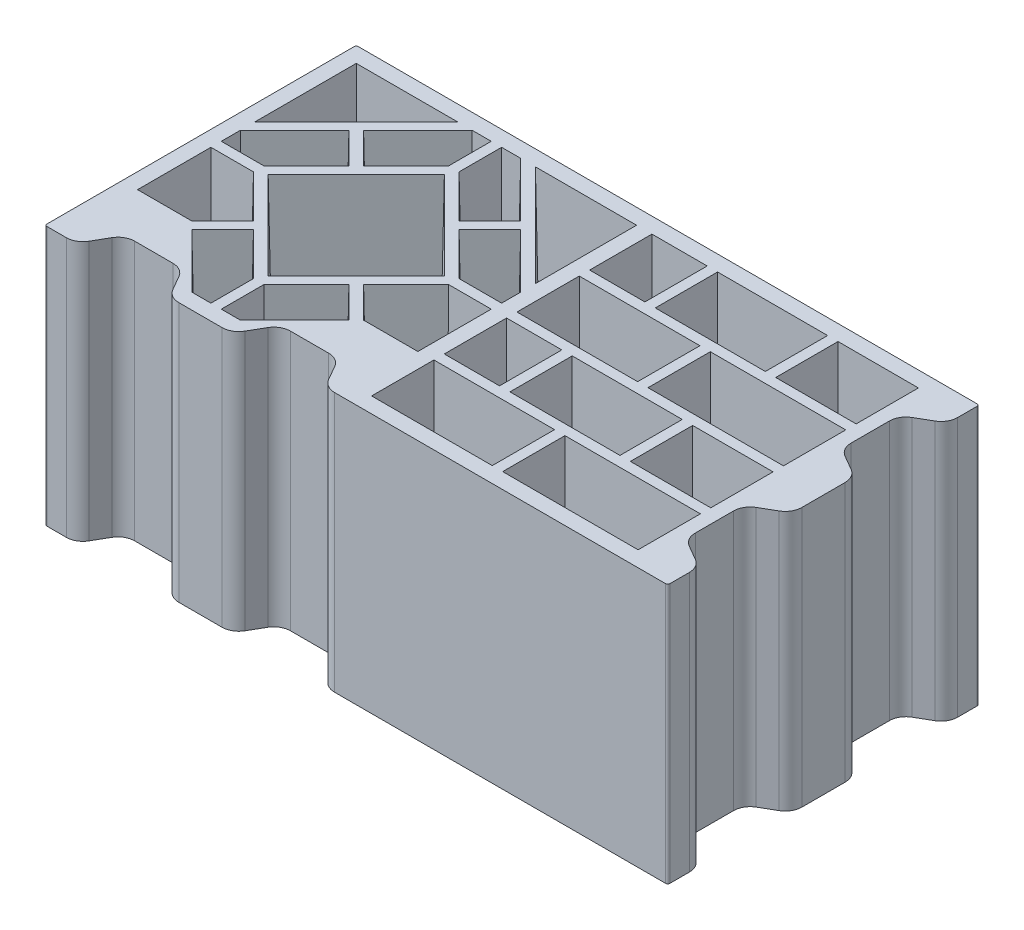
ISO-10303-21;
HEADER;
FILE_DESCRIPTION(('STEP AP214'),'2;1');
FILE_NAME('part.step','',(''),(''),'','','');
FILE_SCHEMA(('AUTOMOTIVE_DESIGN { 1 0 10303 214 1 1 1 1 }'));
ENDSEC;
DATA;
#1=APPLICATION_CONTEXT('core data for automotive mechanical design processes');
#2=APPLICATION_PROTOCOL_DEFINITION('international standard','automotive_design',2000,#1);
#3=PRODUCT_CONTEXT('',#1,'mechanical');
#4=PRODUCT('Part','Part','',(#3));
#5=PRODUCT_RELATED_PRODUCT_CATEGORY('part','',(#4));
#6=PRODUCT_DEFINITION_FORMATION('','',#4);
#7=PRODUCT_DEFINITION_CONTEXT('part definition',#1,'design');
#8=PRODUCT_DEFINITION('design','',#6,#7);
#9=PRODUCT_DEFINITION_SHAPE('','',#8);
#10=(LENGTH_UNIT() NAMED_UNIT(*) SI_UNIT(.MILLI.,.METRE.));
#11=(NAMED_UNIT(*) PLANE_ANGLE_UNIT() SI_UNIT($,.RADIAN.));
#12=(NAMED_UNIT(*) SI_UNIT($,.STERADIAN.) SOLID_ANGLE_UNIT());
#13=UNCERTAINTY_MEASURE_WITH_UNIT(LENGTH_MEASURE(1.E-05),#10,'distance_accuracy_value','');
#14=(GEOMETRIC_REPRESENTATION_CONTEXT(3) GLOBAL_UNCERTAINTY_ASSIGNED_CONTEXT((#13)) GLOBAL_UNIT_ASSIGNED_CONTEXT((#10,
#11,#12)) REPRESENTATION_CONTEXT('',''));
#15=CARTESIAN_POINT('',(0.,0.,0.));
#16=DIRECTION('',(0.,0.,1.));
#17=DIRECTION('',(1.,0.,0.));
#18=AXIS2_PLACEMENT_3D('',#15,#16,#17);
#19=CARTESIAN_POINT('',(58.4,25.,-27.9237604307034));
#20=DIRECTION('',(0.,-1.,0.));
#21=DIRECTION('',(0.,0.,-1.));
#22=AXIS2_PLACEMENT_3D('',#19,#20,#21);
#23=PLANE('',#22);
#24=DIRECTION('',(0.707106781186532,0.,-0.707106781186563));
#25=VECTOR('',#24,1.);
#26=CARTESIAN_POINT('',(17.3391918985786,25.,-1.49999999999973));
#27=LINE('',#26,#25);
#28=CARTESIAN_POINT('',(17.3391918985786,25.,-1.49999999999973));
#29=VERTEX_POINT('',#28);
#30=CARTESIAN_POINT('',(22.5660425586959,25.,-6.72685066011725));
#31=VERTEX_POINT('',#30);
#32=EDGE_CURVE('E1698',#29,#31,#27,.T.);
#33=ORIENTED_EDGE('',*,*,#32,.F.);
#34=DIRECTION('',(1.,0.,0.));
#35=VECTOR('',#34,1.);
#36=CARTESIAN_POINT('',(15.5,25.,-1.49999999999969));
#37=LINE('',#36,#35);
#38=CARTESIAN_POINT('',(15.5,25.,-1.49999999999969));
#39=VERTEX_POINT('',#38);
#40=EDGE_CURVE('E1690',#39,#29,#37,.T.);
#41=ORIENTED_EDGE('',*,*,#40,.F.);
#42=DIRECTION('',(0.,0.,1.));
#43=VECTOR('',#42,1.);
#44=CARTESIAN_POINT('',(15.4999999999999,25.,-5.60050506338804));
#45=LINE('',#44,#43);
#46=CARTESIAN_POINT('',(15.4999999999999,25.,-5.60050506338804));
#47=VERTEX_POINT('',#46);
#48=EDGE_CURVE('E3170',#47,#39,#45,.T.);
#49=ORIENTED_EDGE('',*,*,#48,.F.);
#50=DIRECTION('',(-0.707106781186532,0.,0.707106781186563));
#51=VECTOR('',#50,1.);
#52=CARTESIAN_POINT('',(19.5961940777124,25.,-9.69669914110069));
#53=LINE('',#52,#51);
#54=CARTESIAN_POINT('',(19.5961940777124,25.,-9.69669914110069));
#55=VERTEX_POINT('',#54);
#56=EDGE_CURVE('E3172',#55,#47,#53,.T.);
#57=ORIENTED_EDGE('',*,*,#56,.F.);
#58=DIRECTION('',(-0.707106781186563,0.,-0.707106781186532));
#59=VECTOR('',#58,1.);
#60=CARTESIAN_POINT('',(22.5660425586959,25.,-6.72685066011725));
#61=LINE('',#60,#59);
#62=EDGE_CURVE('E3219',#31,#55,#61,.T.);
#63=ORIENTED_EDGE('',*,*,#62,.F.);
#64=EDGE_LOOP('',(#33,#41,#49,#57,#63));
#65=FACE_BOUND('',#64,.T.);
#66=DIRECTION('',(-0.707106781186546,0.,0.707106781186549));
#67=VECTOR('',#66,1.);
#68=CARTESIAN_POINT('',(20.3033008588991,25.,-10.4038059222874));
#69=LINE('',#68,#67);
#70=CARTESIAN_POINT('',(24.3994949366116,25.,-14.5));
#71=VERTEX_POINT('',#70);
#72=CARTESIAN_POINT('',(20.3033008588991,25.,-10.4038059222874));
#73=VERTEX_POINT('',#72);
#74=EDGE_CURVE('E833',#71,#73,#69,.T.);
#75=ORIENTED_EDGE('',*,*,#74,.F.);
#76=DIRECTION('',(-1.,0.,0.));
#77=VECTOR('',#76,1.);
#78=CARTESIAN_POINT('',(24.3994949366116,25.,-14.5));
#79=LINE('',#78,#77);
#80=CARTESIAN_POINT('',(28.5,25.,-14.5));
#81=VERTEX_POINT('',#80);
#82=EDGE_CURVE('E843',#81,#71,#79,.T.);
#83=ORIENTED_EDGE('',*,*,#82,.F.);
#84=DIRECTION('',(0.,0.,-1.));
#85=VECTOR('',#84,1.);
#86=CARTESIAN_POINT('',(28.5,25.,-14.5));
#87=LINE('',#86,#85);
#88=CARTESIAN_POINT('',(28.5,25.,-7.43395744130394));
#89=VERTEX_POINT('',#88);
#90=EDGE_CURVE('E840',#89,#81,#87,.T.);
#91=ORIENTED_EDGE('',*,*,#90,.F.);
#92=DIRECTION('',(1.,0.,0.));
#93=VECTOR('',#92,1.);
#94=CARTESIAN_POINT('',(23.2731493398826,25.,-7.43395744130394));
#95=LINE('',#94,#93);
#96=CARTESIAN_POINT('',(23.2731493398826,25.,-7.43395744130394));
#97=VERTEX_POINT('',#96);
#98=EDGE_CURVE('E838',#97,#89,#95,.T.);
#99=ORIENTED_EDGE('',*,*,#98,.F.);
#100=DIRECTION('',(0.70710678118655,0.,0.707106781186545));
#101=VECTOR('',#100,1.);
#102=CARTESIAN_POINT('',(23.2731493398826,25.,-7.43395744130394));
#103=LINE('',#102,#101);
#104=EDGE_CURVE('E835',#73,#97,#103,.T.);
#105=ORIENTED_EDGE('',*,*,#104,.F.);
#106=EDGE_LOOP('',(#75,#83,#91,#99,#105));
#107=FACE_BOUND('',#106,.T.);
#108=DIRECTION('',(1.,0.,0.));
#109=VECTOR('',#108,1.);
#110=CARTESIAN_POINT('',(42.6000000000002,25.,-15.5));
#111=LINE('',#110,#109);
#112=CARTESIAN_POINT('',(42.6000000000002,25.,-15.5));
#113=VERTEX_POINT('',#112);
#114=CARTESIAN_POINT('',(55.6451021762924,25.,-15.5));
#115=VERTEX_POINT('',#114);
#116=EDGE_CURVE('E855',#113,#115,#111,.T.);
#117=ORIENTED_EDGE('',*,*,#116,.F.);
#118=DIRECTION('',(0.,0.,1.));
#119=VECTOR('',#118,1.);
#120=CARTESIAN_POINT('',(42.6000000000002,25.,-21.5));
#121=LINE('',#120,#119);
#122=CARTESIAN_POINT('',(42.6000000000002,25.,-21.5));
#123=VERTEX_POINT('',#122);
#124=EDGE_CURVE('E863',#123,#113,#121,.T.);
#125=ORIENTED_EDGE('',*,*,#124,.F.);
#126=DIRECTION('',(-1.,0.,0.));
#127=VECTOR('',#126,1.);
#128=CARTESIAN_POINT('',(42.6000000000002,25.,-21.5));
#129=LINE('',#128,#127);
#130=CARTESIAN_POINT('',(55.6451021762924,25.,-21.5));
#131=VERTEX_POINT('',#130);
#132=EDGE_CURVE('E860',#131,#123,#129,.T.);
#133=ORIENTED_EDGE('',*,*,#132,.F.);
#134=DIRECTION('',(0.,0.,-1.));
#135=VECTOR('',#134,1.);
#136=CARTESIAN_POINT('',(55.6451021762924,25.,-21.5));
#137=LINE('',#136,#135);
#138=EDGE_CURVE('E857',#115,#131,#137,.T.);
#139=ORIENTED_EDGE('',*,*,#138,.F.);
#140=EDGE_LOOP('',(#117,#125,#133,#139));
#141=FACE_BOUND('',#140,.T.);
#142=DIRECTION('',(-0.707106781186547,0.,-0.707106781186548));
#143=VECTOR('',#142,1.);
#144=CARTESIAN_POINT('',(28.5,25.,-17.3391918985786));
#145=LINE('',#144,#143);
#146=CARTESIAN_POINT('',(28.5,25.,-17.3391918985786));
#147=VERTEX_POINT('',#146);
#148=CARTESIAN_POINT('',(23.2731493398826,25.,-22.5660425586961));
#149=VERTEX_POINT('',#148);
#150=EDGE_CURVE('E879',#147,#149,#145,.T.);
#151=ORIENTED_EDGE('',*,*,#150,.F.);
#152=DIRECTION('',(0.,0.,-1.));
#153=VECTOR('',#152,1.);
#154=CARTESIAN_POINT('',(28.5,25.,-15.5));
#155=LINE('',#154,#153);
#156=CARTESIAN_POINT('',(28.5,25.,-15.5));
#157=VERTEX_POINT('',#156);
#158=EDGE_CURVE('E889',#157,#147,#155,.T.);
#159=ORIENTED_EDGE('',*,*,#158,.F.);
#160=DIRECTION('',(1.,0.,0.));
#161=VECTOR('',#160,1.);
#162=CARTESIAN_POINT('',(24.3994949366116,25.,-15.5));
#163=LINE('',#162,#161);
#164=CARTESIAN_POINT('',(24.3994949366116,25.,-15.5));
#165=VERTEX_POINT('',#164);
#166=EDGE_CURVE('E886',#165,#157,#163,.T.);
#167=ORIENTED_EDGE('',*,*,#166,.F.);
#168=DIRECTION('',(0.707106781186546,0.,0.707106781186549));
#169=VECTOR('',#168,1.);
#170=CARTESIAN_POINT('',(20.3033008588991,25.,-19.5961940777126));
#171=LINE('',#170,#169);
#172=CARTESIAN_POINT('',(20.3033008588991,25.,-19.5961940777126));
#173=VERTEX_POINT('',#172);
#174=EDGE_CURVE('E884',#173,#165,#171,.T.);
#175=ORIENTED_EDGE('',*,*,#174,.F.);
#176=DIRECTION('',(-0.70710678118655,0.,0.707106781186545));
#177=VECTOR('',#176,1.);
#178=CARTESIAN_POINT('',(23.2731493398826,25.,-22.5660425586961));
#179=LINE('',#178,#177);
#180=EDGE_CURVE('E881',#149,#173,#179,.T.);
#181=ORIENTED_EDGE('',*,*,#180,.F.);
#182=EDGE_LOOP('',(#151,#159,#167,#175,#181));
#183=FACE_BOUND('',#182,.T.);
#184=DIRECTION('',(-0.707106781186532,0.,0.707106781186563));
#185=VECTOR('',#184,1.);
#186=CARTESIAN_POINT('',(12.6608081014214,25.,-28.5000000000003));
#187=LINE('',#186,#185);
#188=CARTESIAN_POINT('',(12.6608081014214,25.,-28.5000000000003));
#189=VERTEX_POINT('',#188);
#190=CARTESIAN_POINT('',(7.43395744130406,25.,-23.2731493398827));
#191=VERTEX_POINT('',#190);
#192=EDGE_CURVE('E903',#189,#191,#187,.T.);
#193=ORIENTED_EDGE('',*,*,#192,.F.);
#194=DIRECTION('',(-1.,0.,0.));
#195=VECTOR('',#194,1.);
#196=CARTESIAN_POINT('',(14.5,25.,-28.5000000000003));
#197=LINE('',#196,#195);
#198=CARTESIAN_POINT('',(14.5,25.,-28.5000000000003));
#199=VERTEX_POINT('',#198);
#200=EDGE_CURVE('E913',#199,#189,#197,.T.);
#201=ORIENTED_EDGE('',*,*,#200,.F.);
#202=DIRECTION('',(0.,0.,-1.));
#203=VECTOR('',#202,1.);
#204=CARTESIAN_POINT('',(14.5000000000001,25.,-24.399494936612));
#205=LINE('',#204,#203);
#206=CARTESIAN_POINT('',(14.5000000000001,25.,-24.399494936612));
#207=VERTEX_POINT('',#206);
#208=EDGE_CURVE('E910',#207,#199,#205,.T.);
#209=ORIENTED_EDGE('',*,*,#208,.F.);
#210=DIRECTION('',(0.707106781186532,0.,-0.707106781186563));
#211=VECTOR('',#210,1.);
#212=CARTESIAN_POINT('',(10.4038059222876,25.,-20.3033008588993));
#213=LINE('',#212,#211);
#214=CARTESIAN_POINT('',(10.4038059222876,25.,-20.3033008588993));
#215=VERTEX_POINT('',#214);
#216=EDGE_CURVE('E908',#215,#207,#213,.T.);
#217=ORIENTED_EDGE('',*,*,#216,.F.);
#218=DIRECTION('',(0.707106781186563,0.,0.707106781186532));
#219=VECTOR('',#218,1.);
#220=CARTESIAN_POINT('',(7.43395744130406,25.,-23.2731493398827));
#221=LINE('',#220,#219);
#222=EDGE_CURVE('E905',#191,#215,#221,.T.);
#223=ORIENTED_EDGE('',*,*,#222,.F.);
#224=EDGE_LOOP('',(#193,#201,#209,#217,#223));
#225=FACE_BOUND('',#224,.T.);
#226=DIRECTION('',(1.,0.,0.));
#227=VECTOR('',#226,1.);
#228=CARTESIAN_POINT('',(5.60050506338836,25.,-15.5));
#229=LINE('',#228,#227);
#230=CARTESIAN_POINT('',(1.5,25.,-15.5));
#231=VERTEX_POINT('',#230);
#232=CARTESIAN_POINT('',(5.60050506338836,25.,-15.5));
#233=VERTEX_POINT('',#232);
#234=EDGE_CURVE('E927',#231,#233,#229,.T.);
#235=ORIENTED_EDGE('',*,*,#234,.F.);
#236=DIRECTION('',(0.,0.,1.));
#237=VECTOR('',#236,1.);
#238=CARTESIAN_POINT('',(1.5,25.,-15.5));
#239=LINE('',#238,#237);
#240=CARTESIAN_POINT('',(1.5,25.,-17.3391918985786));
#241=VERTEX_POINT('',#240);
#242=EDGE_CURVE('E937',#241,#231,#239,.T.);
#243=ORIENTED_EDGE('',*,*,#242,.F.);
#244=DIRECTION('',(-0.707106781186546,0.,0.707106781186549));
#245=VECTOR('',#244,1.);
#246=CARTESIAN_POINT('',(1.5,25.,-17.3391918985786));
#247=LINE('',#246,#245);
#248=CARTESIAN_POINT('',(6.7268506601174,25.,-22.5660425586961));
#249=VERTEX_POINT('',#248);
#250=EDGE_CURVE('E934',#249,#241,#247,.T.);
#251=ORIENTED_EDGE('',*,*,#250,.F.);
#252=DIRECTION('',(-0.707106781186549,0.,-0.707106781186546));
#253=VECTOR('',#252,1.);
#254=CARTESIAN_POINT('',(6.7268506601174,25.,-22.5660425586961));
#255=LINE('',#254,#253);
#256=CARTESIAN_POINT('',(9.6966991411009,25.,-19.5961940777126));
#257=VERTEX_POINT('',#256);
#258=EDGE_CURVE('E932',#257,#249,#255,.T.);
#259=ORIENTED_EDGE('',*,*,#258,.F.);
#260=DIRECTION('',(0.707106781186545,0.,-0.70710678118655));
#261=VECTOR('',#260,1.);
#262=CARTESIAN_POINT('',(9.6966991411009,25.,-19.5961940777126));
#263=LINE('',#262,#261);
#264=EDGE_CURVE('E929',#233,#257,#263,.T.);
#265=ORIENTED_EDGE('',*,*,#264,.F.);
#266=EDGE_LOOP('',(#235,#243,#251,#259,#265));
#267=FACE_BOUND('',#266,.T.);
#268=DIRECTION('',(-1.,0.,0.));
#269=VECTOR('',#268,1.);
#270=CARTESIAN_POINT('',(55.6451021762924,25.,-28.5));
#271=LINE('',#270,#269);
#272=CARTESIAN_POINT('',(55.6451021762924,25.,-28.5));
#273=VERTEX_POINT('',#272);
#274=CARTESIAN_POINT('',(47.9,25.,-28.5));
#275=VERTEX_POINT('',#274);
#276=EDGE_CURVE('E951',#273,#275,#271,.T.);
#277=ORIENTED_EDGE('',*,*,#276,.F.);
#278=DIRECTION('',(0.,0.,-1.));
#279=VECTOR('',#278,1.);
#280=CARTESIAN_POINT('',(55.6451021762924,25.,-28.5));
#281=LINE('',#280,#279);
#282=CARTESIAN_POINT('',(55.6451021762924,25.,-22.5));
#283=VERTEX_POINT('',#282);
#284=EDGE_CURVE('E959',#283,#273,#281,.T.);
#285=ORIENTED_EDGE('',*,*,#284,.F.);
#286=DIRECTION('',(1.,0.,0.));
#287=VECTOR('',#286,1.);
#288=CARTESIAN_POINT('',(55.6451021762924,25.,-22.5));
#289=LINE('',#288,#287);
#290=CARTESIAN_POINT('',(47.9,25.,-22.5));
#291=VERTEX_POINT('',#290);
#292=EDGE_CURVE('E956',#291,#283,#289,.T.);
#293=ORIENTED_EDGE('',*,*,#292,.F.);
#294=DIRECTION('',(0.,0.,1.));
#295=VECTOR('',#294,1.);
#296=CARTESIAN_POINT('',(47.9,25.,-28.5));
#297=LINE('',#296,#295);
#298=EDGE_CURVE('E953',#275,#291,#297,.T.);
#299=ORIENTED_EDGE('',*,*,#298,.F.);
#300=EDGE_LOOP('',(#277,#285,#293,#299));
#301=FACE_BOUND('',#300,.T.);
#302=DIRECTION('',(-1.,0.,0.));
#303=VECTOR('',#302,1.);
#304=CARTESIAN_POINT('',(1.5,25.,-28.5));
#305=LINE('',#304,#303);
#306=CARTESIAN_POINT('',(11.2460166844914,25.,-28.5));
#307=VERTEX_POINT('',#306);
#308=CARTESIAN_POINT('',(1.5,25.,-28.5));
#309=VERTEX_POINT('',#308);
#310=EDGE_CURVE('E973',#307,#309,#305,.T.);
#311=ORIENTED_EDGE('',*,*,#310,.F.);
#312=DIRECTION('',(0.707085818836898,0.,-0.707127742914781));
#313=VECTOR('',#312,1.);
#314=CARTESIAN_POINT('',(11.2460166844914,25.,-28.5));
#315=LINE('',#314,#313);
#316=CARTESIAN_POINT('',(1.50000000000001,25.,-18.7534054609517));
#317=VERTEX_POINT('',#316);
#318=EDGE_CURVE('E979',#317,#307,#315,.T.);
#319=ORIENTED_EDGE('',*,*,#318,.F.);
#320=DIRECTION('',(0.,0.,1.));
#321=VECTOR('',#320,1.);
#322=CARTESIAN_POINT('',(1.5,25.,-18.7534054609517));
#323=LINE('',#322,#321);
#324=EDGE_CURVE('E975',#309,#317,#323,.T.);
#325=ORIENTED_EDGE('',*,*,#324,.F.);
#326=EDGE_LOOP('',(#311,#319,#325));
#327=FACE_BOUND('',#326,.T.);
#328=DIRECTION('',(0.,0.,1.));
#329=VECTOR('',#328,1.);
#330=CARTESIAN_POINT('',(29.9779356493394,25.,-14.5));
#331=LINE('',#330,#329);
#332=CARTESIAN_POINT('',(29.9779356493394,25.,-14.5));
#333=VERTEX_POINT('',#332);
#334=CARTESIAN_POINT('',(29.9779356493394,25.,-8.5));
#335=VERTEX_POINT('',#334);
#336=EDGE_CURVE('E993',#333,#335,#331,.T.);
#337=ORIENTED_EDGE('',*,*,#336,.F.);
#338=DIRECTION('',(-1.,0.,0.));
#339=VECTOR('',#338,1.);
#340=CARTESIAN_POINT('',(35.3000000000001,25.,-14.5));
#341=LINE('',#340,#339);
#342=CARTESIAN_POINT('',(35.3000000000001,25.,-14.5));
#343=VERTEX_POINT('',#342);
#344=EDGE_CURVE('E1001',#343,#333,#341,.T.);
#345=ORIENTED_EDGE('',*,*,#344,.F.);
#346=DIRECTION('',(0.,0.,-1.));
#347=VECTOR('',#346,1.);
#348=CARTESIAN_POINT('',(35.3000000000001,25.,-14.5));
#349=LINE('',#348,#347);
#350=CARTESIAN_POINT('',(35.3000000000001,25.,-8.5));
#351=VERTEX_POINT('',#350);
#352=EDGE_CURVE('E998',#351,#343,#349,.T.);
#353=ORIENTED_EDGE('',*,*,#352,.F.);
#354=DIRECTION('',(1.,0.,0.));
#355=VECTOR('',#354,1.);
#356=CARTESIAN_POINT('',(29.9779356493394,25.,-8.5));
#357=LINE('',#356,#355);
#358=EDGE_CURVE('E995',#335,#351,#357,.T.);
#359=ORIENTED_EDGE('',*,*,#358,.F.);
#360=EDGE_LOOP('',(#337,#345,#353,#359));
#361=FACE_BOUND('',#360,.T.);
#362=DIRECTION('',(1.,0.,0.));
#363=VECTOR('',#362,1.);
#364=CARTESIAN_POINT('',(55.6451021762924,25.,-1.5));
#365=LINE('',#364,#363);
#366=CARTESIAN_POINT('',(42.6000000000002,25.,-1.49999999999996));
#367=VERTEX_POINT('',#366);
#368=CARTESIAN_POINT('',(55.6451021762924,25.,-1.5));
#369=VERTEX_POINT('',#368);
#370=EDGE_CURVE('E1015',#367,#369,#365,.T.);
#371=ORIENTED_EDGE('',*,*,#370,.F.);
#372=DIRECTION('',(0.,0.,1.));
#373=VECTOR('',#372,1.);
#374=CARTESIAN_POINT('',(42.6000000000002,25.,-7.49999999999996));
#375=LINE('',#374,#373);
#376=CARTESIAN_POINT('',(42.6000000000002,25.,-7.49999999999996));
#377=VERTEX_POINT('',#376);
#378=EDGE_CURVE('E1023',#377,#367,#375,.T.);
#379=ORIENTED_EDGE('',*,*,#378,.F.);
#380=DIRECTION('',(-1.,0.,0.));
#381=VECTOR('',#380,1.);
#382=CARTESIAN_POINT('',(42.6000000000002,25.,-7.49999999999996));
#383=LINE('',#382,#381);
#384=CARTESIAN_POINT('',(55.6451021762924,25.,-7.49999999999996));
#385=VERTEX_POINT('',#384);
#386=EDGE_CURVE('E1020',#385,#377,#383,.T.);
#387=ORIENTED_EDGE('',*,*,#386,.F.);
#388=DIRECTION('',(0.,0.,-1.));
#389=VECTOR('',#388,1.);
#390=CARTESIAN_POINT('',(55.6451021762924,25.,-7.49999999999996));
#391=LINE('',#390,#389);
#392=EDGE_CURVE('E1017',#369,#385,#391,.T.);
#393=ORIENTED_EDGE('',*,*,#392,.F.);
#394=EDGE_LOOP('',(#371,#379,#387,#393));
#395=FACE_BOUND('',#394,.T.);
#396=CARTESIAN_POINT('',(58.4,25.,-27.9237604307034));
#397=DIRECTION('',(0.,1.,0.));
#398=DIRECTION('',(0.,0.,-1.));
#399=AXIS2_PLACEMENT_3D('',#396,#397,#398);
#400=CIRCLE('',#399,1.6);
#401=CARTESIAN_POINT('',(59.2,25.,-26.5381197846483));
#402=VERTEX_POINT('',#401);
#403=CARTESIAN_POINT('',(60.,25.,-27.9237604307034));
#404=VERTEX_POINT('',#403);
#405=EDGE_CURVE('E1119',#402,#404,#400,.T.);
#406=ORIENTED_EDGE('',*,*,#405,.T.);
#407=DIRECTION('',(0.,0.,-1.));
#408=VECTOR('',#407,1.);
#409=CARTESIAN_POINT('',(60.,25.,-29.8));
#410=LINE('',#409,#408);
#411=CARTESIAN_POINT('',(60.,25.,-29.8));
#412=VERTEX_POINT('',#411);
#413=EDGE_CURVE('E1122',#404,#412,#410,.T.);
#414=ORIENTED_EDGE('',*,*,#413,.T.);
#415=CARTESIAN_POINT('',(59.8,25.,-29.8));
#416=DIRECTION('',(0.,1.,0.));
#417=DIRECTION('',(0.,0.,1.));
#418=AXIS2_PLACEMENT_3D('',#415,#416,#417);
#419=CIRCLE('',#418,0.199999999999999);
#420=CARTESIAN_POINT('',(59.8,25.,-30.));
#421=VERTEX_POINT('',#420);
#422=EDGE_CURVE('E1124',#412,#421,#419,.T.);
#423=ORIENTED_EDGE('',*,*,#422,.T.);
#424=DIRECTION('',(-1.,0.,0.));
#425=VECTOR('',#424,1.);
#426=CARTESIAN_POINT('',(0.200000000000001,25.,-30.));
#427=LINE('',#426,#425);
#428=CARTESIAN_POINT('',(0.200000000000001,25.,-30.));
#429=VERTEX_POINT('',#428);
#430=EDGE_CURVE('E1126',#421,#429,#427,.T.);
#431=ORIENTED_EDGE('',*,*,#430,.T.);
#432=CARTESIAN_POINT('',(0.2,25.,-29.8));
#433=DIRECTION('',(0.,1.,0.));
#434=DIRECTION('',(0.,0.,-1.));
#435=AXIS2_PLACEMENT_3D('',#432,#433,#434);
#436=CIRCLE('',#435,0.199999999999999);
#437=CARTESIAN_POINT('',(0.,25.,-29.8));
#438=VERTEX_POINT('',#437);
#439=EDGE_CURVE('E1128',#429,#438,#436,.T.);
#440=ORIENTED_EDGE('',*,*,#439,.T.);
#441=DIRECTION('',(0.,0.,1.));
#442=VECTOR('',#441,1.);
#443=CARTESIAN_POINT('',(0.,25.,-0.200000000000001));
#444=LINE('',#443,#442);
#445=CARTESIAN_POINT('',(0.,25.,-0.200000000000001));
#446=VERTEX_POINT('',#445);
#447=EDGE_CURVE('E1130',#438,#446,#444,.T.);
#448=ORIENTED_EDGE('',*,*,#447,.T.);
#449=CARTESIAN_POINT('',(0.2,25.,-0.2));
#450=DIRECTION('',(0.,1.,0.));
#451=DIRECTION('',(0.,0.,-1.));
#452=AXIS2_PLACEMENT_3D('',#449,#450,#451);
#453=CIRCLE('',#452,0.2);
#454=CARTESIAN_POINT('',(0.200000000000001,25.,0.));
#455=VERTEX_POINT('',#454);
#456=EDGE_CURVE('E1132',#446,#455,#453,.T.);
#457=ORIENTED_EDGE('',*,*,#456,.T.);
#458=DIRECTION('',(1.,0.,0.));
#459=VECTOR('',#458,1.);
#460=CARTESIAN_POINT('',(2.07623956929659,25.,0.));
#461=LINE('',#460,#459);
#462=CARTESIAN_POINT('',(2.07623956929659,25.,0.));
#463=VERTEX_POINT('',#462);
#464=EDGE_CURVE('E1134',#455,#463,#461,.T.);
#465=ORIENTED_EDGE('',*,*,#464,.T.);
#466=CARTESIAN_POINT('',(2.0762395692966,25.,-1.59999999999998));
#467=DIRECTION('',(0.,1.,0.));
#468=DIRECTION('',(0.,0.,1.));
#469=AXIS2_PLACEMENT_3D('',#466,#467,#468);
#470=CIRCLE('',#469,1.59999999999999);
#471=CARTESIAN_POINT('',(3.4618802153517,25.,-0.8));
#472=VERTEX_POINT('',#471);
#473=EDGE_CURVE('E1136',#463,#472,#470,.T.);
#474=ORIENTED_EDGE('',*,*,#473,.T.);
#475=DIRECTION('',(0.5,0.,-0.866025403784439));
#476=VECTOR('',#475,1.);
#477=CARTESIAN_POINT('',(3.4618802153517,25.,-0.799999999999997));
#478=LINE('',#477,#476);
#479=CARTESIAN_POINT('',(4.27017059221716,25.,-2.19999999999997));
#480=VERTEX_POINT('',#479);
#481=EDGE_CURVE('E1138',#472,#480,#478,.T.);
#482=ORIENTED_EDGE('',*,*,#481,.T.);
#483=CARTESIAN_POINT('',(5.65581123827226,25.,-1.39999999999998));
#484=DIRECTION('',(0.,-1.,0.));
#485=DIRECTION('',(0.,0.,-1.));
#486=AXIS2_PLACEMENT_3D('',#483,#484,#485);
#487=CIRCLE('',#486,1.59999999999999);
#488=CARTESIAN_POINT('',(5.65581123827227,25.,-2.99999999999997));
#489=VERTEX_POINT('',#488);
#490=EDGE_CURVE('E1140',#480,#489,#487,.T.);
#491=ORIENTED_EDGE('',*,*,#490,.T.);
#492=DIRECTION('',(1.,0.,0.));
#493=VECTOR('',#492,1.);
#494=CARTESIAN_POINT('',(5.65581123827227,25.,-2.99999999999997));
#495=LINE('',#494,#493);
#496=CARTESIAN_POINT('',(9.33962140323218,25.,-2.99999999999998));
#497=VERTEX_POINT('',#496);
#498=EDGE_CURVE('E1142',#489,#497,#495,.T.);
#499=ORIENTED_EDGE('',*,*,#498,.T.);
#500=CARTESIAN_POINT('',(9.33962140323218,25.,-1.39999999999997));
#501=DIRECTION('',(0.,-1.,0.));
#502=DIRECTION('',(0.,0.,-1.));
#503=AXIS2_PLACEMENT_3D('',#500,#501,#502);
#504=CIRCLE('',#503,1.6);
#505=CARTESIAN_POINT('',(10.7240164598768,25.,-2.20215355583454));
#506=VERTEX_POINT('',#505);
#507=EDGE_CURVE('E1144',#497,#506,#504,.T.);
#508=ORIENTED_EDGE('',*,*,#507,.T.);
#509=DIRECTION('',(0.501345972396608,0.,0.865246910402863));
#510=VECTOR('',#509,1.);
#511=CARTESIAN_POINT('',(10.7240164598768,25.,-2.20215355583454));
#512=LINE('',#511,#510);
#513=CARTESIAN_POINT('',(11.5377075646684,25.,-0.797846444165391));
#514=VERTEX_POINT('',#513);
#515=EDGE_CURVE('E1146',#506,#514,#512,.T.);
#516=ORIENTED_EDGE('',*,*,#515,.T.);
#517=CARTESIAN_POINT('',(12.922102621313,25.,-1.59999999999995));
#518=DIRECTION('',(0.,1.,0.));
#519=DIRECTION('',(0.,0.,1.));
#520=AXIS2_PLACEMENT_3D('',#517,#518,#519);
#521=CIRCLE('',#520,1.6);
#522=CARTESIAN_POINT('',(12.922102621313,25.,0.));
#523=VERTEX_POINT('',#522);
#524=EDGE_CURVE('E1148',#514,#523,#521,.T.);
#525=ORIENTED_EDGE('',*,*,#524,.T.);
#526=DIRECTION('',(1.,0.,0.));
#527=VECTOR('',#526,1.);
#528=CARTESIAN_POINT('',(12.922102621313,25.,0.));
#529=LINE('',#528,#527);
#530=CARTESIAN_POINT('',(17.077897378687,25.,0.));
#531=VERTEX_POINT('',#530);
#532=EDGE_CURVE('E1150',#523,#531,#529,.T.);
#533=ORIENTED_EDGE('',*,*,#532,.T.);
#534=CARTESIAN_POINT('',(17.077897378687,25.,-1.59999999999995));
#535=DIRECTION('',(0.,1.,0.));
#536=DIRECTION('',(0.,0.,-1.));
#537=AXIS2_PLACEMENT_3D('',#534,#535,#536);
#538=CIRCLE('',#537,1.6);
#539=CARTESIAN_POINT('',(18.4622924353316,25.,-0.797846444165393));
#540=VERTEX_POINT('',#539);
#541=EDGE_CURVE('E1152',#531,#540,#538,.T.);
#542=ORIENTED_EDGE('',*,*,#541,.T.);
#543=DIRECTION('',(0.501345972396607,0.,-0.865246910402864));
#544=VECTOR('',#543,1.);
#545=CARTESIAN_POINT('',(19.2759835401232,25.,-2.20215355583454));
#546=LINE('',#545,#544);
#547=CARTESIAN_POINT('',(19.2759835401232,25.,-2.20215355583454));
#548=VERTEX_POINT('',#547);
#549=EDGE_CURVE('E1154',#540,#548,#546,.T.);
#550=ORIENTED_EDGE('',*,*,#549,.T.);
#551=CARTESIAN_POINT('',(20.6603785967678,25.,-1.39999999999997));
#552=DIRECTION('',(0.,-1.,0.));
#553=DIRECTION('',(0.,0.,1.));
#554=AXIS2_PLACEMENT_3D('',#551,#552,#553);
#555=CIRCLE('',#554,1.6);
#556=CARTESIAN_POINT('',(20.6603785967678,25.,-2.99999999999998));
#557=VERTEX_POINT('',#556);
#558=EDGE_CURVE('E1156',#548,#557,#555,.T.);
#559=ORIENTED_EDGE('',*,*,#558,.T.);
#560=DIRECTION('',(1.,0.,0.));
#561=VECTOR('',#560,1.);
#562=CARTESIAN_POINT('',(24.3441887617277,25.,-2.99999999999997));
#563=LINE('',#562,#561);
#564=CARTESIAN_POINT('',(24.3441887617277,25.,-2.99999999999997));
#565=VERTEX_POINT('',#564);
#566=EDGE_CURVE('E1158',#557,#565,#563,.T.);
#567=ORIENTED_EDGE('',*,*,#566,.T.);
#568=CARTESIAN_POINT('',(24.3441887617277,25.,-1.39999999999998));
#569=DIRECTION('',(0.,-1.,0.));
#570=DIRECTION('',(0.,0.,1.));
#571=AXIS2_PLACEMENT_3D('',#568,#569,#570);
#572=CIRCLE('',#571,1.59999999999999);
#573=CARTESIAN_POINT('',(25.7298294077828,25.,-2.19999999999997));
#574=VERTEX_POINT('',#573);
#575=EDGE_CURVE('E1160',#565,#574,#572,.T.);
#576=ORIENTED_EDGE('',*,*,#575,.T.);
#577=DIRECTION('',(0.499999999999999,0.,0.866025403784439));
#578=VECTOR('',#577,1.);
#579=CARTESIAN_POINT('',(26.5381197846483,25.,-0.8));
#580=LINE('',#579,#578);
#581=CARTESIAN_POINT('',(26.5381197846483,25.,-0.8));
#582=VERTEX_POINT('',#581);
#583=EDGE_CURVE('E1162',#574,#582,#580,.T.);
#584=ORIENTED_EDGE('',*,*,#583,.T.);
#585=CARTESIAN_POINT('',(27.9237604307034,25.,-1.59999999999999));
#586=DIRECTION('',(0.,1.,0.));
#587=DIRECTION('',(0.,0.,-1.));
#588=AXIS2_PLACEMENT_3D('',#585,#586,#587);
#589=CIRCLE('',#588,1.59999999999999);
#590=CARTESIAN_POINT('',(27.9237604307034,25.,0.));
#591=VERTEX_POINT('',#590);
#592=EDGE_CURVE('E1164',#582,#591,#589,.T.);
#593=ORIENTED_EDGE('',*,*,#592,.T.);
#594=DIRECTION('',(1.,0.,0.));
#595=VECTOR('',#594,1.);
#596=CARTESIAN_POINT('',(27.9237604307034,25.,0.));
#597=LINE('',#596,#595);
#598=CARTESIAN_POINT('',(59.8,25.,0.));
#599=VERTEX_POINT('',#598);
#600=EDGE_CURVE('E1166',#591,#599,#597,.T.);
#601=ORIENTED_EDGE('',*,*,#600,.T.);
#602=CARTESIAN_POINT('',(59.8,25.,-0.2));
#603=DIRECTION('',(0.,1.,0.));
#604=DIRECTION('',(0.,0.,-1.));
#605=AXIS2_PLACEMENT_3D('',#602,#603,#604);
#606=CIRCLE('',#605,0.199999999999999);
#607=CARTESIAN_POINT('',(60.,25.,-0.200000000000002));
#608=VERTEX_POINT('',#607);
#609=EDGE_CURVE('E1168',#599,#608,#606,.T.);
#610=ORIENTED_EDGE('',*,*,#609,.T.);
#611=DIRECTION('',(0.,0.,-1.));
#612=VECTOR('',#611,1.);
#613=CARTESIAN_POINT('',(60.,25.,-0.200000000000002));
#614=LINE('',#613,#612);
#615=CARTESIAN_POINT('',(60.,25.,-2.07623956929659));
#616=VERTEX_POINT('',#615);
#617=EDGE_CURVE('E1170',#608,#616,#614,.T.);
#618=ORIENTED_EDGE('',*,*,#617,.T.);
#619=CARTESIAN_POINT('',(58.4,25.,-2.07623956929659));
#620=DIRECTION('',(0.,1.,0.));
#621=DIRECTION('',(0.,0.,1.));
#622=AXIS2_PLACEMENT_3D('',#619,#620,#621);
#623=CIRCLE('',#622,1.6);
#624=CARTESIAN_POINT('',(59.2,25.,-3.4618802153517));
#625=VERTEX_POINT('',#624);
#626=EDGE_CURVE('E1172',#616,#625,#623,.T.);
#627=ORIENTED_EDGE('',*,*,#626,.T.);
#628=DIRECTION('',(-0.866025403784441,0.,-0.499999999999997));
#629=VECTOR('',#628,1.);
#630=CARTESIAN_POINT('',(59.2,25.,-3.4618802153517));
#631=LINE('',#630,#629);
#632=CARTESIAN_POINT('',(57.8,25.,-4.27017059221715));
#633=VERTEX_POINT('',#632);
#634=EDGE_CURVE('E1174',#625,#633,#631,.T.);
#635=ORIENTED_EDGE('',*,*,#634,.T.);
#636=CARTESIAN_POINT('',(58.6,25.,-5.65581123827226));
#637=DIRECTION('',(0.,-1.,0.));
#638=DIRECTION('',(0.,0.,-1.));
#639=AXIS2_PLACEMENT_3D('',#636,#637,#638);
#640=CIRCLE('',#639,1.59999999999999);
#641=CARTESIAN_POINT('',(57.,25.,-5.65581123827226));
#642=VERTEX_POINT('',#641);
#643=EDGE_CURVE('E1176',#633,#642,#640,.T.);
#644=ORIENTED_EDGE('',*,*,#643,.T.);
#645=DIRECTION('',(0.,0.,-1.));
#646=VECTOR('',#645,1.);
#647=CARTESIAN_POINT('',(57.,25.,-5.65581123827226));
#648=LINE('',#647,#646);
#649=CARTESIAN_POINT('',(57.,25.,-9.33962140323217));
#650=VERTEX_POINT('',#649);
#651=EDGE_CURVE('E1178',#642,#650,#648,.T.);
#652=ORIENTED_EDGE('',*,*,#651,.T.);
#653=CARTESIAN_POINT('',(58.6,25.,-9.33962140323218));
#654=DIRECTION('',(0.,-1.,0.));
#655=DIRECTION('',(0.,0.,-1.));
#656=AXIS2_PLACEMENT_3D('',#653,#654,#655);
#657=CIRCLE('',#656,1.6);
#658=CARTESIAN_POINT('',(57.7978464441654,25.,-10.7240164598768));
#659=VERTEX_POINT('',#658);
#660=EDGE_CURVE('E1180',#650,#659,#657,.T.);
#661=ORIENTED_EDGE('',*,*,#660,.T.);
#662=DIRECTION('',(0.865246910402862,0.,-0.50134597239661));
#663=VECTOR('',#662,1.);
#664=CARTESIAN_POINT('',(57.7978464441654,25.,-10.7240164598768));
#665=LINE('',#664,#663);
#666=CARTESIAN_POINT('',(59.2021535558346,25.,-11.5377075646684));
#667=VERTEX_POINT('',#666);
#668=EDGE_CURVE('E1182',#659,#667,#665,.T.);
#669=ORIENTED_EDGE('',*,*,#668,.T.);
#670=CARTESIAN_POINT('',(58.4,25.,-12.922102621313));
#671=DIRECTION('',(0.,1.,0.));
#672=DIRECTION('',(0.,0.,1.));
#673=AXIS2_PLACEMENT_3D('',#670,#671,#672);
#674=CIRCLE('',#673,1.6);
#675=CARTESIAN_POINT('',(60.,25.,-12.922102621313));
#676=VERTEX_POINT('',#675);
#677=EDGE_CURVE('E1184',#667,#676,#674,.T.);
#678=ORIENTED_EDGE('',*,*,#677,.T.);
#679=DIRECTION('',(0.,0.,-1.));
#680=VECTOR('',#679,1.);
#681=CARTESIAN_POINT('',(60.,25.,-17.077897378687));
#682=LINE('',#681,#680);
#683=CARTESIAN_POINT('',(60.,25.,-17.077897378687));
#684=VERTEX_POINT('',#683);
#685=EDGE_CURVE('E1186',#676,#684,#682,.T.);
#686=ORIENTED_EDGE('',*,*,#685,.T.);
#687=CARTESIAN_POINT('',(58.4,25.,-17.077897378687));
#688=DIRECTION('',(0.,1.,0.));
#689=DIRECTION('',(0.,0.,-1.));
#690=AXIS2_PLACEMENT_3D('',#687,#688,#689);
#691=CIRCLE('',#690,1.6);
#692=CARTESIAN_POINT('',(59.2021535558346,25.,-18.4622924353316));
#693=VERTEX_POINT('',#692);
#694=EDGE_CURVE('E1188',#684,#693,#691,.T.);
#695=ORIENTED_EDGE('',*,*,#694,.T.);
#696=DIRECTION('',(-0.865246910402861,0.,-0.501345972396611));
#697=VECTOR('',#696,1.);
#698=CARTESIAN_POINT('',(57.7978464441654,25.,-19.2759835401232));
#699=LINE('',#698,#697);
#700=CARTESIAN_POINT('',(57.7978464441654,25.,-19.2759835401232));
#701=VERTEX_POINT('',#700);
#702=EDGE_CURVE('E1190',#693,#701,#699,.T.);
#703=ORIENTED_EDGE('',*,*,#702,.T.);
#704=CARTESIAN_POINT('',(58.6,25.,-20.6603785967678));
#705=DIRECTION('',(0.,-1.,0.));
#706=DIRECTION('',(0.,0.,1.));
#707=AXIS2_PLACEMENT_3D('',#704,#705,#706);
#708=CIRCLE('',#707,1.6);
#709=CARTESIAN_POINT('',(57.,25.,-20.6603785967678));
#710=VERTEX_POINT('',#709);
#711=EDGE_CURVE('E1192',#701,#710,#708,.T.);
#712=ORIENTED_EDGE('',*,*,#711,.T.);
#713=DIRECTION('',(0.,0.,-1.));
#714=VECTOR('',#713,1.);
#715=CARTESIAN_POINT('',(57.,25.,-24.3441887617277));
#716=LINE('',#715,#714);
#717=CARTESIAN_POINT('',(57.,25.,-24.3441887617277));
#718=VERTEX_POINT('',#717);
#719=EDGE_CURVE('E1194',#710,#718,#716,.T.);
#720=ORIENTED_EDGE('',*,*,#719,.T.);
#721=CARTESIAN_POINT('',(58.6,25.,-24.3441887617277));
#722=DIRECTION('',(0.,-1.,0.));
#723=DIRECTION('',(0.,0.,1.));
#724=AXIS2_PLACEMENT_3D('',#721,#722,#723);
#725=CIRCLE('',#724,1.6);
#726=CARTESIAN_POINT('',(57.8,25.,-25.7298294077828));
#727=VERTEX_POINT('',#726);
#728=EDGE_CURVE('E1196',#718,#727,#725,.T.);
#729=ORIENTED_EDGE('',*,*,#728,.T.);
#730=DIRECTION('',(0.866025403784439,0.,-0.5));
#731=VECTOR('',#730,1.);
#732=CARTESIAN_POINT('',(59.2,25.,-26.5381197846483));
#733=LINE('',#732,#731);
#734=EDGE_CURVE('E1198',#727,#402,#733,.T.);
#735=ORIENTED_EDGE('',*,*,#734,.T.);
#736=EDGE_LOOP('',(#406,#414,#423,#431,#440,#448,#457,#465,#474,#482,#491,#499,#508,#516,#525,
#533,#542,#550,#559,#567,#576,#584,#593,#601,#610,#618,#627,#635,#644,#652,#661,#669,#678,#686,
#695,#703,#712,#720,#729,#735));
#737=FACE_BOUND('',#736,.T.);
#738=DIRECTION('',(1.,0.,0.));
#739=VECTOR('',#738,1.);
#740=CARTESIAN_POINT('',(55.6451021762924,25.,-8.5));
#741=LINE('',#740,#739);
#742=CARTESIAN_POINT('',(47.9000000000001,25.,-8.5));
#743=VERTEX_POINT('',#742);
#744=CARTESIAN_POINT('',(55.6451021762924,25.,-8.5));
#745=VERTEX_POINT('',#744);
#746=EDGE_CURVE('E1026',#743,#745,#741,.T.);
#747=ORIENTED_EDGE('',*,*,#746,.F.);
#748=DIRECTION('',(0.,0.,1.));
#749=VECTOR('',#748,1.);
#750=CARTESIAN_POINT('',(47.9000000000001,25.,-14.5));
#751=LINE('',#750,#749);
#752=CARTESIAN_POINT('',(47.9000000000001,25.,-14.5));
#753=VERTEX_POINT('',#752);
#754=EDGE_CURVE('E1034',#753,#743,#751,.T.);
#755=ORIENTED_EDGE('',*,*,#754,.F.);
#756=DIRECTION('',(-1.,0.,0.));
#757=VECTOR('',#756,1.);
#758=CARTESIAN_POINT('',(55.6451021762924,25.,-14.5));
#759=LINE('',#758,#757);
#760=CARTESIAN_POINT('',(55.6451021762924,25.,-14.5));
#761=VERTEX_POINT('',#760);
#762=EDGE_CURVE('E1031',#761,#753,#759,.T.);
#763=ORIENTED_EDGE('',*,*,#762,.F.);
#764=DIRECTION('',(0.,0.,-1.));
#765=VECTOR('',#764,1.);
#766=CARTESIAN_POINT('',(55.6451021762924,25.,-14.5));
#767=LINE('',#766,#765);
#768=EDGE_CURVE('E1028',#745,#761,#767,.T.);
#769=ORIENTED_EDGE('',*,*,#768,.F.);
#770=EDGE_LOOP('',(#747,#755,#763,#769));
#771=FACE_BOUND('',#770,.T.);
#772=DIRECTION('',(1.,0.,0.));
#773=VECTOR('',#772,1.);
#774=CARTESIAN_POINT('',(29.9779356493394,25.,-22.5));
#775=LINE('',#774,#773);
#776=CARTESIAN_POINT('',(29.9779356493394,25.,-22.5));
#777=VERTEX_POINT('',#776);
#778=CARTESIAN_POINT('',(35.3,25.,-22.5));
#779=VERTEX_POINT('',#778);
#780=EDGE_CURVE('E1004',#777,#779,#775,.T.);
#781=ORIENTED_EDGE('',*,*,#780,.F.);
#782=DIRECTION('',(0.,0.,1.));
#783=VECTOR('',#782,1.);
#784=CARTESIAN_POINT('',(29.9779356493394,25.,-28.5));
#785=LINE('',#784,#783);
#786=CARTESIAN_POINT('',(29.9779356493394,25.,-28.5));
#787=VERTEX_POINT('',#786);
#788=EDGE_CURVE('E1012',#787,#777,#785,.T.);
#789=ORIENTED_EDGE('',*,*,#788,.F.);
#790=DIRECTION('',(-1.,0.,0.));
#791=VECTOR('',#790,1.);
#792=CARTESIAN_POINT('',(35.3,25.,-28.5));
#793=LINE('',#792,#791);
#794=CARTESIAN_POINT('',(35.3,25.,-28.5));
#795=VERTEX_POINT('',#794);
#796=EDGE_CURVE('E1009',#795,#787,#793,.T.);
#797=ORIENTED_EDGE('',*,*,#796,.F.);
#798=DIRECTION('',(0.,0.,-1.));
#799=VECTOR('',#798,1.);
#800=CARTESIAN_POINT('',(35.3,25.,-28.5));
#801=LINE('',#800,#799);
#802=EDGE_CURVE('E1006',#779,#795,#801,.T.);
#803=ORIENTED_EDGE('',*,*,#802,.F.);
#804=EDGE_LOOP('',(#781,#789,#797,#803));
#805=FACE_BOUND('',#804,.T.);
#806=DIRECTION('',(1.,0.,0.));
#807=VECTOR('',#806,1.);
#808=CARTESIAN_POINT('',(29.9779356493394,25.,-15.5));
#809=LINE('',#808,#807);
#810=CARTESIAN_POINT('',(29.9779356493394,25.,-15.5));
#811=VERTEX_POINT('',#810);
#812=CARTESIAN_POINT('',(41.6000000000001,25.,-15.5));
#813=VERTEX_POINT('',#812);
#814=EDGE_CURVE('E982',#811,#813,#809,.T.);
#815=ORIENTED_EDGE('',*,*,#814,.F.);
#816=DIRECTION('',(0.,0.,1.));
#817=VECTOR('',#816,1.);
#818=CARTESIAN_POINT('',(29.9779356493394,25.,-21.5));
#819=LINE('',#818,#817);
#820=CARTESIAN_POINT('',(29.9779356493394,25.,-21.5));
#821=VERTEX_POINT('',#820);
#822=EDGE_CURVE('E990',#821,#811,#819,.T.);
#823=ORIENTED_EDGE('',*,*,#822,.F.);
#824=DIRECTION('',(-1.,0.,0.));
#825=VECTOR('',#824,1.);
#826=CARTESIAN_POINT('',(41.6000000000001,25.,-21.5));
#827=LINE('',#826,#825);
#828=CARTESIAN_POINT('',(41.6000000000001,25.,-21.5));
#829=VERTEX_POINT('',#828);
#830=EDGE_CURVE('E987',#829,#821,#827,.T.);
#831=ORIENTED_EDGE('',*,*,#830,.F.);
#832=DIRECTION('',(0.,0.,-1.));
#833=VECTOR('',#832,1.);
#834=CARTESIAN_POINT('',(41.6000000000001,25.,-21.5));
#835=LINE('',#834,#833);
#836=EDGE_CURVE('E984',#813,#829,#835,.T.);
#837=ORIENTED_EDGE('',*,*,#836,.F.);
#838=EDGE_LOOP('',(#815,#823,#831,#837));
#839=FACE_BOUND('',#838,.T.);
#840=DIRECTION('',(-1.,0.,0.));
#841=VECTOR('',#840,1.);
#842=CARTESIAN_POINT('',(36.3,25.,-28.5));
#843=LINE('',#842,#841);
#844=CARTESIAN_POINT('',(46.9,25.,-28.5));
#845=VERTEX_POINT('',#844);
#846=CARTESIAN_POINT('',(36.3,25.,-28.5));
#847=VERTEX_POINT('',#846);
#848=EDGE_CURVE('E962',#845,#847,#843,.T.);
#849=ORIENTED_EDGE('',*,*,#848,.F.);
#850=DIRECTION('',(0.,0.,-1.));
#851=VECTOR('',#850,1.);
#852=CARTESIAN_POINT('',(46.9,25.,-28.5));
#853=LINE('',#852,#851);
#854=CARTESIAN_POINT('',(46.9,25.,-22.5));
#855=VERTEX_POINT('',#854);
#856=EDGE_CURVE('E970',#855,#845,#853,.T.);
#857=ORIENTED_EDGE('',*,*,#856,.F.);
#858=DIRECTION('',(1.,0.,0.));
#859=VECTOR('',#858,1.);
#860=CARTESIAN_POINT('',(36.3,25.,-22.5));
#861=LINE('',#860,#859);
#862=CARTESIAN_POINT('',(36.3,25.,-22.5));
#863=VERTEX_POINT('',#862);
#864=EDGE_CURVE('E967',#863,#855,#861,.T.);
#865=ORIENTED_EDGE('',*,*,#864,.F.);
#866=DIRECTION('',(0.,0.,1.));
#867=VECTOR('',#866,1.);
#868=CARTESIAN_POINT('',(36.3,25.,-28.5));
#869=LINE('',#868,#867);
#870=EDGE_CURVE('E964',#847,#863,#869,.T.);
#871=ORIENTED_EDGE('',*,*,#870,.F.);
#872=EDGE_LOOP('',(#849,#857,#865,#871));
#873=FACE_BOUND('',#872,.T.);
#874=DIRECTION('',(-1.,0.,0.));
#875=VECTOR('',#874,1.);
#876=CARTESIAN_POINT('',(29.9779356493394,25.,-7.49999999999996));
#877=LINE('',#876,#875);
#878=CARTESIAN_POINT('',(41.6000000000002,25.,-7.49999999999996));
#879=VERTEX_POINT('',#878);
#880=CARTESIAN_POINT('',(29.9779356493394,25.,-7.49999999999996));
#881=VERTEX_POINT('',#880);
#882=EDGE_CURVE('E940',#879,#881,#877,.T.);
#883=ORIENTED_EDGE('',*,*,#882,.F.);
#884=DIRECTION('',(0.,0.,-1.));
#885=VECTOR('',#884,1.);
#886=CARTESIAN_POINT('',(41.6000000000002,25.,-7.49999999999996));
#887=LINE('',#886,#885);
#888=CARTESIAN_POINT('',(41.6000000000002,25.,-1.49999999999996));
#889=VERTEX_POINT('',#888);
#890=EDGE_CURVE('E948',#889,#879,#887,.T.);
#891=ORIENTED_EDGE('',*,*,#890,.F.);
#892=DIRECTION('',(1.,0.,0.));
#893=VECTOR('',#892,1.);
#894=CARTESIAN_POINT('',(29.9779356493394,25.,-1.49999999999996));
#895=LINE('',#894,#893);
#896=CARTESIAN_POINT('',(29.9779356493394,25.,-1.49999999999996));
#897=VERTEX_POINT('',#896);
#898=EDGE_CURVE('E945',#897,#889,#895,.T.);
#899=ORIENTED_EDGE('',*,*,#898,.F.);
#900=DIRECTION('',(0.,0.,1.));
#901=VECTOR('',#900,1.);
#902=CARTESIAN_POINT('',(29.9779356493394,25.,-7.49999999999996));
#903=LINE('',#902,#901);
#904=EDGE_CURVE('E942',#881,#897,#903,.T.);
#905=ORIENTED_EDGE('',*,*,#904,.F.);
#906=EDGE_LOOP('',(#883,#891,#899,#905));
#907=FACE_BOUND('',#906,.T.);
#908=DIRECTION('',(-1.,0.,0.));
#909=VECTOR('',#908,1.);
#910=CARTESIAN_POINT('',(36.3000000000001,25.,-14.5));
#911=LINE('',#910,#909);
#912=CARTESIAN_POINT('',(46.9000000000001,25.,-14.5));
#913=VERTEX_POINT('',#912);
#914=CARTESIAN_POINT('',(36.3000000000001,25.,-14.5));
#915=VERTEX_POINT('',#914);
#916=EDGE_CURVE('E916',#913,#915,#911,.T.);
#917=ORIENTED_EDGE('',*,*,#916,.F.);
#918=DIRECTION('',(0.,0.,-1.));
#919=VECTOR('',#918,1.);
#920=CARTESIAN_POINT('',(46.9000000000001,25.,-14.5));
#921=LINE('',#920,#919);
#922=CARTESIAN_POINT('',(46.9,25.,-8.50000000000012));
#923=VERTEX_POINT('',#922);
#924=EDGE_CURVE('E924',#923,#913,#921,.T.);
#925=ORIENTED_EDGE('',*,*,#924,.F.);
#926=DIRECTION('',(1.,0.,0.));
#927=VECTOR('',#926,1.);
#928=CARTESIAN_POINT('',(36.3000000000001,25.,-8.5));
#929=LINE('',#928,#927);
#930=CARTESIAN_POINT('',(36.3000000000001,25.,-8.5));
#931=VERTEX_POINT('',#930);
#932=EDGE_CURVE('E921',#931,#923,#929,.T.);
#933=ORIENTED_EDGE('',*,*,#932,.F.);
#934=DIRECTION('',(0.,0.,1.));
#935=VECTOR('',#934,1.);
#936=CARTESIAN_POINT('',(36.3000000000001,25.,-14.5));
#937=LINE('',#936,#935);
#938=EDGE_CURVE('E918',#915,#931,#937,.T.);
#939=ORIENTED_EDGE('',*,*,#938,.F.);
#940=EDGE_LOOP('',(#917,#925,#933,#939));
#941=FACE_BOUND('',#940,.T.);
#942=DIRECTION('',(0.707106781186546,0.,0.707106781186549));
#943=VECTOR('',#942,1.);
#944=CARTESIAN_POINT('',(6.51471862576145,25.,-15.));
#945=LINE('',#944,#943);
#946=CARTESIAN_POINT('',(6.51471862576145,25.,-15.));
#947=VERTEX_POINT('',#946);
#948=CARTESIAN_POINT('',(15.,25.,-6.51471862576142));
#949=VERTEX_POINT('',#948);
#950=EDGE_CURVE('E892',#947,#949,#945,.T.);
#951=ORIENTED_EDGE('',*,*,#950,.F.);
#952=DIRECTION('',(-0.707106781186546,0.,0.707106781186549));
#953=VECTOR('',#952,1.);
#954=CARTESIAN_POINT('',(6.51471862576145,25.,-15.));
#955=LINE('',#954,#953);
#956=CARTESIAN_POINT('',(15.,25.,-23.4852813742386));
#957=VERTEX_POINT('',#956);
#958=EDGE_CURVE('E900',#957,#947,#955,.T.);
#959=ORIENTED_EDGE('',*,*,#958,.F.);
#960=DIRECTION('',(-0.707106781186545,0.,-0.70710678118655));
#961=VECTOR('',#960,1.);
#962=CARTESIAN_POINT('',(15.,25.,-23.4852813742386));
#963=LINE('',#962,#961);
#964=CARTESIAN_POINT('',(23.4852813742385,25.,-15.));
#965=VERTEX_POINT('',#964);
#966=EDGE_CURVE('E897',#965,#957,#963,.T.);
#967=ORIENTED_EDGE('',*,*,#966,.F.);
#968=DIRECTION('',(0.707106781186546,0.,-0.707106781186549));
#969=VECTOR('',#968,1.);
#970=CARTESIAN_POINT('',(15.,25.,-6.51471862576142));
#971=LINE('',#970,#969);
#972=EDGE_CURVE('E894',#949,#965,#971,.T.);
#973=ORIENTED_EDGE('',*,*,#972,.F.);
#974=EDGE_LOOP('',(#951,#959,#967,#973));
#975=FACE_BOUND('',#974,.T.);
#976=DIRECTION('',(0.707106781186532,0.,0.707106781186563));
#977=VECTOR('',#976,1.);
#978=CARTESIAN_POINT('',(19.5961940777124,25.,-20.3033008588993));
#979=LINE('',#978,#977);
#980=CARTESIAN_POINT('',(15.4999999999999,25.,-24.399494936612));
#981=VERTEX_POINT('',#980);
#982=CARTESIAN_POINT('',(19.5961940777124,25.,-20.3033008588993));
#983=VERTEX_POINT('',#982);
#984=EDGE_CURVE('E866',#981,#983,#979,.T.);
#985=ORIENTED_EDGE('',*,*,#984,.F.);
#986=DIRECTION('',(0.,0.,1.));
#987=VECTOR('',#986,1.);
#988=CARTESIAN_POINT('',(15.4999999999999,25.,-24.399494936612));
#989=LINE('',#988,#987);
#990=CARTESIAN_POINT('',(15.5,25.,-28.5000000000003));
#991=VERTEX_POINT('',#990);
#992=EDGE_CURVE('E876',#991,#981,#989,.T.);
#993=ORIENTED_EDGE('',*,*,#992,.F.);
#994=DIRECTION('',(-1.,0.,0.));
#995=VECTOR('',#994,1.);
#996=CARTESIAN_POINT('',(15.5,25.,-28.5000000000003));
#997=LINE('',#996,#995);
#998=CARTESIAN_POINT('',(17.3391918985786,25.,-28.5000000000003));
#999=VERTEX_POINT('',#998);
#1000=EDGE_CURVE('E873',#999,#991,#997,.T.);
#1001=ORIENTED_EDGE('',*,*,#1000,.F.);
#1002=DIRECTION('',(-0.707106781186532,0.,-0.707106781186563));
#1003=VECTOR('',#1002,1.);
#1004=CARTESIAN_POINT('',(17.3391918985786,25.,-28.5000000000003));
#1005=LINE('',#1004,#1003);
#1006=CARTESIAN_POINT('',(22.5660425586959,25.,-23.2731493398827));
#1007=VERTEX_POINT('',#1006);
#1008=EDGE_CURVE('E871',#1007,#999,#1005,.T.);
#1009=ORIENTED_EDGE('',*,*,#1008,.F.);
#1010=DIRECTION('',(0.707106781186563,0.,-0.707106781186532));
#1011=VECTOR('',#1010,1.);
#1012=CARTESIAN_POINT('',(22.5660425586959,25.,-23.2731493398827));
#1013=LINE('',#1012,#1011);
#1014=EDGE_CURVE('E868',#983,#1007,#1013,.T.);
#1015=ORIENTED_EDGE('',*,*,#1014,.F.);
#1016=EDGE_LOOP('',(#985,#993,#1001,#1009,#1015));
#1017=FACE_BOUND('',#1016,.T.);
#1018=DIRECTION('',(0.,0.,-1.));
#1019=VECTOR('',#1018,1.);
#1020=CARTESIAN_POINT('',(28.5,25.,-18.7534054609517));
#1021=LINE('',#1020,#1019);
#1022=CARTESIAN_POINT('',(28.5,25.,-18.7534054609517));
#1023=VERTEX_POINT('',#1022);
#1024=CARTESIAN_POINT('',(28.5,25.,-28.5));
#1025=VERTEX_POINT('',#1024);
#1026=EDGE_CURVE('E846',#1023,#1025,#1021,.T.);
#1027=ORIENTED_EDGE('',*,*,#1026,.F.);
#1028=DIRECTION('',(0.707085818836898,0.,0.707127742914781));
#1029=VECTOR('',#1028,1.);
#1030=CARTESIAN_POINT('',(18.7539833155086,25.,-28.5));
#1031=LINE('',#1030,#1029);
#1032=CARTESIAN_POINT('',(18.7539833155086,25.,-28.5));
#1033=VERTEX_POINT('',#1032);
#1034=EDGE_CURVE('E852',#1033,#1023,#1031,.T.);
#1035=ORIENTED_EDGE('',*,*,#1034,.F.);
#1036=DIRECTION('',(-1.,0.,0.));
#1037=VECTOR('',#1036,1.);
#1038=CARTESIAN_POINT('',(28.5,25.,-28.5));
#1039=LINE('',#1038,#1037);
#1040=EDGE_CURVE('E848',#1025,#1033,#1039,.T.);
#1041=ORIENTED_EDGE('',*,*,#1040,.F.);
#1042=EDGE_LOOP('',(#1027,#1035,#1041));
#1043=FACE_BOUND('',#1042,.T.);
#1044=DIRECTION('',(0.,0.,1.));
#1045=VECTOR('',#1044,1.);
#1046=CARTESIAN_POINT('',(1.5,25.,-14.5));
#1047=LINE('',#1046,#1045);
#1048=CARTESIAN_POINT('',(1.5,25.,-14.5));
#1049=VERTEX_POINT('',#1048);
#1050=CARTESIAN_POINT('',(1.5,25.,-7.43395744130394));
#1051=VERTEX_POINT('',#1050);
#1052=EDGE_CURVE('E828',#1049,#1051,#1047,.T.);
#1053=ORIENTED_EDGE('',*,*,#1052,.F.);
#1054=DIRECTION('',(-1.,0.,0.));
#1055=VECTOR('',#1054,1.);
#1056=CARTESIAN_POINT('',(5.60050506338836,25.,-14.5));
#1057=LINE('',#1056,#1055);
#1058=CARTESIAN_POINT('',(5.60050506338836,25.,-14.5));
#1059=VERTEX_POINT('',#1058);
#1060=EDGE_CURVE('E387',#1059,#1049,#1057,.T.);
#1061=ORIENTED_EDGE('',*,*,#1060,.F.);
#1062=DIRECTION('',(-0.707106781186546,0.,-0.707106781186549));
#1063=VECTOR('',#1062,1.);
#1064=CARTESIAN_POINT('',(9.6966991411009,25.,-10.4038059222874));
#1065=LINE('',#1064,#1063);
#1066=CARTESIAN_POINT('',(9.6966991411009,25.,-10.4038059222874));
#1067=VERTEX_POINT('',#1066);
#1068=EDGE_CURVE('E818',#1067,#1059,#1065,.T.);
#1069=ORIENTED_EDGE('',*,*,#1068,.F.);
#1070=DIRECTION('',(0.707106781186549,0.,-0.707106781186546));
#1071=VECTOR('',#1070,1.);
#1072=CARTESIAN_POINT('',(6.7268506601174,25.,-7.43395744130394));
#1073=LINE('',#1072,#1071);
#1074=CARTESIAN_POINT('',(6.7268506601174,25.,-7.43395744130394));
#1075=VERTEX_POINT('',#1074);
#1076=EDGE_CURVE('E822',#1075,#1067,#1073,.T.);
#1077=ORIENTED_EDGE('',*,*,#1076,.F.);
#1078=DIRECTION('',(1.,0.,0.));
#1079=VECTOR('',#1078,1.);
#1080=CARTESIAN_POINT('',(6.7268506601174,25.,-7.43395744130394));
#1081=LINE('',#1080,#1079);
#1082=EDGE_CURVE('E3179',#1051,#1075,#1081,.T.);
#1083=ORIENTED_EDGE('',*,*,#1082,.F.);
#1084=EDGE_LOOP('',(#1053,#1061,#1069,#1077,#1083));
#1085=FACE_BOUND('',#1084,.T.);
#1086=DIRECTION('',(-0.707106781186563,0.,0.707106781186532));
#1087=VECTOR('',#1086,1.);
#1088=CARTESIAN_POINT('',(7.43395744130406,25.,-6.72685066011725));
#1089=LINE('',#1088,#1087);
#1090=CARTESIAN_POINT('',(10.4038059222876,25.,-9.69669914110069));
#1091=VERTEX_POINT('',#1090);
#1092=CARTESIAN_POINT('',(7.43395744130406,25.,-6.72685066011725));
#1093=VERTEX_POINT('',#1092);
#1094=EDGE_CURVE('E1610',#1091,#1093,#1089,.T.);
#1095=ORIENTED_EDGE('',*,*,#1094,.F.);
#1096=DIRECTION('',(-0.707106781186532,0.,-0.707106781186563));
#1097=VECTOR('',#1096,1.);
#1098=CARTESIAN_POINT('',(10.4038059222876,25.,-9.69669914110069));
#1099=LINE('',#1098,#1097);
#1100=CARTESIAN_POINT('',(14.5000000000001,25.,-5.60050506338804));
#1101=VERTEX_POINT('',#1100);
#1102=EDGE_CURVE('E1585',#1101,#1091,#1099,.T.);
#1103=ORIENTED_EDGE('',*,*,#1102,.F.);
#1104=DIRECTION('',(0.,0.,-1.));
#1105=VECTOR('',#1104,1.);
#1106=CARTESIAN_POINT('',(14.5000000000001,25.,-5.60050506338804));
#1107=LINE('',#1106,#1105);
#1108=CARTESIAN_POINT('',(14.5,25.,-1.49999999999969));
#1109=VERTEX_POINT('',#1108);
#1110=EDGE_CURVE('E3213',#1109,#1101,#1107,.T.);
#1111=ORIENTED_EDGE('',*,*,#1110,.F.);
#1112=DIRECTION('',(1.,0.,0.));
#1113=VECTOR('',#1112,1.);
#1114=CARTESIAN_POINT('',(14.5,25.,-1.49999999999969));
#1115=LINE('',#1114,#1113);
#1116=CARTESIAN_POINT('',(12.6608081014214,25.,-1.49999999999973));
#1117=VERTEX_POINT('',#1116);
#1118=EDGE_CURVE('E3211',#1117,#1109,#1115,.T.);
#1119=ORIENTED_EDGE('',*,*,#1118,.F.);
#1120=DIRECTION('',(0.707106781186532,0.,0.707106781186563));
#1121=VECTOR('',#1120,1.);
#1122=CARTESIAN_POINT('',(12.6608081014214,25.,-1.49999999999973));
#1123=LINE('',#1122,#1121);
#1124=EDGE_CURVE('E3206',#1093,#1117,#1123,.T.);
#1125=ORIENTED_EDGE('',*,*,#1124,.F.);
#1126=EDGE_LOOP('',(#1095,#1103,#1111,#1119,#1125));
#1127=FACE_BOUND('',#1126,.T.);
#1128=ADVANCED_FACE('F26',(#65,#107,#141,#183,#225,#267,#301,#327,#361,#395,#737,#771,#805,#839,
#873,#907,#941,#975,#1017,#1043,#1085,#1127),#23,.F.);
#1129=CARTESIAN_POINT('',(58.4,0.,-27.9237604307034));
#1130=DIRECTION('',(0.,-1.,0.));
#1131=DIRECTION('',(0.,0.,-1.));
#1132=AXIS2_PLACEMENT_3D('',#1129,#1130,#1131);
#1133=PLANE('',#1132);
#1134=DIRECTION('',(1.,0.,0.));
#1135=VECTOR('',#1134,1.);
#1136=CARTESIAN_POINT('',(58.4000000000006,0.,-1.9363766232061));
#1137=LINE('',#1136,#1135);
#1138=CARTESIAN_POINT('',(15.9363766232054,0.,-1.93637662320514));
#1139=VERTEX_POINT('',#1138);
#1140=CARTESIAN_POINT('',(17.1584387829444,0.,-1.93637662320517));
#1141=VERTEX_POINT('',#1140);
#1142=EDGE_CURVE('E1694',#1139,#1141,#1137,.T.);
#1143=ORIENTED_EDGE('',*,*,#1142,.T.);
#1144=DIRECTION('',(0.707106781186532,0.,-0.707106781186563));
#1145=VECTOR('',#1144,1.);
#1146=CARTESIAN_POINT('',(50.7729112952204,0.,-35.5508491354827));
#1147=LINE('',#1146,#1145);
#1148=CARTESIAN_POINT('',(21.9489128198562,0.,-6.72685066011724));
#1149=VERTEX_POINT('',#1148);
#1150=EDGE_CURVE('E1589',#1141,#1149,#1147,.T.);
#1151=ORIENTED_EDGE('',*,*,#1150,.T.);
#1152=DIRECTION('',(-0.707106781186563,0.,-0.707106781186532));
#1153=VECTOR('',#1152,1.);
#1154=CARTESIAN_POINT('',(29.5760015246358,0.,0.900238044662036));
#1155=LINE('',#1154,#1153);
#1156=CARTESIAN_POINT('',(19.5961940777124,0.,-9.07956940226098));
#1157=VERTEX_POINT('',#1156);
#1158=EDGE_CURVE('E1701',#1149,#1157,#1155,.T.);
#1159=ORIENTED_EDGE('',*,*,#1158,.T.);
#1160=DIRECTION('',(-0.707106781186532,0.,0.707106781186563));
#1161=VECTOR('',#1160,1.);
#1162=CARTESIAN_POINT('',(48.4201925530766,0.,-37.9035678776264));
#1163=LINE('',#1162,#1161);
#1164=CARTESIAN_POINT('',(15.9363766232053,0.,-5.41975194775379));
#1165=VERTEX_POINT('',#1164);
#1166=EDGE_CURVE('E1695',#1157,#1165,#1163,.T.);
#1167=ORIENTED_EDGE('',*,*,#1166,.T.);
#1168=DIRECTION('',(0.,0.,1.));
#1169=VECTOR('',#1168,1.);
#1170=CARTESIAN_POINT('',(15.9363766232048,0.,-27.9237604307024));
#1171=LINE('',#1170,#1169);
#1172=EDGE_CURVE('E1691',#1165,#1139,#1171,.T.);
#1173=ORIENTED_EDGE('',*,*,#1172,.T.);
#1174=EDGE_LOOP('',(#1143,#1151,#1159,#1167,#1173));
#1175=FACE_BOUND('',#1174,.T.);
#1176=DIRECTION('',(-1.,0.,0.));
#1177=VECTOR('',#1176,1.);
#1178=CARTESIAN_POINT('',(58.4,0.,-14.0636233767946));
#1179=LINE('',#1178,#1177);
#1180=CARTESIAN_POINT('',(28.0636233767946,0.,-14.0636233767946));
#1181=VERTEX_POINT('',#1180);
#1182=CARTESIAN_POINT('',(24.5802480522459,0.,-14.0636233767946));
#1183=VERTEX_POINT('',#1182);
#1184=EDGE_CURVE('E836',#1181,#1183,#1179,.T.);
#1185=ORIENTED_EDGE('',*,*,#1184,.T.);
#1186=DIRECTION('',(-0.707106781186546,0.,0.707106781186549));
#1187=VECTOR('',#1186,1.);
#1188=CARTESIAN_POINT('',(48.4201925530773,0.,-37.9035678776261));
#1189=LINE('',#1188,#1187);
#1190=CARTESIAN_POINT('',(20.9204305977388,0.,-10.4038059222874));
#1191=VERTEX_POINT('',#1190);
#1192=EDGE_CURVE('E1319',#1183,#1191,#1189,.T.);
#1193=ORIENTED_EDGE('',*,*,#1192,.T.);
#1194=DIRECTION('',(0.70710678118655,0.,0.707106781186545));
#1195=VECTOR('',#1194,1.);
#1196=CARTESIAN_POINT('',(30.9002380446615,0.,-0.42399847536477));
#1197=LINE('',#1196,#1195);
#1198=CARTESIAN_POINT('',(23.4539024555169,0.,-7.87033406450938));
#1199=VERTEX_POINT('',#1198);
#1200=EDGE_CURVE('E30',#1191,#1199,#1197,.T.);
#1201=ORIENTED_EDGE('',*,*,#1200,.T.);
#1202=DIRECTION('',(1.,0.,0.));
#1203=VECTOR('',#1202,1.);
#1204=CARTESIAN_POINT('',(58.4,0.,-7.87033406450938));
#1205=LINE('',#1204,#1203);
#1206=CARTESIAN_POINT('',(28.0636233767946,0.,-7.87033406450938));
#1207=VERTEX_POINT('',#1206);
#1208=EDGE_CURVE('E1751',#1199,#1207,#1205,.T.);
#1209=ORIENTED_EDGE('',*,*,#1208,.T.);
#1210=DIRECTION('',(0.,0.,-1.));
#1211=VECTOR('',#1210,1.);
#1212=CARTESIAN_POINT('',(28.0636233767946,0.,-27.9237604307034));
#1213=LINE('',#1212,#1211);
#1214=EDGE_CURVE('E1754',#1207,#1181,#1213,.T.);
#1215=ORIENTED_EDGE('',*,*,#1214,.T.);
#1216=EDGE_LOOP('',(#1185,#1193,#1201,#1209,#1215));
#1217=FACE_BOUND('',#1216,.T.);
#1218=DIRECTION('',(0.,0.,1.));
#1219=VECTOR('',#1218,1.);
#1220=CARTESIAN_POINT('',(43.0363766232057,0.,-27.9237604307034));
#1221=LINE('',#1220,#1219);
#1222=CARTESIAN_POINT('',(43.0363766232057,0.,-21.0636233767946));
#1223=VERTEX_POINT('',#1222);
#1224=CARTESIAN_POINT('',(43.0363766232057,0.,-15.9363766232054));
#1225=VERTEX_POINT('',#1224);
#1226=EDGE_CURVE('E858',#1223,#1225,#1221,.T.);
#1227=ORIENTED_EDGE('',*,*,#1226,.T.);
#1228=DIRECTION('',(1.,0.,0.));
#1229=VECTOR('',#1228,1.);
#1230=CARTESIAN_POINT('',(58.4,0.,-15.9363766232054));
#1231=LINE('',#1230,#1229);
#1232=CARTESIAN_POINT('',(55.208725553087,0.,-15.9363766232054));
#1233=VERTEX_POINT('',#1232);
#1234=EDGE_CURVE('E1495',#1225,#1233,#1231,.T.);
#1235=ORIENTED_EDGE('',*,*,#1234,.T.);
#1236=DIRECTION('',(0.,0.,-1.));
#1237=VECTOR('',#1236,1.);
#1238=CARTESIAN_POINT('',(55.208725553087,0.,-27.9237604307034));
#1239=LINE('',#1238,#1237);
#1240=CARTESIAN_POINT('',(55.208725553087,0.,-21.0636233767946));
#1241=VERTEX_POINT('',#1240);
#1242=EDGE_CURVE('E1498',#1233,#1241,#1239,.T.);
#1243=ORIENTED_EDGE('',*,*,#1242,.T.);
#1244=DIRECTION('',(-1.,0.,0.));
#1245=VECTOR('',#1244,1.);
#1246=CARTESIAN_POINT('',(58.4,0.,-21.0636233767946));
#1247=LINE('',#1246,#1245);
#1248=EDGE_CURVE('E1494',#1241,#1223,#1247,.T.);
#1249=ORIENTED_EDGE('',*,*,#1248,.T.);
#1250=EDGE_LOOP('',(#1227,#1235,#1243,#1249));
#1251=FACE_BOUND('',#1250,.T.);
#1252=DIRECTION('',(0.,0.,-1.));
#1253=VECTOR('',#1252,1.);
#1254=CARTESIAN_POINT('',(28.0636233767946,0.,-27.9237604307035));
#1255=LINE('',#1254,#1253);
#1256=CARTESIAN_POINT('',(28.0636233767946,0.,-15.9363766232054));
#1257=VERTEX_POINT('',#1256);
#1258=CARTESIAN_POINT('',(28.0636233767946,0.,-17.1584387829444));
#1259=VERTEX_POINT('',#1258);
#1260=EDGE_CURVE('E882',#1257,#1259,#1255,.T.);
#1261=ORIENTED_EDGE('',*,*,#1260,.T.);
#1262=DIRECTION('',(-0.707106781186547,0.,-0.707106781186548));
#1263=VECTOR('',#1262,1.);
#1264=CARTESIAN_POINT('',(37.8491508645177,0.,-7.37291129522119));
#1265=LINE('',#1264,#1263);
#1266=CARTESIAN_POINT('',(23.2731493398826,0.,-21.9489128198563));
#1267=VERTEX_POINT('',#1266);
#1268=EDGE_CURVE('E1530',#1259,#1267,#1265,.T.);
#1269=ORIENTED_EDGE('',*,*,#1268,.T.);
#1270=DIRECTION('',(-0.70710678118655,0.,0.707106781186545));
#1271=VECTOR('',#1270,1.);
#1272=CARTESIAN_POINT('',(43.8239984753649,0.,-42.4997619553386));
#1273=LINE('',#1272,#1271);
#1274=CARTESIAN_POINT('',(20.9204305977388,0.,-19.5961940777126));
#1275=VERTEX_POINT('',#1274);
#1276=EDGE_CURVE('E1666',#1267,#1275,#1273,.T.);
#1277=ORIENTED_EDGE('',*,*,#1276,.T.);
#1278=DIRECTION('',(0.707106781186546,0.,0.707106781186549));
#1279=VECTOR('',#1278,1.);
#1280=CARTESIAN_POINT('',(35.4964321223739,0.,-5.02019255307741));
#1281=LINE('',#1280,#1279);
#1282=CARTESIAN_POINT('',(24.5802480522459,0.,-15.9363766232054));
#1283=VERTEX_POINT('',#1282);
#1284=EDGE_CURVE('E1669',#1275,#1283,#1281,.T.);
#1285=ORIENTED_EDGE('',*,*,#1284,.T.);
#1286=DIRECTION('',(1.,0.,0.));
#1287=VECTOR('',#1286,1.);
#1288=CARTESIAN_POINT('',(58.4,0.,-15.9363766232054));
#1289=LINE('',#1288,#1287);
#1290=EDGE_CURVE('E1672',#1283,#1257,#1289,.T.);
#1291=ORIENTED_EDGE('',*,*,#1290,.T.);
#1292=EDGE_LOOP('',(#1261,#1269,#1277,#1285,#1291));
#1293=FACE_BOUND('',#1292,.T.);
#1294=DIRECTION('',(-1.,0.,0.));
#1295=VECTOR('',#1294,1.);
#1296=CARTESIAN_POINT('',(58.4,0.,-28.0636233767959));
#1297=LINE('',#1296,#1295);
#1298=CARTESIAN_POINT('',(14.0636233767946,0.,-28.0636233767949));
#1299=VERTEX_POINT('',#1298);
#1300=CARTESIAN_POINT('',(12.8415612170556,0.,-28.0636233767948));
#1301=VERTEX_POINT('',#1300);
#1302=EDGE_CURVE('E906',#1299,#1301,#1297,.T.);
#1303=ORIENTED_EDGE('',*,*,#1302,.T.);
#1304=DIRECTION('',(-0.707106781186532,0.,0.707106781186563));
#1305=VECTOR('',#1304,1.);
#1306=CARTESIAN_POINT('',(35.5508491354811,0.,-50.7729112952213));
#1307=LINE('',#1306,#1305);
#1308=CARTESIAN_POINT('',(8.05108718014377,0.,-23.2731493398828));
#1309=VERTEX_POINT('',#1308);
#1310=EDGE_CURVE('E1620',#1301,#1309,#1307,.T.);
#1311=ORIENTED_EDGE('',*,*,#1310,.T.);
#1312=DIRECTION('',(0.707106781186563,0.,0.707106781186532));
#1313=VECTOR('',#1312,1.);
#1314=CARTESIAN_POINT('',(30.9002380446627,0.,-0.423998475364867));
#1315=LINE('',#1314,#1313);
#1316=CARTESIAN_POINT('',(10.4038059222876,0.,-20.920430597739));
#1317=VERTEX_POINT('',#1316);
#1318=EDGE_CURVE('E1645',#1309,#1317,#1315,.T.);
#1319=ORIENTED_EDGE('',*,*,#1318,.T.);
#1320=DIRECTION('',(0.707106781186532,0.,-0.707106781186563));
#1321=VECTOR('',#1320,1.);
#1322=CARTESIAN_POINT('',(37.903567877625,0.,-48.4201925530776));
#1323=LINE('',#1322,#1321);
#1324=CARTESIAN_POINT('',(14.0636233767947,0.,-24.5802480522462));
#1325=VERTEX_POINT('',#1324);
#1326=EDGE_CURVE('E1648',#1317,#1325,#1323,.T.);
#1327=ORIENTED_EDGE('',*,*,#1326,.T.);
#1328=DIRECTION('',(0.,0.,-1.));
#1329=VECTOR('',#1328,1.);
#1330=CARTESIAN_POINT('',(14.0636233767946,0.,-27.9237604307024));
#1331=LINE('',#1330,#1329);
#1332=EDGE_CURVE('E1651',#1325,#1299,#1331,.T.);
#1333=ORIENTED_EDGE('',*,*,#1332,.T.);
#1334=EDGE_LOOP('',(#1303,#1311,#1319,#1327,#1333));
#1335=FACE_BOUND('',#1334,.T.);
#1336=DIRECTION('',(0.,0.,1.));
#1337=VECTOR('',#1336,1.);
#1338=CARTESIAN_POINT('',(1.93637662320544,0.,-27.9237604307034));
#1339=LINE('',#1338,#1337);
#1340=CARTESIAN_POINT('',(1.93637662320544,0.,-17.1584387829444));
#1341=VERTEX_POINT('',#1340);
#1342=CARTESIAN_POINT('',(1.93637662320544,0.,-15.9363766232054));
#1343=VERTEX_POINT('',#1342);
#1344=EDGE_CURVE('E930',#1341,#1343,#1339,.T.);
#1345=ORIENTED_EDGE('',*,*,#1344,.T.);
#1346=DIRECTION('',(1.,0.,0.));
#1347=VECTOR('',#1346,1.);
#1348=CARTESIAN_POINT('',(58.4,0.,-15.9363766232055));
#1349=LINE('',#1348,#1347);
#1350=CARTESIAN_POINT('',(5.41975194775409,0.,-15.9363766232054));
#1351=VERTEX_POINT('',#1350);
#1352=EDGE_CURVE('E1409',#1343,#1351,#1349,.T.);
#1353=ORIENTED_EDGE('',*,*,#1352,.T.);
#1354=DIRECTION('',(0.707106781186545,0.,-0.70710678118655));
#1355=VECTOR('',#1354,1.);
#1356=CARTESIAN_POINT('',(37.9035678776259,0.,-48.4201925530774));
#1357=LINE('',#1356,#1355);
#1358=CARTESIAN_POINT('',(9.0795694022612,0.,-19.5961940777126));
#1359=VERTEX_POINT('',#1358);
#1360=EDGE_CURVE('E1577',#1351,#1359,#1357,.T.);
#1361=ORIENTED_EDGE('',*,*,#1360,.T.);
#1362=DIRECTION('',(-0.707106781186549,0.,-0.707106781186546));
#1363=VECTOR('',#1362,1.);
#1364=CARTESIAN_POINT('',(29.5760015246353,0.,0.900238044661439));
#1365=LINE('',#1364,#1363);
#1366=CARTESIAN_POINT('',(6.7268506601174,0.,-21.9489128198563));
#1367=VERTEX_POINT('',#1366);
#1368=EDGE_CURVE('E1572',#1359,#1367,#1365,.T.);
#1369=ORIENTED_EDGE('',*,*,#1368,.T.);
#1370=DIRECTION('',(-0.707106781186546,0.,0.707106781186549));
#1371=VECTOR('',#1370,1.);
#1372=CARTESIAN_POINT('',(35.5508491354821,0.,-50.7729112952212));
#1373=LINE('',#1372,#1371);
#1374=EDGE_CURVE('E1569',#1367,#1341,#1373,.T.);
#1375=ORIENTED_EDGE('',*,*,#1374,.T.);
#1376=EDGE_LOOP('',(#1345,#1353,#1361,#1369,#1375));
#1377=FACE_BOUND('',#1376,.T.);
#1378=DIRECTION('',(0.,0.,-1.));
#1379=VECTOR('',#1378,1.);
#1380=CARTESIAN_POINT('',(55.208725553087,0.,-27.9237604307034));
#1381=LINE('',#1380,#1379);
#1382=CARTESIAN_POINT('',(55.208725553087,0.,-22.9363766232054));
#1383=VERTEX_POINT('',#1382);
#1384=CARTESIAN_POINT('',(55.208725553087,0.,-28.0636233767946));
#1385=VERTEX_POINT('',#1384);
#1386=EDGE_CURVE('E954',#1383,#1385,#1381,.T.);
#1387=ORIENTED_EDGE('',*,*,#1386,.T.);
#1388=DIRECTION('',(-1.,0.,0.));
#1389=VECTOR('',#1388,1.);
#1390=CARTESIAN_POINT('',(58.4,0.,-28.0636233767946));
#1391=LINE('',#1390,#1389);
#1392=CARTESIAN_POINT('',(48.3363766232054,0.,-28.0636233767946));
#1393=VERTEX_POINT('',#1392);
#1394=EDGE_CURVE('E1469',#1385,#1393,#1391,.T.);
#1395=ORIENTED_EDGE('',*,*,#1394,.T.);
#1396=DIRECTION('',(0.,0.,1.));
#1397=VECTOR('',#1396,1.);
#1398=CARTESIAN_POINT('',(48.3363766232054,0.,-27.9237604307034));
#1399=LINE('',#1398,#1397);
#1400=CARTESIAN_POINT('',(48.3363766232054,0.,-22.9363766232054));
#1401=VERTEX_POINT('',#1400);
#1402=EDGE_CURVE('E1719',#1393,#1401,#1399,.T.);
#1403=ORIENTED_EDGE('',*,*,#1402,.T.);
#1404=DIRECTION('',(1.,0.,0.));
#1405=VECTOR('',#1404,1.);
#1406=CARTESIAN_POINT('',(58.4,0.,-22.9363766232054));
#1407=LINE('',#1406,#1405);
#1408=EDGE_CURVE('E1716',#1401,#1383,#1407,.T.);
#1409=ORIENTED_EDGE('',*,*,#1408,.T.);
#1410=EDGE_LOOP('',(#1387,#1395,#1403,#1409));
#1411=FACE_BOUND('',#1410,.T.);
#1412=DIRECTION('',(0.707085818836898,0.,-0.707127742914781));
#1413=VECTOR('',#1412,1.);
#1414=CARTESIAN_POINT('',(34.2249166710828,0.,-52.0974104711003));
#1415=LINE('',#1414,#1413);
#1416=CARTESIAN_POINT('',(1.93637662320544,0.,-19.8069559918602));
#1417=VERTEX_POINT('',#1416);
#1418=CARTESIAN_POINT('',(10.1925544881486,0.,-28.0636233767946));
#1419=VERTEX_POINT('',#1418);
#1420=EDGE_CURVE('E976',#1417,#1419,#1415,.T.);
#1421=ORIENTED_EDGE('',*,*,#1420,.T.);
#1422=DIRECTION('',(-1.,0.,0.));
#1423=VECTOR('',#1422,1.);
#1424=CARTESIAN_POINT('',(58.4,0.,-28.0636233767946));
#1425=LINE('',#1424,#1423);
#1426=CARTESIAN_POINT('',(1.93637662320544,0.,-28.0636233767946));
#1427=VERTEX_POINT('',#1426);
#1428=EDGE_CURVE('E1367',#1419,#1427,#1425,.T.);
#1429=ORIENTED_EDGE('',*,*,#1428,.T.);
#1430=DIRECTION('',(0.,0.,1.));
#1431=VECTOR('',#1430,1.);
#1432=CARTESIAN_POINT('',(1.93637662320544,0.,-27.9237604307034));
#1433=LINE('',#1432,#1431);
#1434=EDGE_CURVE('E1514',#1427,#1417,#1433,.T.);
#1435=ORIENTED_EDGE('',*,*,#1434,.T.);
#1436=EDGE_LOOP('',(#1421,#1429,#1435));
#1437=FACE_BOUND('',#1436,.T.);
#1438=DIRECTION('',(-1.,0.,0.));
#1439=VECTOR('',#1438,1.);
#1440=CARTESIAN_POINT('',(58.4,0.,-14.0636233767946));
#1441=LINE('',#1440,#1439);
#1442=CARTESIAN_POINT('',(34.8636233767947,0.,-14.0636233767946));
#1443=VERTEX_POINT('',#1442);
#1444=CARTESIAN_POINT('',(30.4143122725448,0.,-14.0636233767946));
#1445=VERTEX_POINT('',#1444);
#1446=EDGE_CURVE('E996',#1443,#1445,#1441,.T.);
#1447=ORIENTED_EDGE('',*,*,#1446,.T.);
#1448=DIRECTION('',(0.,0.,1.));
#1449=VECTOR('',#1448,1.);
#1450=CARTESIAN_POINT('',(30.4143122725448,0.,-27.9237604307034));
#1451=LINE('',#1450,#1449);
#1452=CARTESIAN_POINT('',(30.4143122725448,0.,-8.93637662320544));
#1453=VERTEX_POINT('',#1452);
#1454=EDGE_CURVE('E1434',#1445,#1453,#1451,.T.);
#1455=ORIENTED_EDGE('',*,*,#1454,.T.);
#1456=DIRECTION('',(1.,0.,0.));
#1457=VECTOR('',#1456,1.);
#1458=CARTESIAN_POINT('',(58.4,0.,-8.93637662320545));
#1459=LINE('',#1458,#1457);
#1460=CARTESIAN_POINT('',(34.8636233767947,0.,-8.93637662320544));
#1461=VERTEX_POINT('',#1460);
#1462=EDGE_CURVE('E1430',#1453,#1461,#1459,.T.);
#1463=ORIENTED_EDGE('',*,*,#1462,.T.);
#1464=DIRECTION('',(0.,0.,-1.));
#1465=VECTOR('',#1464,1.);
#1466=CARTESIAN_POINT('',(34.8636233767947,0.,-27.9237604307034));
#1467=LINE('',#1466,#1465);
#1468=EDGE_CURVE('E1433',#1461,#1443,#1467,.T.);
#1469=ORIENTED_EDGE('',*,*,#1468,.T.);
#1470=EDGE_LOOP('',(#1447,#1455,#1463,#1469));
#1471=FACE_BOUND('',#1470,.T.);
#1472=DIRECTION('',(0.,0.,1.));
#1473=VECTOR('',#1472,1.);
#1474=CARTESIAN_POINT('',(43.0363766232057,0.,-27.9237604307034));
#1475=LINE('',#1474,#1473);
#1476=CARTESIAN_POINT('',(43.0363766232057,0.,-7.06362337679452));
#1477=VERTEX_POINT('',#1476);
#1478=CARTESIAN_POINT('',(43.0363766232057,0.,-1.9363766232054));
#1479=VERTEX_POINT('',#1478);
#1480=EDGE_CURVE('E1018',#1477,#1479,#1475,.T.);
#1481=ORIENTED_EDGE('',*,*,#1480,.T.);
#1482=DIRECTION('',(1.,0.,0.));
#1483=VECTOR('',#1482,1.);
#1484=CARTESIAN_POINT('',(58.4000000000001,0.,-1.93637662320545));
#1485=LINE('',#1484,#1483);
#1486=CARTESIAN_POINT('',(55.208725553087,0.,-1.93637662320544));
#1487=VERTEX_POINT('',#1486);
#1488=EDGE_CURVE('E1339',#1479,#1487,#1485,.T.);
#1489=ORIENTED_EDGE('',*,*,#1488,.T.);
#1490=DIRECTION('',(0.,0.,-1.));
#1491=VECTOR('',#1490,1.);
#1492=CARTESIAN_POINT('',(55.208725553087,0.,-27.9237604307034));
#1493=LINE('',#1492,#1491);
#1494=CARTESIAN_POINT('',(55.208725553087,0.,-7.06362337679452));
#1495=VERTEX_POINT('',#1494);
#1496=EDGE_CURVE('E1452',#1487,#1495,#1493,.T.);
#1497=ORIENTED_EDGE('',*,*,#1496,.T.);
#1498=DIRECTION('',(-1.,0.,0.));
#1499=VECTOR('',#1498,1.);
#1500=CARTESIAN_POINT('',(58.4,0.,-7.06362337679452));
#1501=LINE('',#1500,#1499);
#1502=EDGE_CURVE('E1455',#1495,#1477,#1501,.T.);
#1503=ORIENTED_EDGE('',*,*,#1502,.T.);
#1504=EDGE_LOOP('',(#1481,#1489,#1497,#1503));
#1505=FACE_BOUND('',#1504,.T.);
#1506=CARTESIAN_POINT('',(58.4,0.,-27.9237604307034));
#1507=DIRECTION('',(0.,1.,0.));
#1508=DIRECTION('',(0.,0.,-1.));
#1509=AXIS2_PLACEMENT_3D('',#1506,#1507,#1508);
#1510=CIRCLE('',#1509,1.6);
#1511=CARTESIAN_POINT('',(59.2,0.,-26.5381197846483));
#1512=VERTEX_POINT('',#1511);
#1513=CARTESIAN_POINT('',(60.,0.,-27.9237604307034));
#1514=VERTEX_POINT('',#1513);
#1515=EDGE_CURVE('E1037',#1512,#1514,#1510,.T.);
#1516=ORIENTED_EDGE('',*,*,#1515,.F.);
#1517=DIRECTION('',(0.866025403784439,0.,-0.5));
#1518=VECTOR('',#1517,1.);
#1519=CARTESIAN_POINT('',(59.2,0.,-26.5381197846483));
#1520=LINE('',#1519,#1518);
#1521=CARTESIAN_POINT('',(57.8,0.,-25.7298294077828));
#1522=VERTEX_POINT('',#1521);
#1523=EDGE_CURVE('E1117',#1522,#1512,#1520,.T.);
#1524=ORIENTED_EDGE('',*,*,#1523,.F.);
#1525=CARTESIAN_POINT('',(58.6,0.,-24.3441887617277));
#1526=DIRECTION('',(0.,-1.,0.));
#1527=DIRECTION('',(0.,0.,1.));
#1528=AXIS2_PLACEMENT_3D('',#1525,#1526,#1527);
#1529=CIRCLE('',#1528,1.6);
#1530=CARTESIAN_POINT('',(57.,0.,-24.3441887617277));
#1531=VERTEX_POINT('',#1530);
#1532=EDGE_CURVE('E1115',#1531,#1522,#1529,.T.);
#1533=ORIENTED_EDGE('',*,*,#1532,.F.);
#1534=DIRECTION('',(0.,0.,-1.));
#1535=VECTOR('',#1534,1.);
#1536=CARTESIAN_POINT('',(57.,0.,-24.3441887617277));
#1537=LINE('',#1536,#1535);
#1538=CARTESIAN_POINT('',(57.,0.,-20.6603785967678));
#1539=VERTEX_POINT('',#1538);
#1540=EDGE_CURVE('E1113',#1539,#1531,#1537,.T.);
#1541=ORIENTED_EDGE('',*,*,#1540,.F.);
#1542=CARTESIAN_POINT('',(58.6,0.,-20.6603785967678));
#1543=DIRECTION('',(0.,-1.,0.));
#1544=DIRECTION('',(0.,0.,1.));
#1545=AXIS2_PLACEMENT_3D('',#1542,#1543,#1544);
#1546=CIRCLE('',#1545,1.6);
#1547=CARTESIAN_POINT('',(57.7978464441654,0.,-19.2759835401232));
#1548=VERTEX_POINT('',#1547);
#1549=EDGE_CURVE('E1111',#1548,#1539,#1546,.T.);
#1550=ORIENTED_EDGE('',*,*,#1549,.F.);
#1551=DIRECTION('',(-0.865246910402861,0.,-0.501345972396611));
#1552=VECTOR('',#1551,1.);
#1553=CARTESIAN_POINT('',(57.7978464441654,0.,-19.2759835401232));
#1554=LINE('',#1553,#1552);
#1555=CARTESIAN_POINT('',(59.2021535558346,0.,-18.4622924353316));
#1556=VERTEX_POINT('',#1555);
#1557=EDGE_CURVE('E1109',#1556,#1548,#1554,.T.);
#1558=ORIENTED_EDGE('',*,*,#1557,.F.);
#1559=CARTESIAN_POINT('',(58.4,0.,-17.077897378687));
#1560=DIRECTION('',(0.,1.,0.));
#1561=DIRECTION('',(0.,0.,-1.));
#1562=AXIS2_PLACEMENT_3D('',#1559,#1560,#1561);
#1563=CIRCLE('',#1562,1.6);
#1564=CARTESIAN_POINT('',(60.,0.,-17.077897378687));
#1565=VERTEX_POINT('',#1564);
#1566=EDGE_CURVE('E1107',#1565,#1556,#1563,.T.);
#1567=ORIENTED_EDGE('',*,*,#1566,.F.);
#1568=DIRECTION('',(0.,0.,-1.));
#1569=VECTOR('',#1568,1.);
#1570=CARTESIAN_POINT('',(60.,0.,-17.077897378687));
#1571=LINE('',#1570,#1569);
#1572=CARTESIAN_POINT('',(60.,0.,-12.922102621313));
#1573=VERTEX_POINT('',#1572);
#1574=EDGE_CURVE('E1105',#1573,#1565,#1571,.T.);
#1575=ORIENTED_EDGE('',*,*,#1574,.F.);
#1576=CARTESIAN_POINT('',(58.4,0.,-12.922102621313));
#1577=DIRECTION('',(0.,1.,0.));
#1578=DIRECTION('',(0.,0.,1.));
#1579=AXIS2_PLACEMENT_3D('',#1576,#1577,#1578);
#1580=CIRCLE('',#1579,1.6);
#1581=CARTESIAN_POINT('',(59.2021535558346,0.,-11.5377075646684));
#1582=VERTEX_POINT('',#1581);
#1583=EDGE_CURVE('E1103',#1582,#1573,#1580,.T.);
#1584=ORIENTED_EDGE('',*,*,#1583,.F.);
#1585=DIRECTION('',(0.865246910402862,0.,-0.50134597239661));
#1586=VECTOR('',#1585,1.);
#1587=CARTESIAN_POINT('',(57.7978464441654,0.,-10.7240164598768));
#1588=LINE('',#1587,#1586);
#1589=CARTESIAN_POINT('',(57.7978464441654,0.,-10.7240164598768));
#1590=VERTEX_POINT('',#1589);
#1591=EDGE_CURVE('E1101',#1590,#1582,#1588,.T.);
#1592=ORIENTED_EDGE('',*,*,#1591,.F.);
#1593=CARTESIAN_POINT('',(58.6,0.,-9.33962140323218));
#1594=DIRECTION('',(0.,-1.,0.));
#1595=DIRECTION('',(0.,0.,-1.));
#1596=AXIS2_PLACEMENT_3D('',#1593,#1594,#1595);
#1597=CIRCLE('',#1596,1.6);
#1598=CARTESIAN_POINT('',(57.,0.,-9.33962140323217));
#1599=VERTEX_POINT('',#1598);
#1600=EDGE_CURVE('E1099',#1599,#1590,#1597,.T.);
#1601=ORIENTED_EDGE('',*,*,#1600,.F.);
#1602=DIRECTION('',(0.,0.,-1.));
#1603=VECTOR('',#1602,1.);
#1604=CARTESIAN_POINT('',(57.,0.,-5.65581123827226));
#1605=LINE('',#1604,#1603);
#1606=CARTESIAN_POINT('',(57.,0.,-5.65581123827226));
#1607=VERTEX_POINT('',#1606);
#1608=EDGE_CURVE('E1097',#1607,#1599,#1605,.T.);
#1609=ORIENTED_EDGE('',*,*,#1608,.F.);
#1610=CARTESIAN_POINT('',(58.6,0.,-5.65581123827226));
#1611=DIRECTION('',(0.,-1.,0.));
#1612=DIRECTION('',(0.,0.,-1.));
#1613=AXIS2_PLACEMENT_3D('',#1610,#1611,#1612);
#1614=CIRCLE('',#1613,1.59999999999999);
#1615=CARTESIAN_POINT('',(57.8,0.,-4.27017059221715));
#1616=VERTEX_POINT('',#1615);
#1617=EDGE_CURVE('E1095',#1616,#1607,#1614,.T.);
#1618=ORIENTED_EDGE('',*,*,#1617,.F.);
#1619=DIRECTION('',(-0.866025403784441,0.,-0.499999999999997));
#1620=VECTOR('',#1619,1.);
#1621=CARTESIAN_POINT('',(59.2,0.,-3.4618802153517));
#1622=LINE('',#1621,#1620);
#1623=CARTESIAN_POINT('',(59.2,0.,-3.4618802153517));
#1624=VERTEX_POINT('',#1623);
#1625=EDGE_CURVE('E1093',#1624,#1616,#1622,.T.);
#1626=ORIENTED_EDGE('',*,*,#1625,.F.);
#1627=CARTESIAN_POINT('',(58.4,0.,-2.07623956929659));
#1628=DIRECTION('',(0.,1.,0.));
#1629=DIRECTION('',(0.,0.,1.));
#1630=AXIS2_PLACEMENT_3D('',#1627,#1628,#1629);
#1631=CIRCLE('',#1630,1.6);
#1632=CARTESIAN_POINT('',(60.,0.,-2.07623956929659));
#1633=VERTEX_POINT('',#1632);
#1634=EDGE_CURVE('E1091',#1633,#1624,#1631,.T.);
#1635=ORIENTED_EDGE('',*,*,#1634,.F.);
#1636=DIRECTION('',(0.,0.,-1.));
#1637=VECTOR('',#1636,1.);
#1638=CARTESIAN_POINT('',(60.,0.,-0.200000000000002));
#1639=LINE('',#1638,#1637);
#1640=CARTESIAN_POINT('',(60.,0.,-0.200000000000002));
#1641=VERTEX_POINT('',#1640);
#1642=EDGE_CURVE('E1089',#1641,#1633,#1639,.T.);
#1643=ORIENTED_EDGE('',*,*,#1642,.F.);
#1644=CARTESIAN_POINT('',(59.8,0.,-0.2));
#1645=DIRECTION('',(0.,1.,0.));
#1646=DIRECTION('',(0.,0.,-1.));
#1647=AXIS2_PLACEMENT_3D('',#1644,#1645,#1646);
#1648=CIRCLE('',#1647,0.199999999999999);
#1649=CARTESIAN_POINT('',(59.8,0.,0.));
#1650=VERTEX_POINT('',#1649);
#1651=EDGE_CURVE('E1087',#1650,#1641,#1648,.T.);
#1652=ORIENTED_EDGE('',*,*,#1651,.F.);
#1653=DIRECTION('',(1.,0.,0.));
#1654=VECTOR('',#1653,1.);
#1655=CARTESIAN_POINT('',(27.9237604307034,0.,0.));
#1656=LINE('',#1655,#1654);
#1657=CARTESIAN_POINT('',(27.9237604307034,0.,0.));
#1658=VERTEX_POINT('',#1657);
#1659=EDGE_CURVE('E1085',#1658,#1650,#1656,.T.);
#1660=ORIENTED_EDGE('',*,*,#1659,.F.);
#1661=CARTESIAN_POINT('',(27.9237604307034,0.,-1.59999999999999));
#1662=DIRECTION('',(0.,1.,0.));
#1663=DIRECTION('',(0.,0.,-1.));
#1664=AXIS2_PLACEMENT_3D('',#1661,#1662,#1663);
#1665=CIRCLE('',#1664,1.59999999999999);
#1666=CARTESIAN_POINT('',(26.5381197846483,0.,-0.8));
#1667=VERTEX_POINT('',#1666);
#1668=EDGE_CURVE('E1083',#1667,#1658,#1665,.T.);
#1669=ORIENTED_EDGE('',*,*,#1668,.F.);
#1670=DIRECTION('',(0.499999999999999,0.,0.866025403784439));
#1671=VECTOR('',#1670,1.);
#1672=CARTESIAN_POINT('',(26.5381197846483,0.,-0.8));
#1673=LINE('',#1672,#1671);
#1674=CARTESIAN_POINT('',(25.7298294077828,0.,-2.19999999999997));
#1675=VERTEX_POINT('',#1674);
#1676=EDGE_CURVE('E1081',#1675,#1667,#1673,.T.);
#1677=ORIENTED_EDGE('',*,*,#1676,.F.);
#1678=CARTESIAN_POINT('',(24.3441887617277,0.,-1.39999999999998));
#1679=DIRECTION('',(0.,-1.,0.));
#1680=DIRECTION('',(0.,0.,1.));
#1681=AXIS2_PLACEMENT_3D('',#1678,#1679,#1680);
#1682=CIRCLE('',#1681,1.59999999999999);
#1683=CARTESIAN_POINT('',(24.3441887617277,0.,-2.99999999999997));
#1684=VERTEX_POINT('',#1683);
#1685=EDGE_CURVE('E1079',#1684,#1675,#1682,.T.);
#1686=ORIENTED_EDGE('',*,*,#1685,.F.);
#1687=DIRECTION('',(1.,0.,0.));
#1688=VECTOR('',#1687,1.);
#1689=CARTESIAN_POINT('',(24.3441887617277,0.,-2.99999999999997));
#1690=LINE('',#1689,#1688);
#1691=CARTESIAN_POINT('',(20.6603785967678,0.,-2.99999999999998));
#1692=VERTEX_POINT('',#1691);
#1693=EDGE_CURVE('E1077',#1692,#1684,#1690,.T.);
#1694=ORIENTED_EDGE('',*,*,#1693,.F.);
#1695=CARTESIAN_POINT('',(20.6603785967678,0.,-1.39999999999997));
#1696=DIRECTION('',(0.,-1.,0.));
#1697=DIRECTION('',(0.,0.,1.));
#1698=AXIS2_PLACEMENT_3D('',#1695,#1696,#1697);
#1699=CIRCLE('',#1698,1.6);
#1700=CARTESIAN_POINT('',(19.2759835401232,0.,-2.20215355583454));
#1701=VERTEX_POINT('',#1700);
#1702=EDGE_CURVE('E1075',#1701,#1692,#1699,.T.);
#1703=ORIENTED_EDGE('',*,*,#1702,.F.);
#1704=DIRECTION('',(0.501345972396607,0.,-0.865246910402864));
#1705=VECTOR('',#1704,1.);
#1706=CARTESIAN_POINT('',(19.2759835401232,0.,-2.20215355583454));
#1707=LINE('',#1706,#1705);
#1708=CARTESIAN_POINT('',(18.4622924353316,0.,-0.797846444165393));
#1709=VERTEX_POINT('',#1708);
#1710=EDGE_CURVE('E1073',#1709,#1701,#1707,.T.);
#1711=ORIENTED_EDGE('',*,*,#1710,.F.);
#1712=CARTESIAN_POINT('',(17.077897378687,0.,-1.59999999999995));
#1713=DIRECTION('',(0.,1.,0.));
#1714=DIRECTION('',(0.,0.,-1.));
#1715=AXIS2_PLACEMENT_3D('',#1712,#1713,#1714);
#1716=CIRCLE('',#1715,1.6);
#1717=CARTESIAN_POINT('',(17.077897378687,0.,0.));
#1718=VERTEX_POINT('',#1717);
#1719=EDGE_CURVE('E1071',#1718,#1709,#1716,.T.);
#1720=ORIENTED_EDGE('',*,*,#1719,.F.);
#1721=DIRECTION('',(1.,0.,0.));
#1722=VECTOR('',#1721,1.);
#1723=CARTESIAN_POINT('',(12.922102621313,0.,0.));
#1724=LINE('',#1723,#1722);
#1725=CARTESIAN_POINT('',(12.922102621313,0.,0.));
#1726=VERTEX_POINT('',#1725);
#1727=EDGE_CURVE('E1069',#1726,#1718,#1724,.T.);
#1728=ORIENTED_EDGE('',*,*,#1727,.F.);
#1729=CARTESIAN_POINT('',(12.922102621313,0.,-1.59999999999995));
#1730=DIRECTION('',(0.,1.,0.));
#1731=DIRECTION('',(0.,0.,1.));
#1732=AXIS2_PLACEMENT_3D('',#1729,#1730,#1731);
#1733=CIRCLE('',#1732,1.6);
#1734=CARTESIAN_POINT('',(11.5377075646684,0.,-0.797846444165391));
#1735=VERTEX_POINT('',#1734);
#1736=EDGE_CURVE('E1067',#1735,#1726,#1733,.T.);
#1737=ORIENTED_EDGE('',*,*,#1736,.F.);
#1738=DIRECTION('',(0.501345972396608,0.,0.865246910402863));
#1739=VECTOR('',#1738,1.);
#1740=CARTESIAN_POINT('',(10.7240164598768,0.,-2.20215355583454));
#1741=LINE('',#1740,#1739);
#1742=CARTESIAN_POINT('',(10.7240164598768,0.,-2.20215355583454));
#1743=VERTEX_POINT('',#1742);
#1744=EDGE_CURVE('E1065',#1743,#1735,#1741,.T.);
#1745=ORIENTED_EDGE('',*,*,#1744,.F.);
#1746=CARTESIAN_POINT('',(9.33962140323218,0.,-1.39999999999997));
#1747=DIRECTION('',(0.,-1.,0.));
#1748=DIRECTION('',(0.,0.,-1.));
#1749=AXIS2_PLACEMENT_3D('',#1746,#1747,#1748);
#1750=CIRCLE('',#1749,1.6);
#1751=CARTESIAN_POINT('',(9.33962140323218,0.,-2.99999999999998));
#1752=VERTEX_POINT('',#1751);
#1753=EDGE_CURVE('E1063',#1752,#1743,#1750,.T.);
#1754=ORIENTED_EDGE('',*,*,#1753,.F.);
#1755=DIRECTION('',(1.,0.,0.));
#1756=VECTOR('',#1755,1.);
#1757=CARTESIAN_POINT('',(5.65581123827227,0.,-2.99999999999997));
#1758=LINE('',#1757,#1756);
#1759=CARTESIAN_POINT('',(5.65581123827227,0.,-2.99999999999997));
#1760=VERTEX_POINT('',#1759);
#1761=EDGE_CURVE('E1061',#1760,#1752,#1758,.T.);
#1762=ORIENTED_EDGE('',*,*,#1761,.F.);
#1763=CARTESIAN_POINT('',(5.65581123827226,0.,-1.39999999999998));
#1764=DIRECTION('',(0.,-1.,0.));
#1765=DIRECTION('',(0.,0.,-1.));
#1766=AXIS2_PLACEMENT_3D('',#1763,#1764,#1765);
#1767=CIRCLE('',#1766,1.59999999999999);
#1768=CARTESIAN_POINT('',(4.27017059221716,0.,-2.19999999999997));
#1769=VERTEX_POINT('',#1768);
#1770=EDGE_CURVE('E1059',#1769,#1760,#1767,.T.);
#1771=ORIENTED_EDGE('',*,*,#1770,.F.);
#1772=DIRECTION('',(0.5,0.,-0.866025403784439));
#1773=VECTOR('',#1772,1.);
#1774=CARTESIAN_POINT('',(3.4618802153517,0.,-0.799999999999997));
#1775=LINE('',#1774,#1773);
#1776=CARTESIAN_POINT('',(3.4618802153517,0.,-0.8));
#1777=VERTEX_POINT('',#1776);
#1778=EDGE_CURVE('E1057',#1777,#1769,#1775,.T.);
#1779=ORIENTED_EDGE('',*,*,#1778,.F.);
#1780=CARTESIAN_POINT('',(2.0762395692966,0.,-1.59999999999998));
#1781=DIRECTION('',(0.,1.,0.));
#1782=DIRECTION('',(0.,0.,1.));
#1783=AXIS2_PLACEMENT_3D('',#1780,#1781,#1782);
#1784=CIRCLE('',#1783,1.59999999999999);
#1785=CARTESIAN_POINT('',(2.07623956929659,0.,0.));
#1786=VERTEX_POINT('',#1785);
#1787=EDGE_CURVE('E1055',#1786,#1777,#1784,.T.);
#1788=ORIENTED_EDGE('',*,*,#1787,.F.);
#1789=DIRECTION('',(1.,0.,0.));
#1790=VECTOR('',#1789,1.);
#1791=CARTESIAN_POINT('',(2.07623956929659,0.,0.));
#1792=LINE('',#1791,#1790);
#1793=CARTESIAN_POINT('',(0.200000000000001,0.,0.));
#1794=VERTEX_POINT('',#1793);
#1795=EDGE_CURVE('E1053',#1794,#1786,#1792,.T.);
#1796=ORIENTED_EDGE('',*,*,#1795,.F.);
#1797=CARTESIAN_POINT('',(0.2,0.,-0.2));
#1798=DIRECTION('',(0.,1.,0.));
#1799=DIRECTION('',(0.,0.,-1.));
#1800=AXIS2_PLACEMENT_3D('',#1797,#1798,#1799);
#1801=CIRCLE('',#1800,0.2);
#1802=CARTESIAN_POINT('',(0.,0.,-0.200000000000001));
#1803=VERTEX_POINT('',#1802);
#1804=EDGE_CURVE('E1051',#1803,#1794,#1801,.T.);
#1805=ORIENTED_EDGE('',*,*,#1804,.F.);
#1806=DIRECTION('',(0.,0.,1.));
#1807=VECTOR('',#1806,1.);
#1808=CARTESIAN_POINT('',(0.,0.,-0.200000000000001));
#1809=LINE('',#1808,#1807);
#1810=CARTESIAN_POINT('',(0.,0.,-29.8));
#1811=VERTEX_POINT('',#1810);
#1812=EDGE_CURVE('E1049',#1811,#1803,#1809,.T.);
#1813=ORIENTED_EDGE('',*,*,#1812,.F.);
#1814=CARTESIAN_POINT('',(0.2,0.,-29.8));
#1815=DIRECTION('',(0.,1.,0.));
#1816=DIRECTION('',(0.,0.,-1.));
#1817=AXIS2_PLACEMENT_3D('',#1814,#1815,#1816);
#1818=CIRCLE('',#1817,0.199999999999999);
#1819=CARTESIAN_POINT('',(0.200000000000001,0.,-30.));
#1820=VERTEX_POINT('',#1819);
#1821=EDGE_CURVE('E1047',#1820,#1811,#1818,.T.);
#1822=ORIENTED_EDGE('',*,*,#1821,.F.);
#1823=DIRECTION('',(-1.,0.,0.));
#1824=VECTOR('',#1823,1.);
#1825=CARTESIAN_POINT('',(0.200000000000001,0.,-30.));
#1826=LINE('',#1825,#1824);
#1827=CARTESIAN_POINT('',(59.8,0.,-30.));
#1828=VERTEX_POINT('',#1827);
#1829=EDGE_CURVE('E1045',#1828,#1820,#1826,.T.);
#1830=ORIENTED_EDGE('',*,*,#1829,.F.);
#1831=CARTESIAN_POINT('',(59.8,0.,-29.8));
#1832=DIRECTION('',(0.,1.,0.));
#1833=DIRECTION('',(0.,0.,1.));
#1834=AXIS2_PLACEMENT_3D('',#1831,#1832,#1833);
#1835=CIRCLE('',#1834,0.199999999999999);
#1836=CARTESIAN_POINT('',(60.,0.,-29.8));
#1837=VERTEX_POINT('',#1836);
#1838=EDGE_CURVE('E1043',#1837,#1828,#1835,.T.);
#1839=ORIENTED_EDGE('',*,*,#1838,.F.);
#1840=DIRECTION('',(0.,0.,-1.));
#1841=VECTOR('',#1840,1.);
#1842=CARTESIAN_POINT('',(60.,0.,-29.8));
#1843=LINE('',#1842,#1841);
#1844=EDGE_CURVE('E1040',#1514,#1837,#1843,.T.);
#1845=ORIENTED_EDGE('',*,*,#1844,.F.);
#1846=EDGE_LOOP('',(#1516,#1524,#1533,#1541,#1550,#1558,#1567,#1575,#1584,#1592,#1601,#1609,
#1618,#1626,#1635,#1643,#1652,#1660,#1669,#1677,#1686,#1694,#1703,#1711,#1720,#1728,#1737,#1745,
#1754,#1762,#1771,#1779,#1788,#1796,#1805,#1813,#1822,#1830,#1839,#1845));
#1847=FACE_BOUND('',#1846,.T.);
#1848=DIRECTION('',(0.,0.,1.));
#1849=VECTOR('',#1848,1.);
#1850=CARTESIAN_POINT('',(48.3363766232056,0.,-27.9237604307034));
#1851=LINE('',#1850,#1849);
#1852=CARTESIAN_POINT('',(48.3363766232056,0.,-14.0636233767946));
#1853=VERTEX_POINT('',#1852);
#1854=CARTESIAN_POINT('',(48.3363766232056,0.,-8.93637662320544));
#1855=VERTEX_POINT('',#1854);
#1856=EDGE_CURVE('E1029',#1853,#1855,#1851,.T.);
#1857=ORIENTED_EDGE('',*,*,#1856,.T.);
#1858=DIRECTION('',(1.,0.,0.));
#1859=VECTOR('',#1858,1.);
#1860=CARTESIAN_POINT('',(58.4,0.,-8.93637662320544));
#1861=LINE('',#1860,#1859);
#1862=CARTESIAN_POINT('',(55.208725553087,0.,-8.93637662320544));
#1863=VERTEX_POINT('',#1862);
#1864=EDGE_CURVE('E1388',#1855,#1863,#1861,.T.);
#1865=ORIENTED_EDGE('',*,*,#1864,.T.);
#1866=DIRECTION('',(0.,0.,-1.));
#1867=VECTOR('',#1866,1.);
#1868=CARTESIAN_POINT('',(55.208725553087,0.,-27.9237604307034));
#1869=LINE('',#1868,#1867);
#1870=CARTESIAN_POINT('',(55.208725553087,0.,-14.0636233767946));
#1871=VERTEX_POINT('',#1870);
#1872=EDGE_CURVE('E1391',#1863,#1871,#1869,.T.);
#1873=ORIENTED_EDGE('',*,*,#1872,.T.);
#1874=DIRECTION('',(-1.,0.,0.));
#1875=VECTOR('',#1874,1.);
#1876=CARTESIAN_POINT('',(58.4,0.,-14.0636233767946));
#1877=LINE('',#1876,#1875);
#1878=EDGE_CURVE('E1395',#1871,#1853,#1877,.T.);
#1879=ORIENTED_EDGE('',*,*,#1878,.T.);
#1880=EDGE_LOOP('',(#1857,#1865,#1873,#1879));
#1881=FACE_BOUND('',#1880,.T.);
#1882=DIRECTION('',(0.,0.,1.));
#1883=VECTOR('',#1882,1.);
#1884=CARTESIAN_POINT('',(30.4143122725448,0.,-27.9237604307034));
#1885=LINE('',#1884,#1883);
#1886=CARTESIAN_POINT('',(30.4143122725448,0.,-28.0636233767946));
#1887=VERTEX_POINT('',#1886);
#1888=CARTESIAN_POINT('',(30.4143122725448,0.,-22.9363766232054));
#1889=VERTEX_POINT('',#1888);
#1890=EDGE_CURVE('E1007',#1887,#1889,#1885,.T.);
#1891=ORIENTED_EDGE('',*,*,#1890,.T.);
#1892=DIRECTION('',(1.,0.,0.));
#1893=VECTOR('',#1892,1.);
#1894=CARTESIAN_POINT('',(58.4,0.,-22.9363766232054));
#1895=LINE('',#1894,#1893);
#1896=CARTESIAN_POINT('',(34.8636233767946,0.,-22.9363766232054));
#1897=VERTEX_POINT('',#1896);
#1898=EDGE_CURVE('E1350',#1889,#1897,#1895,.T.);
#1899=ORIENTED_EDGE('',*,*,#1898,.T.);
#1900=DIRECTION('',(0.,0.,-1.));
#1901=VECTOR('',#1900,1.);
#1902=CARTESIAN_POINT('',(34.8636233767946,0.,-27.9237604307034));
#1903=LINE('',#1902,#1901);
#1904=CARTESIAN_POINT('',(34.8636233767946,0.,-28.0636233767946));
#1905=VERTEX_POINT('',#1904);
#1906=EDGE_CURVE('E1346',#1897,#1905,#1903,.T.);
#1907=ORIENTED_EDGE('',*,*,#1906,.T.);
#1908=DIRECTION('',(-1.,0.,0.));
#1909=VECTOR('',#1908,1.);
#1910=CARTESIAN_POINT('',(58.4,0.,-28.0636233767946));
#1911=LINE('',#1910,#1909);
#1912=EDGE_CURVE('E1349',#1905,#1887,#1911,.T.);
#1913=ORIENTED_EDGE('',*,*,#1912,.T.);
#1914=EDGE_LOOP('',(#1891,#1899,#1907,#1913));
#1915=FACE_BOUND('',#1914,.T.);
#1916=DIRECTION('',(0.,0.,1.));
#1917=VECTOR('',#1916,1.);
#1918=CARTESIAN_POINT('',(30.4143122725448,0.,-27.9237604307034));
#1919=LINE('',#1918,#1917);
#1920=CARTESIAN_POINT('',(30.4143122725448,0.,-21.0636233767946));
#1921=VERTEX_POINT('',#1920);
#1922=CARTESIAN_POINT('',(30.4143122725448,0.,-15.9363766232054));
#1923=VERTEX_POINT('',#1922);
#1924=EDGE_CURVE('E985',#1921,#1923,#1919,.T.);
#1925=ORIENTED_EDGE('',*,*,#1924,.T.);
#1926=DIRECTION('',(1.,0.,0.));
#1927=VECTOR('',#1926,1.);
#1928=CARTESIAN_POINT('',(58.4,0.,-15.9363766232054));
#1929=LINE('',#1928,#1927);
#1930=CARTESIAN_POINT('',(41.1636233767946,0.,-15.9363766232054));
#1931=VERTEX_POINT('',#1930);
#1932=EDGE_CURVE('E1510',#1923,#1931,#1929,.T.);
#1933=ORIENTED_EDGE('',*,*,#1932,.T.);
#1934=DIRECTION('',(0.,0.,-1.));
#1935=VECTOR('',#1934,1.);
#1936=CARTESIAN_POINT('',(41.1636233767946,0.,-27.9237604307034));
#1937=LINE('',#1936,#1935);
#1938=CARTESIAN_POINT('',(41.1636233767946,0.,-21.0636233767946));
#1939=VERTEX_POINT('',#1938);
#1940=EDGE_CURVE('E1737',#1931,#1939,#1937,.T.);
#1941=ORIENTED_EDGE('',*,*,#1940,.T.);
#1942=DIRECTION('',(-1.,0.,0.));
#1943=VECTOR('',#1942,1.);
#1944=CARTESIAN_POINT('',(58.4,0.,-21.0636233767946));
#1945=LINE('',#1944,#1943);
#1946=EDGE_CURVE('E1734',#1939,#1921,#1945,.T.);
#1947=ORIENTED_EDGE('',*,*,#1946,.T.);
#1948=EDGE_LOOP('',(#1925,#1933,#1941,#1947));
#1949=FACE_BOUND('',#1948,.T.);
#1950=DIRECTION('',(0.,0.,-1.));
#1951=VECTOR('',#1950,1.);
#1952=CARTESIAN_POINT('',(46.4636233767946,0.,-27.9237604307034));
#1953=LINE('',#1952,#1951);
#1954=CARTESIAN_POINT('',(46.4636233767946,0.,-22.9363766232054));
#1955=VERTEX_POINT('',#1954);
#1956=CARTESIAN_POINT('',(46.4636233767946,0.,-28.0636233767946));
#1957=VERTEX_POINT('',#1956);
#1958=EDGE_CURVE('E965',#1955,#1957,#1953,.T.);
#1959=ORIENTED_EDGE('',*,*,#1958,.T.);
#1960=DIRECTION('',(-1.,0.,0.));
#1961=VECTOR('',#1960,1.);
#1962=CARTESIAN_POINT('',(58.4,0.,-28.0636233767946));
#1963=LINE('',#1962,#1961);
#1964=CARTESIAN_POINT('',(36.7363766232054,0.,-28.0636233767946));
#1965=VERTEX_POINT('',#1964);
#1966=EDGE_CURVE('E1371',#1957,#1965,#1963,.T.);
#1967=ORIENTED_EDGE('',*,*,#1966,.T.);
#1968=DIRECTION('',(0.,0.,1.));
#1969=VECTOR('',#1968,1.);
#1970=CARTESIAN_POINT('',(36.7363766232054,0.,-27.9237604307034));
#1971=LINE('',#1970,#1969);
#1972=CARTESIAN_POINT('',(36.7363766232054,0.,-22.9363766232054));
#1973=VERTEX_POINT('',#1972);
#1974=EDGE_CURVE('E1374',#1965,#1973,#1971,.T.);
#1975=ORIENTED_EDGE('',*,*,#1974,.T.);
#1976=DIRECTION('',(1.,0.,0.));
#1977=VECTOR('',#1976,1.);
#1978=CARTESIAN_POINT('',(58.4,0.,-22.9363766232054));
#1979=LINE('',#1978,#1977);
#1980=EDGE_CURVE('E1370',#1973,#1955,#1979,.T.);
#1981=ORIENTED_EDGE('',*,*,#1980,.T.);
#1982=EDGE_LOOP('',(#1959,#1967,#1975,#1981));
#1983=FACE_BOUND('',#1982,.T.);
#1984=DIRECTION('',(0.,0.,-1.));
#1985=VECTOR('',#1984,1.);
#1986=CARTESIAN_POINT('',(41.1636233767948,0.,-27.9237604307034));
#1987=LINE('',#1986,#1985);
#1988=CARTESIAN_POINT('',(41.1636233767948,0.,-1.9363766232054));
#1989=VERTEX_POINT('',#1988);
#1990=CARTESIAN_POINT('',(41.1636233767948,0.,-7.06362337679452));
#1991=VERTEX_POINT('',#1990);
#1992=EDGE_CURVE('E943',#1989,#1991,#1987,.T.);
#1993=ORIENTED_EDGE('',*,*,#1992,.T.);
#1994=DIRECTION('',(-1.,0.,0.));
#1995=VECTOR('',#1994,1.);
#1996=CARTESIAN_POINT('',(58.4,0.,-7.06362337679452));
#1997=LINE('',#1996,#1995);
#1998=CARTESIAN_POINT('',(30.4143122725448,0.,-7.06362337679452));
#1999=VERTEX_POINT('',#1998);
#2000=EDGE_CURVE('E1476',#1991,#1999,#1997,.T.);
#2001=ORIENTED_EDGE('',*,*,#2000,.T.);
#2002=DIRECTION('',(0.,0.,1.));
#2003=VECTOR('',#2002,1.);
#2004=CARTESIAN_POINT('',(30.4143122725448,0.,-27.9237604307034));
#2005=LINE('',#2004,#2003);
#2006=CARTESIAN_POINT('',(30.4143122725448,0.,-1.9363766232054));
#2007=VERTEX_POINT('',#2006);
#2008=EDGE_CURVE('E1473',#1999,#2007,#2005,.T.);
#2009=ORIENTED_EDGE('',*,*,#2008,.T.);
#2010=DIRECTION('',(1.,0.,0.));
#2011=VECTOR('',#2010,1.);
#2012=CARTESIAN_POINT('',(58.4,0.,-1.9363766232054));
#2013=LINE('',#2012,#2011);
#2014=EDGE_CURVE('E1470',#2007,#1989,#2013,.T.);
#2015=ORIENTED_EDGE('',*,*,#2014,.T.);
#2016=EDGE_LOOP('',(#1993,#2001,#2009,#2015));
#2017=FACE_BOUND('',#2016,.T.);
#2018=DIRECTION('',(0.,0.,-1.));
#2019=VECTOR('',#2018,1.);
#2020=CARTESIAN_POINT('',(46.463623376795,0.,-27.9237604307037));
#2021=LINE('',#2020,#2019);
#2022=CARTESIAN_POINT('',(46.4636233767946,0.,-8.93637662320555));
#2023=VERTEX_POINT('',#2022);
#2024=CARTESIAN_POINT('',(46.4636233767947,0.,-14.0636233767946));
#2025=VERTEX_POINT('',#2024);
#2026=EDGE_CURVE('E919',#2023,#2025,#2021,.T.);
#2027=ORIENTED_EDGE('',*,*,#2026,.T.);
#2028=DIRECTION('',(-1.,0.,0.));
#2029=VECTOR('',#2028,1.);
#2030=CARTESIAN_POINT('',(58.4,0.,-14.0636233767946));
#2031=LINE('',#2030,#2029);
#2032=CARTESIAN_POINT('',(36.7363766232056,0.,-14.0636233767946));
#2033=VERTEX_POINT('',#2032);
#2034=EDGE_CURVE('E1416',#2025,#2033,#2031,.T.);
#2035=ORIENTED_EDGE('',*,*,#2034,.T.);
#2036=DIRECTION('',(0.,0.,1.));
#2037=VECTOR('',#2036,1.);
#2038=CARTESIAN_POINT('',(36.7363766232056,0.,-27.9237604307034));
#2039=LINE('',#2038,#2037);
#2040=CARTESIAN_POINT('',(36.7363766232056,0.,-8.93637662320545));
#2041=VERTEX_POINT('',#2040);
#2042=EDGE_CURVE('E1413',#2033,#2041,#2039,.T.);
#2043=ORIENTED_EDGE('',*,*,#2042,.T.);
#2044=DIRECTION('',(1.,0.,0.));
#2045=VECTOR('',#2044,1.);
#2046=CARTESIAN_POINT('',(58.4000000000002,0.,-8.93637662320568));
#2047=LINE('',#2046,#2045);
#2048=EDGE_CURVE('E1410',#2041,#2023,#2047,.T.);
#2049=ORIENTED_EDGE('',*,*,#2048,.T.);
#2050=EDGE_LOOP('',(#2027,#2035,#2043,#2049));
#2051=FACE_BOUND('',#2050,.T.);
#2052=DIRECTION('',(-0.707106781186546,0.,0.707106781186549));
#2053=VECTOR('',#2052,1.);
#2054=CARTESIAN_POINT('',(39.2278043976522,0.,-47.0959560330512));
#2055=LINE('',#2054,#2053);
#2056=CARTESIAN_POINT('',(15.,0.,-22.8681516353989));
#2057=VERTEX_POINT('',#2056);
#2058=CARTESIAN_POINT('',(7.13184836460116,0.,-15.));
#2059=VERTEX_POINT('',#2058);
#2060=EDGE_CURVE('E895',#2057,#2059,#2055,.T.);
#2061=ORIENTED_EDGE('',*,*,#2060,.T.);
#2062=DIRECTION('',(0.707106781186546,0.,0.707106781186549));
#2063=VECTOR('',#2062,1.);
#2064=CARTESIAN_POINT('',(26.3040439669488,0.,4.17219560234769));
#2065=LINE('',#2064,#2063);
#2066=CARTESIAN_POINT('',(15.,0.,-7.13184836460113));
#2067=VERTEX_POINT('',#2066);
#2068=EDGE_CURVE('E1624',#2059,#2067,#2065,.T.);
#2069=ORIENTED_EDGE('',*,*,#2068,.T.);
#2070=DIRECTION('',(0.707106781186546,0.,-0.707106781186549));
#2071=VECTOR('',#2070,1.);
#2072=CARTESIAN_POINT('',(47.0959560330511,0.,-39.2278043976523));
#2073=LINE('',#2072,#2071);
#2074=CARTESIAN_POINT('',(22.8681516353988,0.,-15.));
#2075=VERTEX_POINT('',#2074);
#2076=EDGE_CURVE('E1627',#2067,#2075,#2073,.T.);
#2077=ORIENTED_EDGE('',*,*,#2076,.T.);
#2078=DIRECTION('',(-0.707106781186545,0.,-0.70710678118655));
#2079=VECTOR('',#2078,1.);
#2080=CARTESIAN_POINT('',(34.1721956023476,0.,-3.69595603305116));
#2081=LINE('',#2080,#2079);
#2082=EDGE_CURVE('E1623',#2075,#2057,#2081,.T.);
#2083=ORIENTED_EDGE('',*,*,#2082,.T.);
#2084=EDGE_LOOP('',(#2061,#2069,#2077,#2083));
#2085=FACE_BOUND('',#2084,.T.);
#2086=DIRECTION('',(0.,0.,1.));
#2087=VECTOR('',#2086,1.);
#2088=CARTESIAN_POINT('',(15.9363766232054,0.,-27.9237604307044));
#2089=LINE('',#2088,#2087);
#2090=CARTESIAN_POINT('',(15.9363766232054,0.,-28.0636233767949));
#2091=VERTEX_POINT('',#2090);
#2092=CARTESIAN_POINT('',(15.9363766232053,0.,-24.5802480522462));
#2093=VERTEX_POINT('',#2092);
#2094=EDGE_CURVE('E869',#2091,#2093,#2089,.T.);
#2095=ORIENTED_EDGE('',*,*,#2094,.T.);
#2096=DIRECTION('',(0.707106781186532,0.,0.707106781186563));
#2097=VECTOR('',#2096,1.);
#2098=CARTESIAN_POINT('',(35.4964321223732,0.,-5.02019255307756));
#2099=LINE('',#2098,#2097);
#2100=CARTESIAN_POINT('',(19.5961940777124,0.,-20.920430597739));
#2101=VERTEX_POINT('',#2100);
#2102=EDGE_CURVE('E1490',#2093,#2101,#2099,.T.);
#2103=ORIENTED_EDGE('',*,*,#2102,.T.);
#2104=DIRECTION('',(0.707106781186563,0.,-0.707106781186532));
#2105=VECTOR('',#2104,1.);
#2106=CARTESIAN_POINT('',(42.4997619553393,0.,-43.8239984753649));
#2107=LINE('',#2106,#2105);
#2108=CARTESIAN_POINT('',(21.9489128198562,0.,-23.2731493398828));
#2109=VERTEX_POINT('',#2108);
#2110=EDGE_CURVE('E1536',#2101,#2109,#2107,.T.);
#2111=ORIENTED_EDGE('',*,*,#2110,.T.);
#2112=DIRECTION('',(-0.707106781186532,0.,-0.707106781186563));
#2113=VECTOR('',#2112,1.);
#2114=CARTESIAN_POINT('',(37.849150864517,0.,-7.3729112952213));
#2115=LINE('',#2114,#2113);
#2116=CARTESIAN_POINT('',(17.1584387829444,0.,-28.0636233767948));
#2117=VERTEX_POINT('',#2116);
#2118=EDGE_CURVE('E1539',#2109,#2117,#2115,.T.);
#2119=ORIENTED_EDGE('',*,*,#2118,.T.);
#2120=DIRECTION('',(-1.,0.,0.));
#2121=VECTOR('',#2120,1.);
#2122=CARTESIAN_POINT('',(58.4,0.,-28.0636233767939));
#2123=LINE('',#2122,#2121);
#2124=EDGE_CURVE('E1533',#2117,#2091,#2123,.T.);
#2125=ORIENTED_EDGE('',*,*,#2124,.T.);
#2126=EDGE_LOOP('',(#2095,#2103,#2111,#2119,#2125));
#2127=FACE_BOUND('',#2126,.T.);
#2128=DIRECTION('',(0.707085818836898,0.,0.707127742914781));
#2129=VECTOR('',#2128,1.);
#2130=CARTESIAN_POINT('',(39.1725101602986,0.,-8.69741054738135));
#2131=LINE('',#2130,#2129);
#2132=CARTESIAN_POINT('',(19.8074455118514,0.,-28.0636233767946));
#2133=VERTEX_POINT('',#2132);
#2134=CARTESIAN_POINT('',(28.0636233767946,0.,-19.8069559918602));
#2135=VERTEX_POINT('',#2134);
#2136=EDGE_CURVE('E849',#2133,#2135,#2131,.T.);
#2137=ORIENTED_EDGE('',*,*,#2136,.T.);
#2138=DIRECTION('',(0.,0.,-1.));
#2139=VECTOR('',#2138,1.);
#2140=CARTESIAN_POINT('',(28.0636233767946,0.,-27.9237604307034));
#2141=LINE('',#2140,#2139);
#2142=CARTESIAN_POINT('',(28.0636233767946,0.,-28.0636233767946));
#2143=VERTEX_POINT('',#2142);
#2144=EDGE_CURVE('E1553',#2135,#2143,#2141,.T.);
#2145=ORIENTED_EDGE('',*,*,#2144,.T.);
#2146=DIRECTION('',(-1.,0.,0.));
#2147=VECTOR('',#2146,1.);
#2148=CARTESIAN_POINT('',(58.4,0.,-28.0636233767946));
#2149=LINE('',#2148,#2147);
#2150=EDGE_CURVE('E1550',#2143,#2133,#2149,.T.);
#2151=ORIENTED_EDGE('',*,*,#2150,.T.);
#2152=EDGE_LOOP('',(#2137,#2145,#2151));
#2153=FACE_BOUND('',#2152,.T.);
#2154=DIRECTION('',(-1.,0.,0.));
#2155=VECTOR('',#2154,1.);
#2156=CARTESIAN_POINT('',(58.4,0.,-14.0636233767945));
#2157=LINE('',#2156,#2155);
#2158=CARTESIAN_POINT('',(5.41975194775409,0.,-14.0636233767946));
#2159=VERTEX_POINT('',#2158);
#2160=CARTESIAN_POINT('',(1.93637662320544,0.,-14.0636233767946));
#2161=VERTEX_POINT('',#2160);
#2162=EDGE_CURVE('E809',#2159,#2161,#2157,.T.);
#2163=ORIENTED_EDGE('',*,*,#2162,.T.);
#2164=DIRECTION('',(0.,0.,1.));
#2165=VECTOR('',#2164,1.);
#2166=CARTESIAN_POINT('',(1.93637662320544,0.,-27.9237604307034));
#2167=LINE('',#2166,#2165);
#2168=CARTESIAN_POINT('',(1.93637662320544,0.,-7.87033406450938));
#2169=VERTEX_POINT('',#2168);
#2170=EDGE_CURVE('E1323',#2161,#2169,#2167,.T.);
#2171=ORIENTED_EDGE('',*,*,#2170,.T.);
#2172=DIRECTION('',(1.,0.,0.));
#2173=VECTOR('',#2172,1.);
#2174=CARTESIAN_POINT('',(58.4,0.,-7.87033406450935));
#2175=LINE('',#2174,#2173);
#2176=CARTESIAN_POINT('',(6.54609754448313,0.,-7.87033406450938));
#2177=VERTEX_POINT('',#2176);
#2178=EDGE_CURVE('E1326',#2169,#2177,#2175,.T.);
#2179=ORIENTED_EDGE('',*,*,#2178,.T.);
#2180=DIRECTION('',(0.707106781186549,0.,-0.707106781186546));
#2181=VECTOR('',#2180,1.);
#2182=CARTESIAN_POINT('',(42.4997619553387,0.,-43.8239984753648));
#2183=LINE('',#2182,#2181);
#2184=CARTESIAN_POINT('',(9.0795694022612,0.,-10.4038059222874));
#2185=VERTEX_POINT('',#2184);
#2186=EDGE_CURVE('E1330',#2177,#2185,#2183,.T.);
#2187=ORIENTED_EDGE('',*,*,#2186,.T.);
#2188=DIRECTION('',(-0.707106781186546,0.,-0.707106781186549));
#2189=VECTOR('',#2188,1.);
#2190=CARTESIAN_POINT('',(24.9798074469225,0.,5.49643212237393));
#2191=LINE('',#2190,#2189);
#2192=EDGE_CURVE('E1333',#2185,#2159,#2191,.T.);
#2193=ORIENTED_EDGE('',*,*,#2192,.T.);
#2194=EDGE_LOOP('',(#2163,#2171,#2179,#2187,#2193));
#2195=FACE_BOUND('',#2194,.T.);
#2196=DIRECTION('',(-0.707106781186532,0.,-0.707106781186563));
#2197=VECTOR('',#2196,1.);
#2198=CARTESIAN_POINT('',(24.9798074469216,0.,5.49643212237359));
#2199=LINE('',#2198,#2197);
#2200=CARTESIAN_POINT('',(14.0636233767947,0.,-5.41975194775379));
#2201=VERTEX_POINT('',#2200);
#2202=CARTESIAN_POINT('',(10.4038059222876,0.,-9.07956940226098));
#2203=VERTEX_POINT('',#2202);
#2204=EDGE_CURVE('E1607',#2201,#2203,#2199,.T.);
#2205=ORIENTED_EDGE('',*,*,#2204,.T.);
#2206=DIRECTION('',(-0.707106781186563,0.,0.707106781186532));
#2207=VECTOR('',#2206,1.);
#2208=CARTESIAN_POINT('',(43.8239984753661,0.,-42.499761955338));
#2209=LINE('',#2208,#2207);
#2210=CARTESIAN_POINT('',(8.05108718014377,0.,-6.72685066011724));
#2211=VERTEX_POINT('',#2210);
#2212=EDGE_CURVE('E1595',#2203,#2211,#2209,.T.);
#2213=ORIENTED_EDGE('',*,*,#2212,.T.);
#2214=DIRECTION('',(0.707106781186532,0.,0.707106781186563));
#2215=VECTOR('',#2214,1.);
#2216=CARTESIAN_POINT('',(22.6270887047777,0.,7.84915086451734));
#2217=LINE('',#2216,#2215);
#2218=CARTESIAN_POINT('',(12.8415612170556,0.,-1.93637662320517));
#2219=VERTEX_POINT('',#2218);
#2220=EDGE_CURVE('E1598',#2211,#2219,#2217,.T.);
#2221=ORIENTED_EDGE('',*,*,#2220,.T.);
#2222=DIRECTION('',(1.,0.,0.));
#2223=VECTOR('',#2222,1.);
#2224=CARTESIAN_POINT('',(58.3999999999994,0.,-1.93637662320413));
#2225=LINE('',#2224,#2223);
#2226=CARTESIAN_POINT('',(14.0636233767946,0.,-1.93637662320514));
#2227=VERTEX_POINT('',#2226);
#2228=EDGE_CURVE('E1601',#2219,#2227,#2225,.T.);
#2229=ORIENTED_EDGE('',*,*,#2228,.T.);
#2230=DIRECTION('',(0.,0.,-1.));
#2231=VECTOR('',#2230,1.);
#2232=CARTESIAN_POINT('',(14.0636233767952,0.,-27.9237604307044));
#2233=LINE('',#2232,#2231);
#2234=EDGE_CURVE('E1604',#2227,#2201,#2233,.T.);
#2235=ORIENTED_EDGE('',*,*,#2234,.T.);
#2236=EDGE_LOOP('',(#2205,#2213,#2221,#2229,#2235));
#2237=FACE_BOUND('',#2236,.T.);
#2238=ADVANCED_FACE('F1760',(#1175,#1217,#1251,#1293,#1335,#1377,#1411,#1437,#1471,#1505,#1847,
#1881,#1915,#1949,#1983,#2017,#2051,#2085,#2127,#2153,#2195,#2237),#1133,.T.);
#2239=CARTESIAN_POINT('',(58.4,25.,-27.9237604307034));
#2240=DIRECTION('',(0.,-1.,0.));
#2241=DIRECTION('',(0.,0.,-1.));
#2242=AXIS2_PLACEMENT_3D('',#2239,#2240,#2241);
#2243=CYLINDRICAL_SURFACE('',#2242,1.6);
#2244=ORIENTED_EDGE('',*,*,#1515,.T.);
#2245=DIRECTION('',(0.,-1.,0.));
#2246=VECTOR('',#2245,1.);
#2247=CARTESIAN_POINT('',(60.,25.,-27.9237604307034));
#2248=LINE('',#2247,#2246);
#2249=EDGE_CURVE('E11',#404,#1514,#2248,.T.);
#2250=ORIENTED_EDGE('',*,*,#2249,.F.);
#2251=ORIENTED_EDGE('',*,*,#405,.F.);
#2252=DIRECTION('',(0.,-1.,0.));
#2253=VECTOR('',#2252,1.);
#2254=CARTESIAN_POINT('',(59.2,25.,-26.5381197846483));
#2255=LINE('',#2254,#2253);
#2256=EDGE_CURVE('E1200',#402,#1512,#2255,.T.);
#2257=ORIENTED_EDGE('',*,*,#2256,.T.);
#2258=EDGE_LOOP('',(#2244,#2250,#2251,#2257));
#2259=FACE_BOUND('',#2258,.T.);
#2260=ADVANCED_FACE('F1802',(#2259),#2243,.T.);
#2261=CARTESIAN_POINT('',(60.,25.,-29.8));
#2262=DIRECTION('',(-1.,0.,0.));
#2263=DIRECTION('',(0.,0.,1.));
#2264=AXIS2_PLACEMENT_3D('',#2261,#2262,#2263);
#2265=PLANE('',#2264);
#2266=ORIENTED_EDGE('',*,*,#1844,.T.);
#2267=DIRECTION('',(0.,-1.,0.));
#2268=VECTOR('',#2267,1.);
#2269=CARTESIAN_POINT('',(60.,25.,-29.8));
#2270=LINE('',#2269,#2268);
#2271=EDGE_CURVE('E36',#412,#1837,#2270,.T.);
#2272=ORIENTED_EDGE('',*,*,#2271,.F.);
#2273=ORIENTED_EDGE('',*,*,#413,.F.);
#2274=ORIENTED_EDGE('',*,*,#2249,.T.);
#2275=EDGE_LOOP('',(#2266,#2272,#2273,#2274));
#2276=FACE_BOUND('',#2275,.T.);
#2277=ADVANCED_FACE('F1959',(#2276),#2265,.F.);
#2278=CARTESIAN_POINT('',(59.8,25.,-29.8));
#2279=DIRECTION('',(0.,-1.,0.));
#2280=DIRECTION('',(0.,0.,-1.));
#2281=AXIS2_PLACEMENT_3D('',#2278,#2279,#2280);
#2282=CYLINDRICAL_SURFACE('',#2281,0.199999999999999);
#2283=ORIENTED_EDGE('',*,*,#1838,.T.);
#2284=DIRECTION('',(0.,-1.,0.));
#2285=VECTOR('',#2284,1.);
#2286=CARTESIAN_POINT('',(59.8,25.,-30.));
#2287=LINE('',#2286,#2285);
#2288=EDGE_CURVE('E1311',#421,#1828,#2287,.T.);
#2289=ORIENTED_EDGE('',*,*,#2288,.F.);
#2290=ORIENTED_EDGE('',*,*,#422,.F.);
#2291=ORIENTED_EDGE('',*,*,#2271,.T.);
#2292=EDGE_LOOP('',(#2283,#2289,#2290,#2291));
#2293=FACE_BOUND('',#2292,.T.);
#2294=ADVANCED_FACE('F1955',(#2293),#2282,.T.);
#2295=CARTESIAN_POINT('',(0.200000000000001,25.,-30.));
#2296=DIRECTION('',(0.,0.,1.));
#2297=DIRECTION('',(1.,0.,0.));
#2298=AXIS2_PLACEMENT_3D('',#2295,#2296,#2297);
#2299=PLANE('',#2298);
#2300=ORIENTED_EDGE('',*,*,#1829,.T.);
#2301=DIRECTION('',(0.,-1.,0.));
#2302=VECTOR('',#2301,1.);
#2303=CARTESIAN_POINT('',(0.200000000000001,25.,-30.));
#2304=LINE('',#2303,#2302);
#2305=EDGE_CURVE('E1308',#429,#1820,#2304,.T.);
#2306=ORIENTED_EDGE('',*,*,#2305,.F.);
#2307=ORIENTED_EDGE('',*,*,#430,.F.);
#2308=ORIENTED_EDGE('',*,*,#2288,.T.);
#2309=EDGE_LOOP('',(#2300,#2306,#2307,#2308));
#2310=FACE_BOUND('',#2309,.T.);
#2311=ADVANCED_FACE('F1951',(#2310),#2299,.F.);
#2312=CARTESIAN_POINT('',(0.2,25.,-29.8));
#2313=DIRECTION('',(0.,-1.,0.));
#2314=DIRECTION('',(0.,0.,-1.));
#2315=AXIS2_PLACEMENT_3D('',#2312,#2313,#2314);
#2316=CYLINDRICAL_SURFACE('',#2315,0.199999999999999);
#2317=ORIENTED_EDGE('',*,*,#1821,.T.);
#2318=DIRECTION('',(0.,-1.,0.));
#2319=VECTOR('',#2318,1.);
#2320=CARTESIAN_POINT('',(0.,25.,-29.8));
#2321=LINE('',#2320,#2319);
#2322=EDGE_CURVE('E1305',#438,#1811,#2321,.T.);
#2323=ORIENTED_EDGE('',*,*,#2322,.F.);
#2324=ORIENTED_EDGE('',*,*,#439,.F.);
#2325=ORIENTED_EDGE('',*,*,#2305,.T.);
#2326=EDGE_LOOP('',(#2317,#2323,#2324,#2325));
#2327=FACE_BOUND('',#2326,.T.);
#2328=ADVANCED_FACE('F1947',(#2327),#2316,.T.);
#2329=CARTESIAN_POINT('',(0.,25.,-0.200000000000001));
#2330=DIRECTION('',(1.,0.,0.));
#2331=DIRECTION('',(0.,0.,-1.));
#2332=AXIS2_PLACEMENT_3D('',#2329,#2330,#2331);
#2333=PLANE('',#2332);
#2334=ORIENTED_EDGE('',*,*,#1812,.T.);
#2335=DIRECTION('',(0.,-1.,0.));
#2336=VECTOR('',#2335,1.);
#2337=CARTESIAN_POINT('',(0.,25.,-0.200000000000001));
#2338=LINE('',#2337,#2336);
#2339=EDGE_CURVE('E1302',#446,#1803,#2338,.T.);
#2340=ORIENTED_EDGE('',*,*,#2339,.F.);
#2341=ORIENTED_EDGE('',*,*,#447,.F.);
#2342=ORIENTED_EDGE('',*,*,#2322,.T.);
#2343=EDGE_LOOP('',(#2334,#2340,#2341,#2342));
#2344=FACE_BOUND('',#2343,.T.);
#2345=ADVANCED_FACE('F1943',(#2344),#2333,.F.);
#2346=CARTESIAN_POINT('',(0.2,25.,-0.2));
#2347=DIRECTION('',(0.,-1.,0.));
#2348=DIRECTION('',(0.,0.,-1.));
#2349=AXIS2_PLACEMENT_3D('',#2346,#2347,#2348);
#2350=CYLINDRICAL_SURFACE('',#2349,0.2);
#2351=ORIENTED_EDGE('',*,*,#1804,.T.);
#2352=DIRECTION('',(0.,-1.,0.));
#2353=VECTOR('',#2352,1.);
#2354=CARTESIAN_POINT('',(0.200000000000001,25.,0.));
#2355=LINE('',#2354,#2353);
#2356=EDGE_CURVE('E1299',#455,#1794,#2355,.T.);
#2357=ORIENTED_EDGE('',*,*,#2356,.F.);
#2358=ORIENTED_EDGE('',*,*,#456,.F.);
#2359=ORIENTED_EDGE('',*,*,#2339,.T.);
#2360=EDGE_LOOP('',(#2351,#2357,#2358,#2359));
#2361=FACE_BOUND('',#2360,.T.);
#2362=ADVANCED_FACE('F1939',(#2361),#2350,.T.);
#2363=CARTESIAN_POINT('',(2.07623956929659,25.,0.));
#2364=DIRECTION('',(0.,0.,-1.));
#2365=DIRECTION('',(-1.,0.,0.));
#2366=AXIS2_PLACEMENT_3D('',#2363,#2364,#2365);
#2367=PLANE('',#2366);
#2368=ORIENTED_EDGE('',*,*,#1795,.T.);
#2369=DIRECTION('',(0.,-1.,0.));
#2370=VECTOR('',#2369,1.);
#2371=CARTESIAN_POINT('',(2.07623956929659,25.,0.));
#2372=LINE('',#2371,#2370);
#2373=EDGE_CURVE('E1296',#463,#1786,#2372,.T.);
#2374=ORIENTED_EDGE('',*,*,#2373,.F.);
#2375=ORIENTED_EDGE('',*,*,#464,.F.);
#2376=ORIENTED_EDGE('',*,*,#2356,.T.);
#2377=EDGE_LOOP('',(#2368,#2374,#2375,#2376));
#2378=FACE_BOUND('',#2377,.T.);
#2379=ADVANCED_FACE('F1935',(#2378),#2367,.F.);
#2380=CARTESIAN_POINT('',(2.0762395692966,25.,-1.59999999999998));
#2381=DIRECTION('',(0.,-1.,0.));
#2382=DIRECTION('',(0.,0.,-1.));
#2383=AXIS2_PLACEMENT_3D('',#2380,#2381,#2382);
#2384=CYLINDRICAL_SURFACE('',#2383,1.59999999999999);
#2385=ORIENTED_EDGE('',*,*,#1787,.T.);
#2386=DIRECTION('',(0.,-1.,0.));
#2387=VECTOR('',#2386,1.);
#2388=CARTESIAN_POINT('',(3.4618802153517,25.,-0.8));
#2389=LINE('',#2388,#2387);
#2390=EDGE_CURVE('E1293',#472,#1777,#2389,.T.);
#2391=ORIENTED_EDGE('',*,*,#2390,.F.);
#2392=ORIENTED_EDGE('',*,*,#473,.F.);
#2393=ORIENTED_EDGE('',*,*,#2373,.T.);
#2394=EDGE_LOOP('',(#2385,#2391,#2392,#2393));
#2395=FACE_BOUND('',#2394,.T.);
#2396=ADVANCED_FACE('F1931',(#2395),#2384,.T.);
#2397=CARTESIAN_POINT('',(3.4618802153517,25.,-0.799999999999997));
#2398=DIRECTION('',(-0.866025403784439,0.,-0.5));
#2399=DIRECTION('',(-0.5,0.,0.866025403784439));
#2400=AXIS2_PLACEMENT_3D('',#2397,#2398,#2399);
#2401=PLANE('',#2400);
#2402=ORIENTED_EDGE('',*,*,#1778,.T.);
#2403=DIRECTION('',(0.,-1.,0.));
#2404=VECTOR('',#2403,1.);
#2405=CARTESIAN_POINT('',(4.27017059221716,25.,-2.19999999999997));
#2406=LINE('',#2405,#2404);
#2407=EDGE_CURVE('E1290',#480,#1769,#2406,.T.);
#2408=ORIENTED_EDGE('',*,*,#2407,.F.);
#2409=ORIENTED_EDGE('',*,*,#481,.F.);
#2410=ORIENTED_EDGE('',*,*,#2390,.T.);
#2411=EDGE_LOOP('',(#2402,#2408,#2409,#2410));
#2412=FACE_BOUND('',#2411,.T.);
#2413=ADVANCED_FACE('F1927',(#2412),#2401,.F.);
#2414=CARTESIAN_POINT('',(5.65581123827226,25.,-1.39999999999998));
#2415=DIRECTION('',(0.,-1.,0.));
#2416=DIRECTION('',(0.,0.,-1.));
#2417=AXIS2_PLACEMENT_3D('',#2414,#2415,#2416);
#2418=CYLINDRICAL_SURFACE('',#2417,1.59999999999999);
#2419=ORIENTED_EDGE('',*,*,#1770,.T.);
#2420=DIRECTION('',(0.,-1.,0.));
#2421=VECTOR('',#2420,1.);
#2422=CARTESIAN_POINT('',(5.65581123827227,25.,-2.99999999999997));
#2423=LINE('',#2422,#2421);
#2424=EDGE_CURVE('E1287',#489,#1760,#2423,.T.);
#2425=ORIENTED_EDGE('',*,*,#2424,.F.);
#2426=ORIENTED_EDGE('',*,*,#490,.F.);
#2427=ORIENTED_EDGE('',*,*,#2407,.T.);
#2428=EDGE_LOOP('',(#2419,#2425,#2426,#2427));
#2429=FACE_BOUND('',#2428,.T.);
#2430=ADVANCED_FACE('F1923',(#2429),#2418,.F.);
#2431=CARTESIAN_POINT('',(5.65581123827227,25.,-2.99999999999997));
#2432=DIRECTION('',(0.,0.,-1.));
#2433=DIRECTION('',(-1.,0.,0.));
#2434=AXIS2_PLACEMENT_3D('',#2431,#2432,#2433);
#2435=PLANE('',#2434);
#2436=ORIENTED_EDGE('',*,*,#1761,.T.);
#2437=DIRECTION('',(0.,-1.,0.));
#2438=VECTOR('',#2437,1.);
#2439=CARTESIAN_POINT('',(9.33962140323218,25.,-2.99999999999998));
#2440=LINE('',#2439,#2438);
#2441=EDGE_CURVE('E1284',#497,#1752,#2440,.T.);
#2442=ORIENTED_EDGE('',*,*,#2441,.F.);
#2443=ORIENTED_EDGE('',*,*,#498,.F.);
#2444=ORIENTED_EDGE('',*,*,#2424,.T.);
#2445=EDGE_LOOP('',(#2436,#2442,#2443,#2444));
#2446=FACE_BOUND('',#2445,.T.);
#2447=ADVANCED_FACE('F1919',(#2446),#2435,.F.);
#2448=CARTESIAN_POINT('',(9.33962140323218,25.,-1.39999999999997));
#2449=DIRECTION('',(0.,-1.,0.));
#2450=DIRECTION('',(0.,0.,-1.));
#2451=AXIS2_PLACEMENT_3D('',#2448,#2449,#2450);
#2452=CYLINDRICAL_SURFACE('',#2451,1.6);
#2453=ORIENTED_EDGE('',*,*,#1753,.T.);
#2454=DIRECTION('',(0.,-1.,0.));
#2455=VECTOR('',#2454,1.);
#2456=CARTESIAN_POINT('',(10.7240164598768,25.,-2.20215355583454));
#2457=LINE('',#2456,#2455);
#2458=EDGE_CURVE('E1281',#506,#1743,#2457,.T.);
#2459=ORIENTED_EDGE('',*,*,#2458,.F.);
#2460=ORIENTED_EDGE('',*,*,#507,.F.);
#2461=ORIENTED_EDGE('',*,*,#2441,.T.);
#2462=EDGE_LOOP('',(#2453,#2459,#2460,#2461));
#2463=FACE_BOUND('',#2462,.T.);
#2464=ADVANCED_FACE('F1915',(#2463),#2452,.F.);
#2465=CARTESIAN_POINT('',(10.7240164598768,25.,-2.20215355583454));
#2466=DIRECTION('',(0.865246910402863,0.,-0.501345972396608));
#2467=DIRECTION('',(-0.501345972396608,0.,-0.865246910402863));
#2468=AXIS2_PLACEMENT_3D('',#2465,#2466,#2467);
#2469=PLANE('',#2468);
#2470=ORIENTED_EDGE('',*,*,#1744,.T.);
#2471=DIRECTION('',(0.,-1.,0.));
#2472=VECTOR('',#2471,1.);
#2473=CARTESIAN_POINT('',(11.5377075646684,25.,-0.797846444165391));
#2474=LINE('',#2473,#2472);
#2475=EDGE_CURVE('E1278',#514,#1735,#2474,.T.);
#2476=ORIENTED_EDGE('',*,*,#2475,.F.);
#2477=ORIENTED_EDGE('',*,*,#515,.F.);
#2478=ORIENTED_EDGE('',*,*,#2458,.T.);
#2479=EDGE_LOOP('',(#2470,#2476,#2477,#2478));
#2480=FACE_BOUND('',#2479,.T.);
#2481=ADVANCED_FACE('F1911',(#2480),#2469,.F.);
#2482=CARTESIAN_POINT('',(12.922102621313,25.,-1.59999999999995));
#2483=DIRECTION('',(0.,-1.,0.));
#2484=DIRECTION('',(0.,0.,-1.));
#2485=AXIS2_PLACEMENT_3D('',#2482,#2483,#2484);
#2486=CYLINDRICAL_SURFACE('',#2485,1.6);
#2487=ORIENTED_EDGE('',*,*,#1736,.T.);
#2488=DIRECTION('',(0.,-1.,0.));
#2489=VECTOR('',#2488,1.);
#2490=CARTESIAN_POINT('',(12.922102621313,25.,0.));
#2491=LINE('',#2490,#2489);
#2492=EDGE_CURVE('E1275',#523,#1726,#2491,.T.);
#2493=ORIENTED_EDGE('',*,*,#2492,.F.);
#2494=ORIENTED_EDGE('',*,*,#524,.F.);
#2495=ORIENTED_EDGE('',*,*,#2475,.T.);
#2496=EDGE_LOOP('',(#2487,#2493,#2494,#2495));
#2497=FACE_BOUND('',#2496,.T.);
#2498=ADVANCED_FACE('F1907',(#2497),#2486,.T.);
#2499=CARTESIAN_POINT('',(12.922102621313,25.,0.));
#2500=DIRECTION('',(0.,0.,-1.));
#2501=DIRECTION('',(-1.,0.,0.));
#2502=AXIS2_PLACEMENT_3D('',#2499,#2500,#2501);
#2503=PLANE('',#2502);
#2504=ORIENTED_EDGE('',*,*,#1727,.T.);
#2505=DIRECTION('',(0.,-1.,0.));
#2506=VECTOR('',#2505,1.);
#2507=CARTESIAN_POINT('',(17.077897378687,25.,0.));
#2508=LINE('',#2507,#2506);
#2509=EDGE_CURVE('E1272',#531,#1718,#2508,.T.);
#2510=ORIENTED_EDGE('',*,*,#2509,.F.);
#2511=ORIENTED_EDGE('',*,*,#532,.F.);
#2512=ORIENTED_EDGE('',*,*,#2492,.T.);
#2513=EDGE_LOOP('',(#2504,#2510,#2511,#2512));
#2514=FACE_BOUND('',#2513,.T.);
#2515=ADVANCED_FACE('F1903',(#2514),#2503,.F.);
#2516=CARTESIAN_POINT('',(17.077897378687,25.,-1.59999999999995));
#2517=DIRECTION('',(0.,-1.,0.));
#2518=DIRECTION('',(0.,0.,-1.));
#2519=AXIS2_PLACEMENT_3D('',#2516,#2517,#2518);
#2520=CYLINDRICAL_SURFACE('',#2519,1.6);
#2521=ORIENTED_EDGE('',*,*,#1719,.T.);
#2522=DIRECTION('',(0.,-1.,0.));
#2523=VECTOR('',#2522,1.);
#2524=CARTESIAN_POINT('',(18.4622924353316,25.,-0.797846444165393));
#2525=LINE('',#2524,#2523);
#2526=EDGE_CURVE('E1269',#540,#1709,#2525,.T.);
#2527=ORIENTED_EDGE('',*,*,#2526,.F.);
#2528=ORIENTED_EDGE('',*,*,#541,.F.);
#2529=ORIENTED_EDGE('',*,*,#2509,.T.);
#2530=EDGE_LOOP('',(#2521,#2527,#2528,#2529));
#2531=FACE_BOUND('',#2530,.T.);
#2532=ADVANCED_FACE('F1899',(#2531),#2520,.T.);
#2533=CARTESIAN_POINT('',(19.2759835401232,25.,-2.20215355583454));
#2534=DIRECTION('',(-0.865246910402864,0.,-0.501345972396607));
#2535=DIRECTION('',(-0.501345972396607,0.,0.865246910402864));
#2536=AXIS2_PLACEMENT_3D('',#2533,#2534,#2535);
#2537=PLANE('',#2536);
#2538=ORIENTED_EDGE('',*,*,#1710,.T.);
#2539=DIRECTION('',(0.,-1.,0.));
#2540=VECTOR('',#2539,1.);
#2541=CARTESIAN_POINT('',(19.2759835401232,25.,-2.20215355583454));
#2542=LINE('',#2541,#2540);
#2543=EDGE_CURVE('E1266',#548,#1701,#2542,.T.);
#2544=ORIENTED_EDGE('',*,*,#2543,.F.);
#2545=ORIENTED_EDGE('',*,*,#549,.F.);
#2546=ORIENTED_EDGE('',*,*,#2526,.T.);
#2547=EDGE_LOOP('',(#2538,#2544,#2545,#2546));
#2548=FACE_BOUND('',#2547,.T.);
#2549=ADVANCED_FACE('F1895',(#2548),#2537,.F.);
#2550=CARTESIAN_POINT('',(20.6603785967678,25.,-1.39999999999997));
#2551=DIRECTION('',(0.,-1.,0.));
#2552=DIRECTION('',(0.,0.,-1.));
#2553=AXIS2_PLACEMENT_3D('',#2550,#2551,#2552);
#2554=CYLINDRICAL_SURFACE('',#2553,1.6);
#2555=ORIENTED_EDGE('',*,*,#1702,.T.);
#2556=DIRECTION('',(0.,-1.,0.));
#2557=VECTOR('',#2556,1.);
#2558=CARTESIAN_POINT('',(20.6603785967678,25.,-2.99999999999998));
#2559=LINE('',#2558,#2557);
#2560=EDGE_CURVE('E1263',#557,#1692,#2559,.T.);
#2561=ORIENTED_EDGE('',*,*,#2560,.F.);
#2562=ORIENTED_EDGE('',*,*,#558,.F.);
#2563=ORIENTED_EDGE('',*,*,#2543,.T.);
#2564=EDGE_LOOP('',(#2555,#2561,#2562,#2563));
#2565=FACE_BOUND('',#2564,.T.);
#2566=ADVANCED_FACE('F1891',(#2565),#2554,.F.);
#2567=CARTESIAN_POINT('',(24.3441887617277,25.,-2.99999999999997));
#2568=DIRECTION('',(0.,0.,-1.));
#2569=DIRECTION('',(-1.,0.,0.));
#2570=AXIS2_PLACEMENT_3D('',#2567,#2568,#2569);
#2571=PLANE('',#2570);
#2572=ORIENTED_EDGE('',*,*,#1693,.T.);
#2573=DIRECTION('',(0.,-1.,0.));
#2574=VECTOR('',#2573,1.);
#2575=CARTESIAN_POINT('',(24.3441887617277,25.,-2.99999999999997));
#2576=LINE('',#2575,#2574);
#2577=EDGE_CURVE('E1260',#565,#1684,#2576,.T.);
#2578=ORIENTED_EDGE('',*,*,#2577,.F.);
#2579=ORIENTED_EDGE('',*,*,#566,.F.);
#2580=ORIENTED_EDGE('',*,*,#2560,.T.);
#2581=EDGE_LOOP('',(#2572,#2578,#2579,#2580));
#2582=FACE_BOUND('',#2581,.T.);
#2583=ADVANCED_FACE('F1887',(#2582),#2571,.F.);
#2584=CARTESIAN_POINT('',(24.3441887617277,25.,-1.39999999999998));
#2585=DIRECTION('',(0.,-1.,0.));
#2586=DIRECTION('',(0.,0.,-1.));
#2587=AXIS2_PLACEMENT_3D('',#2584,#2585,#2586);
#2588=CYLINDRICAL_SURFACE('',#2587,1.59999999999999);
#2589=ORIENTED_EDGE('',*,*,#1685,.T.);
#2590=DIRECTION('',(0.,-1.,0.));
#2591=VECTOR('',#2590,1.);
#2592=CARTESIAN_POINT('',(25.7298294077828,25.,-2.19999999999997));
#2593=LINE('',#2592,#2591);
#2594=EDGE_CURVE('E1257',#574,#1675,#2593,.T.);
#2595=ORIENTED_EDGE('',*,*,#2594,.F.);
#2596=ORIENTED_EDGE('',*,*,#575,.F.);
#2597=ORIENTED_EDGE('',*,*,#2577,.T.);
#2598=EDGE_LOOP('',(#2589,#2595,#2596,#2597));
#2599=FACE_BOUND('',#2598,.T.);
#2600=ADVANCED_FACE('F1883',(#2599),#2588,.F.);
#2601=CARTESIAN_POINT('',(26.5381197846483,25.,-0.8));
#2602=DIRECTION('',(0.866025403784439,0.,-0.499999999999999));
#2603=DIRECTION('',(-0.499999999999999,0.,-0.866025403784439));
#2604=AXIS2_PLACEMENT_3D('',#2601,#2602,#2603);
#2605=PLANE('',#2604);
#2606=ORIENTED_EDGE('',*,*,#1676,.T.);
#2607=DIRECTION('',(0.,-1.,0.));
#2608=VECTOR('',#2607,1.);
#2609=CARTESIAN_POINT('',(26.5381197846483,25.,-0.8));
#2610=LINE('',#2609,#2608);
#2611=EDGE_CURVE('E1254',#582,#1667,#2610,.T.);
#2612=ORIENTED_EDGE('',*,*,#2611,.F.);
#2613=ORIENTED_EDGE('',*,*,#583,.F.);
#2614=ORIENTED_EDGE('',*,*,#2594,.T.);
#2615=EDGE_LOOP('',(#2606,#2612,#2613,#2614));
#2616=FACE_BOUND('',#2615,.T.);
#2617=ADVANCED_FACE('F1879',(#2616),#2605,.F.);
#2618=CARTESIAN_POINT('',(27.9237604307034,25.,-1.59999999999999));
#2619=DIRECTION('',(0.,-1.,0.));
#2620=DIRECTION('',(0.,0.,-1.));
#2621=AXIS2_PLACEMENT_3D('',#2618,#2619,#2620);
#2622=CYLINDRICAL_SURFACE('',#2621,1.59999999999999);
#2623=ORIENTED_EDGE('',*,*,#1668,.T.);
#2624=DIRECTION('',(0.,-1.,0.));
#2625=VECTOR('',#2624,1.);
#2626=CARTESIAN_POINT('',(27.9237604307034,25.,0.));
#2627=LINE('',#2626,#2625);
#2628=EDGE_CURVE('E1251',#591,#1658,#2627,.T.);
#2629=ORIENTED_EDGE('',*,*,#2628,.F.);
#2630=ORIENTED_EDGE('',*,*,#592,.F.);
#2631=ORIENTED_EDGE('',*,*,#2611,.T.);
#2632=EDGE_LOOP('',(#2623,#2629,#2630,#2631));
#2633=FACE_BOUND('',#2632,.T.);
#2634=ADVANCED_FACE('F1875',(#2633),#2622,.T.);
#2635=CARTESIAN_POINT('',(27.9237604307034,25.,0.));
#2636=DIRECTION('',(0.,0.,-1.));
#2637=DIRECTION('',(-1.,0.,0.));
#2638=AXIS2_PLACEMENT_3D('',#2635,#2636,#2637);
#2639=PLANE('',#2638);
#2640=ORIENTED_EDGE('',*,*,#1659,.T.);
#2641=DIRECTION('',(0.,-1.,0.));
#2642=VECTOR('',#2641,1.);
#2643=CARTESIAN_POINT('',(59.8,25.,0.));
#2644=LINE('',#2643,#2642);
#2645=EDGE_CURVE('E1248',#599,#1650,#2644,.T.);
#2646=ORIENTED_EDGE('',*,*,#2645,.F.);
#2647=ORIENTED_EDGE('',*,*,#600,.F.);
#2648=ORIENTED_EDGE('',*,*,#2628,.T.);
#2649=EDGE_LOOP('',(#2640,#2646,#2647,#2648));
#2650=FACE_BOUND('',#2649,.T.);
#2651=ADVANCED_FACE('F1871',(#2650),#2639,.F.);
#2652=CARTESIAN_POINT('',(59.8,25.,-0.2));
#2653=DIRECTION('',(0.,-1.,0.));
#2654=DIRECTION('',(0.,0.,-1.));
#2655=AXIS2_PLACEMENT_3D('',#2652,#2653,#2654);
#2656=CYLINDRICAL_SURFACE('',#2655,0.199999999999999);
#2657=ORIENTED_EDGE('',*,*,#1651,.T.);
#2658=DIRECTION('',(0.,-1.,0.));
#2659=VECTOR('',#2658,1.);
#2660=CARTESIAN_POINT('',(60.,25.,-0.200000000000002));
#2661=LINE('',#2660,#2659);
#2662=EDGE_CURVE('E1245',#608,#1641,#2661,.T.);
#2663=ORIENTED_EDGE('',*,*,#2662,.F.);
#2664=ORIENTED_EDGE('',*,*,#609,.F.);
#2665=ORIENTED_EDGE('',*,*,#2645,.T.);
#2666=EDGE_LOOP('',(#2657,#2663,#2664,#2665));
#2667=FACE_BOUND('',#2666,.T.);
#2668=ADVANCED_FACE('F1867',(#2667),#2656,.T.);
#2669=CARTESIAN_POINT('',(60.,25.,-0.200000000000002));
#2670=DIRECTION('',(-1.,0.,0.));
#2671=DIRECTION('',(0.,0.,1.));
#2672=AXIS2_PLACEMENT_3D('',#2669,#2670,#2671);
#2673=PLANE('',#2672);
#2674=ORIENTED_EDGE('',*,*,#1642,.T.);
#2675=DIRECTION('',(0.,-1.,0.));
#2676=VECTOR('',#2675,1.);
#2677=CARTESIAN_POINT('',(60.,25.,-2.07623956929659));
#2678=LINE('',#2677,#2676);
#2679=EDGE_CURVE('E1242',#616,#1633,#2678,.T.);
#2680=ORIENTED_EDGE('',*,*,#2679,.F.);
#2681=ORIENTED_EDGE('',*,*,#617,.F.);
#2682=ORIENTED_EDGE('',*,*,#2662,.T.);
#2683=EDGE_LOOP('',(#2674,#2680,#2681,#2682));
#2684=FACE_BOUND('',#2683,.T.);
#2685=ADVANCED_FACE('F1863',(#2684),#2673,.F.);
#2686=CARTESIAN_POINT('',(58.4,25.,-2.07623956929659));
#2687=DIRECTION('',(0.,-1.,0.));
#2688=DIRECTION('',(0.,0.,-1.));
#2689=AXIS2_PLACEMENT_3D('',#2686,#2687,#2688);
#2690=CYLINDRICAL_SURFACE('',#2689,1.6);
#2691=ORIENTED_EDGE('',*,*,#1634,.T.);
#2692=DIRECTION('',(0.,-1.,0.));
#2693=VECTOR('',#2692,1.);
#2694=CARTESIAN_POINT('',(59.2,25.,-3.4618802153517));
#2695=LINE('',#2694,#2693);
#2696=EDGE_CURVE('E1239',#625,#1624,#2695,.T.);
#2697=ORIENTED_EDGE('',*,*,#2696,.F.);
#2698=ORIENTED_EDGE('',*,*,#626,.F.);
#2699=ORIENTED_EDGE('',*,*,#2679,.T.);
#2700=EDGE_LOOP('',(#2691,#2697,#2698,#2699));
#2701=FACE_BOUND('',#2700,.T.);
#2702=ADVANCED_FACE('F1859',(#2701),#2690,.T.);
#2703=CARTESIAN_POINT('',(59.2,25.,-3.4618802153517));
#2704=DIRECTION('',(-0.499999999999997,0.,0.866025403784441));
#2705=DIRECTION('',(0.866025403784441,0.,0.499999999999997));
#2706=AXIS2_PLACEMENT_3D('',#2703,#2704,#2705);
#2707=PLANE('',#2706);
#2708=ORIENTED_EDGE('',*,*,#1625,.T.);
#2709=DIRECTION('',(0.,-1.,0.));
#2710=VECTOR('',#2709,1.);
#2711=CARTESIAN_POINT('',(57.8,25.,-4.27017059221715));
#2712=LINE('',#2711,#2710);
#2713=EDGE_CURVE('E1236',#633,#1616,#2712,.T.);
#2714=ORIENTED_EDGE('',*,*,#2713,.F.);
#2715=ORIENTED_EDGE('',*,*,#634,.F.);
#2716=ORIENTED_EDGE('',*,*,#2696,.T.);
#2717=EDGE_LOOP('',(#2708,#2714,#2715,#2716));
#2718=FACE_BOUND('',#2717,.T.);
#2719=ADVANCED_FACE('F1855',(#2718),#2707,.F.);
#2720=CARTESIAN_POINT('',(58.6,25.,-5.65581123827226));
#2721=DIRECTION('',(0.,-1.,0.));
#2722=DIRECTION('',(0.,0.,-1.));
#2723=AXIS2_PLACEMENT_3D('',#2720,#2721,#2722);
#2724=CYLINDRICAL_SURFACE('',#2723,1.59999999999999);
#2725=ORIENTED_EDGE('',*,*,#1617,.T.);
#2726=DIRECTION('',(0.,-1.,0.));
#2727=VECTOR('',#2726,1.);
#2728=CARTESIAN_POINT('',(57.,25.,-5.65581123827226));
#2729=LINE('',#2728,#2727);
#2730=EDGE_CURVE('E1233',#642,#1607,#2729,.T.);
#2731=ORIENTED_EDGE('',*,*,#2730,.F.);
#2732=ORIENTED_EDGE('',*,*,#643,.F.);
#2733=ORIENTED_EDGE('',*,*,#2713,.T.);
#2734=EDGE_LOOP('',(#2725,#2731,#2732,#2733));
#2735=FACE_BOUND('',#2734,.T.);
#2736=ADVANCED_FACE('F1851',(#2735),#2724,.F.);
#2737=CARTESIAN_POINT('',(57.,25.,-5.65581123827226));
#2738=DIRECTION('',(-1.,0.,0.));
#2739=DIRECTION('',(0.,0.,1.));
#2740=AXIS2_PLACEMENT_3D('',#2737,#2738,#2739);
#2741=PLANE('',#2740);
#2742=ORIENTED_EDGE('',*,*,#1608,.T.);
#2743=DIRECTION('',(0.,-1.,0.));
#2744=VECTOR('',#2743,1.);
#2745=CARTESIAN_POINT('',(57.,25.,-9.33962140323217));
#2746=LINE('',#2745,#2744);
#2747=EDGE_CURVE('E1230',#650,#1599,#2746,.T.);
#2748=ORIENTED_EDGE('',*,*,#2747,.F.);
#2749=ORIENTED_EDGE('',*,*,#651,.F.);
#2750=ORIENTED_EDGE('',*,*,#2730,.T.);
#2751=EDGE_LOOP('',(#2742,#2748,#2749,#2750));
#2752=FACE_BOUND('',#2751,.T.);
#2753=ADVANCED_FACE('F1847',(#2752),#2741,.F.);
#2754=CARTESIAN_POINT('',(58.6,25.,-9.33962140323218));
#2755=DIRECTION('',(0.,-1.,0.));
#2756=DIRECTION('',(0.,0.,-1.));
#2757=AXIS2_PLACEMENT_3D('',#2754,#2755,#2756);
#2758=CYLINDRICAL_SURFACE('',#2757,1.6);
#2759=ORIENTED_EDGE('',*,*,#1600,.T.);
#2760=DIRECTION('',(0.,-1.,0.));
#2761=VECTOR('',#2760,1.);
#2762=CARTESIAN_POINT('',(57.7978464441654,25.,-10.7240164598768));
#2763=LINE('',#2762,#2761);
#2764=EDGE_CURVE('E1227',#659,#1590,#2763,.T.);
#2765=ORIENTED_EDGE('',*,*,#2764,.F.);
#2766=ORIENTED_EDGE('',*,*,#660,.F.);
#2767=ORIENTED_EDGE('',*,*,#2747,.T.);
#2768=EDGE_LOOP('',(#2759,#2765,#2766,#2767));
#2769=FACE_BOUND('',#2768,.T.);
#2770=ADVANCED_FACE('F1843',(#2769),#2758,.F.);
#2771=CARTESIAN_POINT('',(57.7978464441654,25.,-10.7240164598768));
#2772=DIRECTION('',(-0.50134597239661,0.,-0.865246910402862));
#2773=DIRECTION('',(-0.865246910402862,0.,0.50134597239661));
#2774=AXIS2_PLACEMENT_3D('',#2771,#2772,#2773);
#2775=PLANE('',#2774);
#2776=ORIENTED_EDGE('',*,*,#1591,.T.);
#2777=DIRECTION('',(0.,-1.,0.));
#2778=VECTOR('',#2777,1.);
#2779=CARTESIAN_POINT('',(59.2021535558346,25.,-11.5377075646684));
#2780=LINE('',#2779,#2778);
#2781=EDGE_CURVE('E1224',#667,#1582,#2780,.T.);
#2782=ORIENTED_EDGE('',*,*,#2781,.F.);
#2783=ORIENTED_EDGE('',*,*,#668,.F.);
#2784=ORIENTED_EDGE('',*,*,#2764,.T.);
#2785=EDGE_LOOP('',(#2776,#2782,#2783,#2784));
#2786=FACE_BOUND('',#2785,.T.);
#2787=ADVANCED_FACE('F1839',(#2786),#2775,.F.);
#2788=CARTESIAN_POINT('',(58.4,25.,-12.922102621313));
#2789=DIRECTION('',(0.,-1.,0.));
#2790=DIRECTION('',(0.,0.,-1.));
#2791=AXIS2_PLACEMENT_3D('',#2788,#2789,#2790);
#2792=CYLINDRICAL_SURFACE('',#2791,1.6);
#2793=ORIENTED_EDGE('',*,*,#1583,.T.);
#2794=DIRECTION('',(0.,-1.,0.));
#2795=VECTOR('',#2794,1.);
#2796=CARTESIAN_POINT('',(60.,25.,-12.922102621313));
#2797=LINE('',#2796,#2795);
#2798=EDGE_CURVE('E1221',#676,#1573,#2797,.T.);
#2799=ORIENTED_EDGE('',*,*,#2798,.F.);
#2800=ORIENTED_EDGE('',*,*,#677,.F.);
#2801=ORIENTED_EDGE('',*,*,#2781,.T.);
#2802=EDGE_LOOP('',(#2793,#2799,#2800,#2801));
#2803=FACE_BOUND('',#2802,.T.);
#2804=ADVANCED_FACE('F1835',(#2803),#2792,.T.);
#2805=CARTESIAN_POINT('',(60.,25.,-17.077897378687));
#2806=DIRECTION('',(-1.,0.,0.));
#2807=DIRECTION('',(0.,0.,1.));
#2808=AXIS2_PLACEMENT_3D('',#2805,#2806,#2807);
#2809=PLANE('',#2808);
#2810=ORIENTED_EDGE('',*,*,#1574,.T.);
#2811=DIRECTION('',(0.,-1.,0.));
#2812=VECTOR('',#2811,1.);
#2813=CARTESIAN_POINT('',(60.,25.,-17.077897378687));
#2814=LINE('',#2813,#2812);
#2815=EDGE_CURVE('E1218',#684,#1565,#2814,.T.);
#2816=ORIENTED_EDGE('',*,*,#2815,.F.);
#2817=ORIENTED_EDGE('',*,*,#685,.F.);
#2818=ORIENTED_EDGE('',*,*,#2798,.T.);
#2819=EDGE_LOOP('',(#2810,#2816,#2817,#2818));
#2820=FACE_BOUND('',#2819,.T.);
#2821=ADVANCED_FACE('F1831',(#2820),#2809,.F.);
#2822=CARTESIAN_POINT('',(58.4,25.,-17.077897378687));
#2823=DIRECTION('',(0.,-1.,0.));
#2824=DIRECTION('',(0.,0.,-1.));
#2825=AXIS2_PLACEMENT_3D('',#2822,#2823,#2824);
#2826=CYLINDRICAL_SURFACE('',#2825,1.6);
#2827=ORIENTED_EDGE('',*,*,#1566,.T.);
#2828=DIRECTION('',(0.,-1.,0.));
#2829=VECTOR('',#2828,1.);
#2830=CARTESIAN_POINT('',(59.2021535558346,25.,-18.4622924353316));
#2831=LINE('',#2830,#2829);
#2832=EDGE_CURVE('E1215',#693,#1556,#2831,.T.);
#2833=ORIENTED_EDGE('',*,*,#2832,.F.);
#2834=ORIENTED_EDGE('',*,*,#694,.F.);
#2835=ORIENTED_EDGE('',*,*,#2815,.T.);
#2836=EDGE_LOOP('',(#2827,#2833,#2834,#2835));
#2837=FACE_BOUND('',#2836,.T.);
#2838=ADVANCED_FACE('F1827',(#2837),#2826,.T.);
#2839=CARTESIAN_POINT('',(57.7978464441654,25.,-19.2759835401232));
#2840=DIRECTION('',(-0.501345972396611,0.,0.865246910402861));
#2841=DIRECTION('',(0.865246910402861,0.,0.501345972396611));
#2842=AXIS2_PLACEMENT_3D('',#2839,#2840,#2841);
#2843=PLANE('',#2842);
#2844=ORIENTED_EDGE('',*,*,#1557,.T.);
#2845=DIRECTION('',(0.,-1.,0.));
#2846=VECTOR('',#2845,1.);
#2847=CARTESIAN_POINT('',(57.7978464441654,25.,-19.2759835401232));
#2848=LINE('',#2847,#2846);
#2849=EDGE_CURVE('E1212',#701,#1548,#2848,.T.);
#2850=ORIENTED_EDGE('',*,*,#2849,.F.);
#2851=ORIENTED_EDGE('',*,*,#702,.F.);
#2852=ORIENTED_EDGE('',*,*,#2832,.T.);
#2853=EDGE_LOOP('',(#2844,#2850,#2851,#2852));
#2854=FACE_BOUND('',#2853,.T.);
#2855=ADVANCED_FACE('F1823',(#2854),#2843,.F.);
#2856=CARTESIAN_POINT('',(58.6,25.,-20.6603785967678));
#2857=DIRECTION('',(0.,-1.,0.));
#2858=DIRECTION('',(0.,0.,-1.));
#2859=AXIS2_PLACEMENT_3D('',#2856,#2857,#2858);
#2860=CYLINDRICAL_SURFACE('',#2859,1.6);
#2861=ORIENTED_EDGE('',*,*,#1549,.T.);
#2862=DIRECTION('',(0.,-1.,0.));
#2863=VECTOR('',#2862,1.);
#2864=CARTESIAN_POINT('',(57.,25.,-20.6603785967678));
#2865=LINE('',#2864,#2863);
#2866=EDGE_CURVE('E1209',#710,#1539,#2865,.T.);
#2867=ORIENTED_EDGE('',*,*,#2866,.F.);
#2868=ORIENTED_EDGE('',*,*,#711,.F.);
#2869=ORIENTED_EDGE('',*,*,#2849,.T.);
#2870=EDGE_LOOP('',(#2861,#2867,#2868,#2869));
#2871=FACE_BOUND('',#2870,.T.);
#2872=ADVANCED_FACE('F1819',(#2871),#2860,.F.);
#2873=CARTESIAN_POINT('',(57.,25.,-24.3441887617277));
#2874=DIRECTION('',(-1.,0.,0.));
#2875=DIRECTION('',(0.,0.,1.));
#2876=AXIS2_PLACEMENT_3D('',#2873,#2874,#2875);
#2877=PLANE('',#2876);
#2878=ORIENTED_EDGE('',*,*,#1540,.T.);
#2879=DIRECTION('',(0.,-1.,0.));
#2880=VECTOR('',#2879,1.);
#2881=CARTESIAN_POINT('',(57.,25.,-24.3441887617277));
#2882=LINE('',#2881,#2880);
#2883=EDGE_CURVE('E1206',#718,#1531,#2882,.T.);
#2884=ORIENTED_EDGE('',*,*,#2883,.F.);
#2885=ORIENTED_EDGE('',*,*,#719,.F.);
#2886=ORIENTED_EDGE('',*,*,#2866,.T.);
#2887=EDGE_LOOP('',(#2878,#2884,#2885,#2886));
#2888=FACE_BOUND('',#2887,.T.);
#2889=ADVANCED_FACE('F1815',(#2888),#2877,.F.);
#2890=CARTESIAN_POINT('',(58.6,25.,-24.3441887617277));
#2891=DIRECTION('',(0.,-1.,0.));
#2892=DIRECTION('',(0.,0.,-1.));
#2893=AXIS2_PLACEMENT_3D('',#2890,#2891,#2892);
#2894=CYLINDRICAL_SURFACE('',#2893,1.6);
#2895=ORIENTED_EDGE('',*,*,#1532,.T.);
#2896=DIRECTION('',(0.,-1.,0.));
#2897=VECTOR('',#2896,1.);
#2898=CARTESIAN_POINT('',(57.8,25.,-25.7298294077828));
#2899=LINE('',#2898,#2897);
#2900=EDGE_CURVE('E1203',#727,#1522,#2899,.T.);
#2901=ORIENTED_EDGE('',*,*,#2900,.F.);
#2902=ORIENTED_EDGE('',*,*,#728,.F.);
#2903=ORIENTED_EDGE('',*,*,#2883,.T.);
#2904=EDGE_LOOP('',(#2895,#2901,#2902,#2903));
#2905=FACE_BOUND('',#2904,.T.);
#2906=ADVANCED_FACE('F1811',(#2905),#2894,.F.);
#2907=CARTESIAN_POINT('',(59.2,25.,-26.5381197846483));
#2908=DIRECTION('',(-0.5,0.,-0.866025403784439));
#2909=DIRECTION('',(-0.866025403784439,0.,0.5));
#2910=AXIS2_PLACEMENT_3D('',#2907,#2908,#2909);
#2911=PLANE('',#2910);
#2912=ORIENTED_EDGE('',*,*,#1523,.T.);
#2913=ORIENTED_EDGE('',*,*,#2256,.F.);
#2914=ORIENTED_EDGE('',*,*,#734,.F.);
#2915=ORIENTED_EDGE('',*,*,#2900,.T.);
#2916=EDGE_LOOP('',(#2912,#2913,#2914,#2915));
#2917=FACE_BOUND('',#2916,.T.);
#2918=ADVANCED_FACE('F1807',(#2917),#2911,.F.);
#2919=CARTESIAN_POINT('',(55.6451021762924,25.,-8.5));
#2920=DIRECTION('',(0.,0.0174524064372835,-0.999847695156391));
#2921=DIRECTION('',(0.,0.999847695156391,0.0174524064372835));
#2922=AXIS2_PLACEMENT_3D('',#2919,#2920,#2921);
#2923=PLANE('',#2922);
#2924=ORIENTED_EDGE('',*,*,#1864,.F.);
#2925=DIRECTION('',(0.0174497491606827,-0.999695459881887,-0.0174497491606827));
#2926=VECTOR('',#2925,1.);
#2927=CARTESIAN_POINT('',(47.9023583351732,24.8648910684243,-8.50235833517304));
#2928=LINE('',#2927,#2926);
#2929=EDGE_CURVE('E1036',#743,#1855,#2928,.T.);
#2930=ORIENTED_EDGE('',*,*,#2929,.F.);
#2931=ORIENTED_EDGE('',*,*,#746,.T.);
#2932=DIRECTION('',(-0.0174497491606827,-0.999695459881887,-0.0174497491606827));
#2933=VECTOR('',#2932,1.);
#2934=CARTESIAN_POINT('',(55.6432752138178,24.8953333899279,-8.50182696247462));
#2935=LINE('',#2934,#2933);
#2936=EDGE_CURVE('E1041',#745,#1863,#2935,.T.);
#2937=ORIENTED_EDGE('',*,*,#2936,.T.);
#2938=EDGE_LOOP('',(#2924,#2930,#2931,#2937));
#2939=FACE_BOUND('',#2938,.T.);
#2940=ADVANCED_FACE('F1810',(#2939),#2923,.T.);
#2941=CARTESIAN_POINT('',(55.6451021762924,25.,-14.5));
#2942=DIRECTION('',(-0.999847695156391,0.0174524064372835,0.));
#2943=DIRECTION('',(-0.0174524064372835,-0.999847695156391,0.));
#2944=AXIS2_PLACEMENT_3D('',#2941,#2942,#2943);
#2945=PLANE('',#2944);
#2946=ORIENTED_EDGE('',*,*,#1872,.F.);
#2947=ORIENTED_EDGE('',*,*,#2936,.F.);
#2948=ORIENTED_EDGE('',*,*,#768,.T.);
#2949=DIRECTION('',(-0.0174497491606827,-0.999695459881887,0.0174497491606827));
#2950=VECTOR('',#2949,1.);
#2951=CARTESIAN_POINT('',(55.6451021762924,25.,-14.5));
#2952=LINE('',#2951,#2950);
#2953=EDGE_CURVE('E1385',#761,#1871,#2952,.T.);
#2954=ORIENTED_EDGE('',*,*,#2953,.T.);
#2955=EDGE_LOOP('',(#2946,#2947,#2948,#2954));
#2956=FACE_BOUND('',#2955,.T.);
#2957=ADVANCED_FACE('F2177',(#2956),#2945,.T.);
#2958=CARTESIAN_POINT('',(55.6451021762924,25.,-14.5));
#2959=DIRECTION('',(0.,0.0174524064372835,0.999847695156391));
#2960=DIRECTION('',(0.,-0.999847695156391,0.0174524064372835));
#2961=AXIS2_PLACEMENT_3D('',#2958,#2959,#2960);
#2962=PLANE('',#2961);
#2963=ORIENTED_EDGE('',*,*,#1878,.F.);
#2964=ORIENTED_EDGE('',*,*,#2953,.F.);
#2965=ORIENTED_EDGE('',*,*,#762,.T.);
#2966=DIRECTION('',(0.0174497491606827,-0.999695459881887,0.0174497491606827));
#2967=VECTOR('',#2966,1.);
#2968=CARTESIAN_POINT('',(47.9000000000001,25.,-14.5));
#2969=LINE('',#2968,#2967);
#2970=EDGE_CURVE('E1382',#753,#1853,#2969,.T.);
#2971=ORIENTED_EDGE('',*,*,#2970,.T.);
#2972=EDGE_LOOP('',(#2963,#2964,#2965,#2971));
#2973=FACE_BOUND('',#2972,.T.);
#2974=ADVANCED_FACE('F2173',(#2973),#2962,.T.);
#2975=CARTESIAN_POINT('',(47.9000000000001,25.,-14.5));
#2976=DIRECTION('',(0.999847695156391,0.0174524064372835,0.));
#2977=DIRECTION('',(-0.0174524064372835,0.999847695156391,0.));
#2978=AXIS2_PLACEMENT_3D('',#2975,#2976,#2977);
#2979=PLANE('',#2978);
#2980=ORIENTED_EDGE('',*,*,#1856,.F.);
#2981=ORIENTED_EDGE('',*,*,#2970,.F.);
#2982=ORIENTED_EDGE('',*,*,#754,.T.);
#2983=ORIENTED_EDGE('',*,*,#2929,.T.);
#2984=EDGE_LOOP('',(#2980,#2981,#2982,#2983));
#2985=FACE_BOUND('',#2984,.T.);
#2986=ADVANCED_FACE('F2169',(#2985),#2979,.T.);
#2987=CARTESIAN_POINT('',(55.6451021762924,25.,-1.5));
#2988=DIRECTION('',(0.,0.0174524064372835,-0.999847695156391));
#2989=DIRECTION('',(0.,0.999847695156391,0.0174524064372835));
#2990=AXIS2_PLACEMENT_3D('',#2987,#2988,#2989);
#2991=PLANE('',#2990);
#2992=ORIENTED_EDGE('',*,*,#1488,.F.);
#2993=DIRECTION('',(0.0174497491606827,-0.999695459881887,-0.0174497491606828));
#2994=VECTOR('',#2993,1.);
#2995=CARTESIAN_POINT('',(42.6039721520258,24.7724355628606,-1.50397215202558));
#2996=LINE('',#2995,#2994);
#2997=EDGE_CURVE('E1025',#367,#1479,#2996,.T.);
#2998=ORIENTED_EDGE('',*,*,#2997,.F.);
#2999=ORIENTED_EDGE('',*,*,#370,.T.);
#3000=DIRECTION('',(-0.0174497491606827,-0.999695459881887,-0.0174497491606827));
#3001=VECTOR('',#3000,1.);
#3002=CARTESIAN_POINT('',(55.6432752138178,24.8953333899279,-1.50182696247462));
#3003=LINE('',#3002,#3001);
#3004=EDGE_CURVE('E1392',#369,#1487,#3003,.T.);
#3005=ORIENTED_EDGE('',*,*,#3004,.T.);
#3006=EDGE_LOOP('',(#2992,#2998,#2999,#3005));
#3007=FACE_BOUND('',#3006,.T.);
#3008=ADVANCED_FACE('F2172',(#3007),#2991,.T.);
#3009=CARTESIAN_POINT('',(55.6451021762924,25.,-7.49999999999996));
#3010=DIRECTION('',(-0.999847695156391,0.0174524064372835,0.));
#3011=DIRECTION('',(-0.0174524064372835,-0.999847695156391,0.));
#3012=AXIS2_PLACEMENT_3D('',#3009,#3010,#3011);
#3013=PLANE('',#3012);
#3014=ORIENTED_EDGE('',*,*,#1496,.F.);
#3015=ORIENTED_EDGE('',*,*,#3004,.F.);
#3016=ORIENTED_EDGE('',*,*,#392,.T.);
#3017=DIRECTION('',(-0.0174497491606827,-0.999695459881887,0.0174497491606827));
#3018=VECTOR('',#3017,1.);
#3019=CARTESIAN_POINT('',(55.6411300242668,24.7724355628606,-7.49602784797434));
#3020=LINE('',#3019,#3018);
#3021=EDGE_CURVE('E1447',#385,#1495,#3020,.T.);
#3022=ORIENTED_EDGE('',*,*,#3021,.T.);
#3023=EDGE_LOOP('',(#3014,#3015,#3016,#3022));
#3024=FACE_BOUND('',#3023,.T.);
#3025=ADVANCED_FACE('F2158',(#3024),#3013,.T.);
#3026=CARTESIAN_POINT('',(42.6000000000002,25.,-7.49999999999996));
#3027=DIRECTION('',(0.,0.0174524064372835,0.999847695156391));
#3028=DIRECTION('',(0.,-0.999847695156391,0.0174524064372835));
#3029=AXIS2_PLACEMENT_3D('',#3026,#3027,#3028);
#3030=PLANE('',#3029);
#3031=ORIENTED_EDGE('',*,*,#1502,.F.);
#3032=ORIENTED_EDGE('',*,*,#3021,.F.);
#3033=ORIENTED_EDGE('',*,*,#386,.T.);
#3034=DIRECTION('',(0.0174497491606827,-0.999695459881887,0.0174497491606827));
#3035=VECTOR('',#3034,1.);
#3036=CARTESIAN_POINT('',(42.6000000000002,25.,-7.49999999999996));
#3037=LINE('',#3036,#3035);
#3038=EDGE_CURVE('E1444',#377,#1477,#3037,.T.);
#3039=ORIENTED_EDGE('',*,*,#3038,.T.);
#3040=EDGE_LOOP('',(#3031,#3032,#3033,#3039));
#3041=FACE_BOUND('',#3040,.T.);
#3042=ADVANCED_FACE('F2154',(#3041),#3030,.T.);
#3043=CARTESIAN_POINT('',(42.6000000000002,25.,-7.49999999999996));
#3044=DIRECTION('',(0.999847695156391,0.0174524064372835,0.));
#3045=DIRECTION('',(-0.0174524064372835,0.999847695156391,0.));
#3046=AXIS2_PLACEMENT_3D('',#3043,#3044,#3045);
#3047=PLANE('',#3046);
#3048=ORIENTED_EDGE('',*,*,#1480,.F.);
#3049=ORIENTED_EDGE('',*,*,#3038,.F.);
#3050=ORIENTED_EDGE('',*,*,#378,.T.);
#3051=ORIENTED_EDGE('',*,*,#2997,.T.);
#3052=EDGE_LOOP('',(#3048,#3049,#3050,#3051));
#3053=FACE_BOUND('',#3052,.T.);
#3054=ADVANCED_FACE('F2150',(#3053),#3047,.T.);
#3055=CARTESIAN_POINT('',(29.9779356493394,25.,-22.5));
#3056=DIRECTION('',(0.,0.0174524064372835,-0.999847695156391));
#3057=DIRECTION('',(0.,0.999847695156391,0.0174524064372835));
#3058=AXIS2_PLACEMENT_3D('',#3055,#3056,#3057);
#3059=PLANE('',#3058);
#3060=ORIENTED_EDGE('',*,*,#1898,.F.);
#3061=DIRECTION('',(0.0174497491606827,-0.999695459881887,-0.0174497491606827));
#3062=VECTOR('',#3061,1.);
#3063=CARTESIAN_POINT('',(29.9779356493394,25.,-22.5));
#3064=LINE('',#3063,#3062);
#3065=EDGE_CURVE('E1014',#777,#1889,#3064,.T.);
#3066=ORIENTED_EDGE('',*,*,#3065,.F.);
#3067=ORIENTED_EDGE('',*,*,#780,.T.);
#3068=DIRECTION('',(-0.0174497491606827,-0.999695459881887,-0.0174497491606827));
#3069=VECTOR('',#3068,1.);
#3070=CARTESIAN_POINT('',(35.2981730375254,24.8953333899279,-22.5018269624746));
#3071=LINE('',#3070,#3069);
#3072=EDGE_CURVE('E1336',#779,#1897,#3071,.T.);
#3073=ORIENTED_EDGE('',*,*,#3072,.T.);
#3074=EDGE_LOOP('',(#3060,#3066,#3067,#3073));
#3075=FACE_BOUND('',#3074,.T.);
#3076=ADVANCED_FACE('F2146',(#3075),#3059,.T.);
#3077=CARTESIAN_POINT('',(35.3,25.,-28.5));
#3078=DIRECTION('',(-0.999847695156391,0.0174524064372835,0.));
#3079=DIRECTION('',(-0.0174524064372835,-0.999847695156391,0.));
#3080=AXIS2_PLACEMENT_3D('',#3077,#3078,#3079);
#3081=PLANE('',#3080);
#3082=ORIENTED_EDGE('',*,*,#1906,.F.);
#3083=ORIENTED_EDGE('',*,*,#3072,.F.);
#3084=ORIENTED_EDGE('',*,*,#802,.T.);
#3085=DIRECTION('',(-0.0174497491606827,-0.999695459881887,0.0174497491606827));
#3086=VECTOR('',#3085,1.);
#3087=CARTESIAN_POINT('',(35.3,25.,-28.5));
#3088=LINE('',#3087,#3086);
#3089=EDGE_CURVE('E1340',#795,#1905,#3088,.T.);
#3090=ORIENTED_EDGE('',*,*,#3089,.T.);
#3091=EDGE_LOOP('',(#3082,#3083,#3084,#3090));
#3092=FACE_BOUND('',#3091,.T.);
#3093=ADVANCED_FACE('F2142',(#3092),#3081,.T.);
#3094=CARTESIAN_POINT('',(35.3,25.,-28.5));
#3095=DIRECTION('',(0.,0.0174524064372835,0.999847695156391));
#3096=DIRECTION('',(0.,-0.999847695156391,0.0174524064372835));
#3097=AXIS2_PLACEMENT_3D('',#3094,#3095,#3096);
#3098=PLANE('',#3097);
#3099=ORIENTED_EDGE('',*,*,#1912,.F.);
#3100=ORIENTED_EDGE('',*,*,#3089,.F.);
#3101=ORIENTED_EDGE('',*,*,#796,.T.);
#3102=DIRECTION('',(0.0174497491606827,-0.999695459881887,0.0174497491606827));
#3103=VECTOR('',#3102,1.);
#3104=CARTESIAN_POINT('',(29.9779356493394,25.,-28.5));
#3105=LINE('',#3104,#3103);
#3106=EDGE_CURVE('E1342',#787,#1887,#3105,.T.);
#3107=ORIENTED_EDGE('',*,*,#3106,.T.);
#3108=EDGE_LOOP('',(#3099,#3100,#3101,#3107));
#3109=FACE_BOUND('',#3108,.T.);
#3110=ADVANCED_FACE('F2145',(#3109),#3098,.T.);
#3111=CARTESIAN_POINT('',(29.9779356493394,25.,-28.5));
#3112=DIRECTION('',(0.999847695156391,0.0174524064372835,0.));
#3113=DIRECTION('',(-0.0174524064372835,0.999847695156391,0.));
#3114=AXIS2_PLACEMENT_3D('',#3111,#3112,#3113);
#3115=PLANE('',#3114);
#3116=ORIENTED_EDGE('',*,*,#1890,.F.);
#3117=ORIENTED_EDGE('',*,*,#3106,.F.);
#3118=ORIENTED_EDGE('',*,*,#788,.T.);
#3119=ORIENTED_EDGE('',*,*,#3065,.T.);
#3120=EDGE_LOOP('',(#3116,#3117,#3118,#3119));
#3121=FACE_BOUND('',#3120,.T.);
#3122=ADVANCED_FACE('F28',(#3121),#3115,.T.);
#3123=CARTESIAN_POINT('',(29.9779356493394,25.,-14.5));
#3124=DIRECTION('',(0.999847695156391,0.0174524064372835,0.));
#3125=DIRECTION('',(-0.0174524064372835,0.999847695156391,0.));
#3126=AXIS2_PLACEMENT_3D('',#3123,#3124,#3125);
#3127=PLANE('',#3126);
#3128=ORIENTED_EDGE('',*,*,#1454,.F.);
#3129=DIRECTION('',(0.0174497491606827,-0.999695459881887,0.0174497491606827));
#3130=VECTOR('',#3129,1.);
#3131=CARTESIAN_POINT('',(29.9779356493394,25.,-14.5));
#3132=LINE('',#3131,#3130);
#3133=EDGE_CURVE('E1003',#333,#1445,#3132,.T.);
#3134=ORIENTED_EDGE('',*,*,#3133,.F.);
#3135=ORIENTED_EDGE('',*,*,#336,.T.);
#3136=DIRECTION('',(0.0174497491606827,-0.999695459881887,-0.0174497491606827));
#3137=VECTOR('',#3136,1.);
#3138=CARTESIAN_POINT('',(29.9779356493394,25.,-8.5));
#3139=LINE('',#3138,#3137);
#3140=EDGE_CURVE('E1357',#335,#1453,#3139,.T.);
#3141=ORIENTED_EDGE('',*,*,#3140,.T.);
#3142=EDGE_LOOP('',(#3128,#3134,#3135,#3141));
#3143=FACE_BOUND('',#3142,.T.);
#3144=ADVANCED_FACE('F2216',(#3143),#3127,.T.);
#3145=CARTESIAN_POINT('',(29.9779356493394,25.,-8.5));
#3146=DIRECTION('',(0.,0.0174524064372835,-0.999847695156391));
#3147=DIRECTION('',(0.,0.999847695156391,0.0174524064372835));
#3148=AXIS2_PLACEMENT_3D('',#3145,#3146,#3147);
#3149=PLANE('',#3148);
#3150=ORIENTED_EDGE('',*,*,#1462,.F.);
#3151=ORIENTED_EDGE('',*,*,#3140,.F.);
#3152=ORIENTED_EDGE('',*,*,#358,.T.);
#3153=DIRECTION('',(-0.0174497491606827,-0.999695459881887,-0.0174497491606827));
#3154=VECTOR('',#3153,1.);
#3155=CARTESIAN_POINT('',(35.2981730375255,24.8953333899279,-8.50182696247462));
#3156=LINE('',#3155,#3154);
#3157=EDGE_CURVE('E1424',#351,#1461,#3156,.T.);
#3158=ORIENTED_EDGE('',*,*,#3157,.T.);
#3159=EDGE_LOOP('',(#3150,#3151,#3152,#3158));
#3160=FACE_BOUND('',#3159,.T.);
#3161=ADVANCED_FACE('F2218',(#3160),#3149,.T.);
#3162=CARTESIAN_POINT('',(35.3000000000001,25.,-14.5));
#3163=DIRECTION('',(-0.999847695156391,0.0174524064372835,0.));
#3164=DIRECTION('',(-0.0174524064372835,-0.999847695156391,0.));
#3165=AXIS2_PLACEMENT_3D('',#3162,#3163,#3164);
#3166=PLANE('',#3165);
#3167=ORIENTED_EDGE('',*,*,#1468,.F.);
#3168=ORIENTED_EDGE('',*,*,#3157,.F.);
#3169=ORIENTED_EDGE('',*,*,#352,.T.);
#3170=DIRECTION('',(-0.0174497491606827,-0.999695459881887,0.0174497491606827));
#3171=VECTOR('',#3170,1.);
#3172=CARTESIAN_POINT('',(35.3000000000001,25.,-14.5));
#3173=LINE('',#3172,#3171);
#3174=EDGE_CURVE('E1426',#343,#1443,#3173,.T.);
#3175=ORIENTED_EDGE('',*,*,#3174,.T.);
#3176=EDGE_LOOP('',(#3167,#3168,#3169,#3175));
#3177=FACE_BOUND('',#3176,.T.);
#3178=ADVANCED_FACE('F2207',(#3177),#3166,.T.);
#3179=CARTESIAN_POINT('',(35.3000000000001,25.,-14.5));
#3180=DIRECTION('',(0.,0.0174524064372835,0.999847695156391));
#3181=DIRECTION('',(0.,-0.999847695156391,0.0174524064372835));
#3182=AXIS2_PLACEMENT_3D('',#3179,#3180,#3181);
#3183=PLANE('',#3182);
#3184=ORIENTED_EDGE('',*,*,#1446,.F.);
#3185=ORIENTED_EDGE('',*,*,#3174,.F.);
#3186=ORIENTED_EDGE('',*,*,#344,.T.);
#3187=ORIENTED_EDGE('',*,*,#3133,.T.);
#3188=EDGE_LOOP('',(#3184,#3185,#3186,#3187));
#3189=FACE_BOUND('',#3188,.T.);
#3190=ADVANCED_FACE('F2204',(#3189),#3183,.T.);
#3191=CARTESIAN_POINT('',(29.9779356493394,25.,-15.5));
#3192=DIRECTION('',(0.,0.0174524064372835,-0.999847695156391));
#3193=DIRECTION('',(0.,0.999847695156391,0.0174524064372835));
#3194=AXIS2_PLACEMENT_3D('',#3191,#3192,#3193);
#3195=PLANE('',#3194);
#3196=ORIENTED_EDGE('',*,*,#1932,.F.);
#3197=DIRECTION('',(0.0174497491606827,-0.999695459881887,-0.0174497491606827));
#3198=VECTOR('',#3197,1.);
#3199=CARTESIAN_POINT('',(29.9779356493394,25.,-15.5));
#3200=LINE('',#3199,#3198);
#3201=EDGE_CURVE('E992',#811,#1923,#3200,.T.);
#3202=ORIENTED_EDGE('',*,*,#3201,.F.);
#3203=ORIENTED_EDGE('',*,*,#814,.T.);
#3204=DIRECTION('',(-0.0174497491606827,-0.999695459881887,-0.0174497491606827));
#3205=VECTOR('',#3204,1.);
#3206=CARTESIAN_POINT('',(41.5981730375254,24.8953333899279,-15.5018269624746));
#3207=LINE('',#3206,#3205);
#3208=EDGE_CURVE('E1441',#813,#1931,#3207,.T.);
#3209=ORIENTED_EDGE('',*,*,#3208,.T.);
#3210=EDGE_LOOP('',(#3196,#3202,#3203,#3209));
#3211=FACE_BOUND('',#3210,.T.);
#3212=ADVANCED_FACE('F2181',(#3211),#3195,.T.);
#3213=CARTESIAN_POINT('',(41.6000000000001,25.,-21.5));
#3214=DIRECTION('',(-0.999847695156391,0.0174524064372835,0.));
#3215=DIRECTION('',(-0.0174524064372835,-0.999847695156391,0.));
#3216=AXIS2_PLACEMENT_3D('',#3213,#3214,#3215);
#3217=PLANE('',#3216);
#3218=ORIENTED_EDGE('',*,*,#1940,.F.);
#3219=ORIENTED_EDGE('',*,*,#3208,.F.);
#3220=ORIENTED_EDGE('',*,*,#836,.T.);
#3221=DIRECTION('',(-0.0174497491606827,-0.999695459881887,0.0174497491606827));
#3222=VECTOR('',#3221,1.);
#3223=CARTESIAN_POINT('',(41.6000000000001,25.,-21.5));
#3224=LINE('',#3223,#3222);
#3225=EDGE_CURVE('E1726',#829,#1939,#3224,.T.);
#3226=ORIENTED_EDGE('',*,*,#3225,.T.);
#3227=EDGE_LOOP('',(#3218,#3219,#3220,#3226));
#3228=FACE_BOUND('',#3227,.T.);
#3229=ADVANCED_FACE('F2179',(#3228),#3217,.T.);
#3230=CARTESIAN_POINT('',(41.6000000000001,25.,-21.5));
#3231=DIRECTION('',(0.,0.0174524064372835,0.999847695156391));
#3232=DIRECTION('',(0.,-0.999847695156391,0.0174524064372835));
#3233=AXIS2_PLACEMENT_3D('',#3230,#3231,#3232);
#3234=PLANE('',#3233);
#3235=ORIENTED_EDGE('',*,*,#1946,.F.);
#3236=ORIENTED_EDGE('',*,*,#3225,.F.);
#3237=ORIENTED_EDGE('',*,*,#830,.T.);
#3238=DIRECTION('',(0.0174497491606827,-0.999695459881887,0.0174497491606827));
#3239=VECTOR('',#3238,1.);
#3240=CARTESIAN_POINT('',(29.9779356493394,25.,-21.5));
#3241=LINE('',#3240,#3239);
#3242=EDGE_CURVE('E1724',#821,#1921,#3241,.T.);
#3243=ORIENTED_EDGE('',*,*,#3242,.T.);
#3244=EDGE_LOOP('',(#3235,#3236,#3237,#3243));
#3245=FACE_BOUND('',#3244,.T.);
#3246=ADVANCED_FACE('F1979',(#3245),#3234,.T.);
#3247=CARTESIAN_POINT('',(29.9779356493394,25.,-21.5));
#3248=DIRECTION('',(0.999847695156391,0.0174524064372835,0.));
#3249=DIRECTION('',(-0.0174524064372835,0.999847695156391,0.));
#3250=AXIS2_PLACEMENT_3D('',#3247,#3248,#3249);
#3251=PLANE('',#3250);
#3252=ORIENTED_EDGE('',*,*,#1924,.F.);
#3253=ORIENTED_EDGE('',*,*,#3242,.F.);
#3254=ORIENTED_EDGE('',*,*,#822,.T.);
#3255=ORIENTED_EDGE('',*,*,#3201,.T.);
#3256=EDGE_LOOP('',(#3252,#3253,#3254,#3255));
#3257=FACE_BOUND('',#3256,.T.);
#3258=ADVANCED_FACE('F1975',(#3257),#3251,.T.);
#3259=CARTESIAN_POINT('',(1.5,25.,-28.5));
#3260=DIRECTION('',(0.,0.0174524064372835,0.999847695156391));
#3261=DIRECTION('',(0.,-0.999847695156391,0.0174524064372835));
#3262=AXIS2_PLACEMENT_3D('',#3259,#3260,#3261);
#3263=PLANE('',#3262);
#3264=ORIENTED_EDGE('',*,*,#1428,.F.);
#3265=DIRECTION('',(-0.0420947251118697,-0.998961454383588,0.0174369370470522));
#3266=VECTOR('',#3265,1.);
#3267=CARTESIAN_POINT('',(11.2287470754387,24.5901701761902,-28.4928463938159));
#3268=LINE('',#3267,#3266);
#3269=EDGE_CURVE('E981',#307,#1419,#3268,.T.);
#3270=ORIENTED_EDGE('',*,*,#3269,.F.);
#3271=ORIENTED_EDGE('',*,*,#310,.T.);
#3272=DIRECTION('',(0.0174497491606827,-0.999695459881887,0.0174497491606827));
#3273=VECTOR('',#3272,1.);
#3274=CARTESIAN_POINT('',(1.5029677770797,24.8299761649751,-28.4970322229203));
#3275=LINE('',#3274,#3273);
#3276=EDGE_CURVE('E1507',#309,#1427,#3275,.T.);
#3277=ORIENTED_EDGE('',*,*,#3276,.T.);
#3278=EDGE_LOOP('',(#3264,#3270,#3271,#3277));
#3279=FACE_BOUND('',#3278,.T.);
#3280=ADVANCED_FACE('F1978',(#3279),#3263,.T.);
#3281=CARTESIAN_POINT('',(1.5,25.,-18.7534054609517));
#3282=DIRECTION('',(0.999847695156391,0.0174524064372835,0.));
#3283=DIRECTION('',(-0.0174524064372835,0.999847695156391,0.));
#3284=AXIS2_PLACEMENT_3D('',#3281,#3282,#3283);
#3285=PLANE('',#3284);
#3286=ORIENTED_EDGE('',*,*,#1434,.F.);
#3287=ORIENTED_EDGE('',*,*,#3276,.F.);
#3288=ORIENTED_EDGE('',*,*,#324,.T.);
#3289=DIRECTION('',(0.017436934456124,-0.998961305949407,-0.0420982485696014));
#3290=VECTOR('',#3289,1.);
#3291=CARTESIAN_POINT('',(1.51011787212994,24.4203474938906,-18.7778331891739));
#3292=LINE('',#3291,#3290);
#3293=EDGE_CURVE('E1506',#317,#1417,#3292,.T.);
#3294=ORIENTED_EDGE('',*,*,#3293,.T.);
#3295=EDGE_LOOP('',(#3286,#3287,#3288,#3294));
#3296=FACE_BOUND('',#3295,.T.);
#3297=ADVANCED_FACE('F2053',(#3296),#3285,.T.);
#3298=CARTESIAN_POINT('',(11.2460166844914,25.,-28.5));
#3299=DIRECTION('',(-0.707020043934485,0.0174524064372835,-0.706978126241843));
#3300=DIRECTION('',(-0.707085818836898,0.,0.707127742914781));
#3301=AXIS2_PLACEMENT_3D('',#3298,#3299,#3300);
#3302=PLANE('',#3301);
#3303=ORIENTED_EDGE('',*,*,#1420,.F.);
#3304=ORIENTED_EDGE('',*,*,#3293,.F.);
#3305=ORIENTED_EDGE('',*,*,#318,.T.);
#3306=ORIENTED_EDGE('',*,*,#3269,.T.);
#3307=EDGE_LOOP('',(#3303,#3304,#3305,#3306));
#3308=FACE_BOUND('',#3307,.T.);
#3309=ADVANCED_FACE('F2193',(#3308),#3302,.T.);
#3310=CARTESIAN_POINT('',(36.3,25.,-28.5));
#3311=DIRECTION('',(0.,0.0174524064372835,0.999847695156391));
#3312=DIRECTION('',(0.,-0.999847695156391,0.0174524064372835));
#3313=AXIS2_PLACEMENT_3D('',#3310,#3311,#3312);
#3314=PLANE('',#3313);
#3315=ORIENTED_EDGE('',*,*,#1966,.F.);
#3316=DIRECTION('',(-0.0174497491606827,-0.999695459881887,0.0174497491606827));
#3317=VECTOR('',#3316,1.);
#3318=CARTESIAN_POINT('',(46.8967723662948,24.8150889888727,-28.4967723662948));
#3319=LINE('',#3318,#3317);
#3320=EDGE_CURVE('E972',#845,#1957,#3319,.T.);
#3321=ORIENTED_EDGE('',*,*,#3320,.F.);
#3322=ORIENTED_EDGE('',*,*,#848,.T.);
#3323=DIRECTION('',(0.0174497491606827,-0.999695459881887,0.0174497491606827));
#3324=VECTOR('',#3323,1.);
#3325=CARTESIAN_POINT('',(36.3,25.,-28.5));
#3326=LINE('',#3325,#3324);
#3327=EDGE_CURVE('E1364',#847,#1965,#3326,.T.);
#3328=ORIENTED_EDGE('',*,*,#3327,.T.);
#3329=EDGE_LOOP('',(#3315,#3321,#3322,#3328));
#3330=FACE_BOUND('',#3329,.T.);
#3331=ADVANCED_FACE('F2190',(#3330),#3314,.T.);
#3332=CARTESIAN_POINT('',(36.3,25.,-28.5));
#3333=DIRECTION('',(0.999847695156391,0.0174524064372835,0.));
#3334=DIRECTION('',(-0.0174524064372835,0.999847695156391,0.));
#3335=AXIS2_PLACEMENT_3D('',#3332,#3333,#3334);
#3336=PLANE('',#3335);
#3337=ORIENTED_EDGE('',*,*,#1974,.F.);
#3338=ORIENTED_EDGE('',*,*,#3327,.F.);
#3339=ORIENTED_EDGE('',*,*,#870,.T.);
#3340=DIRECTION('',(0.0174497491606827,-0.999695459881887,-0.0174497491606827));
#3341=VECTOR('',#3340,1.);
#3342=CARTESIAN_POINT('',(36.3,25.,-22.5));
#3343=LINE('',#3342,#3341);
#3344=EDGE_CURVE('E1360',#863,#1973,#3343,.T.);
#3345=ORIENTED_EDGE('',*,*,#3344,.T.);
#3346=EDGE_LOOP('',(#3337,#3338,#3339,#3345));
#3347=FACE_BOUND('',#3346,.T.);
#3348=ADVANCED_FACE('F2140',(#3347),#3336,.T.);
#3349=CARTESIAN_POINT('',(36.3,25.,-22.5));
#3350=DIRECTION('',(0.,0.0174524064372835,-0.999847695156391));
#3351=DIRECTION('',(0.,0.999847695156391,0.0174524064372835));
#3352=AXIS2_PLACEMENT_3D('',#3349,#3350,#3351);
#3353=PLANE('',#3352);
#3354=ORIENTED_EDGE('',*,*,#1980,.F.);
#3355=ORIENTED_EDGE('',*,*,#3344,.F.);
#3356=ORIENTED_EDGE('',*,*,#864,.T.);
#3357=DIRECTION('',(-0.0174497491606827,-0.999695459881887,-0.0174497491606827));
#3358=VECTOR('',#3357,1.);
#3359=CARTESIAN_POINT('',(46.8981730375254,24.8953333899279,-22.5018269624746));
#3360=LINE('',#3359,#3358);
#3361=EDGE_CURVE('E1358',#855,#1955,#3360,.T.);
#3362=ORIENTED_EDGE('',*,*,#3361,.T.);
#3363=EDGE_LOOP('',(#3354,#3355,#3356,#3362));
#3364=FACE_BOUND('',#3363,.T.);
#3365=ADVANCED_FACE('F2136',(#3364),#3353,.T.);
#3366=CARTESIAN_POINT('',(46.9,25.,-28.5));
#3367=DIRECTION('',(-0.999847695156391,0.0174524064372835,0.));
#3368=DIRECTION('',(-0.0174524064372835,-0.999847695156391,0.));
#3369=AXIS2_PLACEMENT_3D('',#3366,#3367,#3368);
#3370=PLANE('',#3369);
#3371=ORIENTED_EDGE('',*,*,#1958,.F.);
#3372=ORIENTED_EDGE('',*,*,#3361,.F.);
#3373=ORIENTED_EDGE('',*,*,#856,.T.);
#3374=ORIENTED_EDGE('',*,*,#3320,.T.);
#3375=EDGE_LOOP('',(#3371,#3372,#3373,#3374));
#3376=FACE_BOUND('',#3375,.T.);
#3377=ADVANCED_FACE('F2132',(#3376),#3370,.T.);
#3378=CARTESIAN_POINT('',(55.6451021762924,25.,-28.5));
#3379=DIRECTION('',(0.,0.0174524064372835,0.999847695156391));
#3380=DIRECTION('',(0.,-0.999847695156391,0.0174524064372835));
#3381=AXIS2_PLACEMENT_3D('',#3378,#3379,#3380);
#3382=PLANE('',#3381);
#3383=ORIENTED_EDGE('',*,*,#1394,.F.);
#3384=DIRECTION('',(-0.0174497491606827,-0.999695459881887,0.0174497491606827));
#3385=VECTOR('',#3384,1.);
#3386=CARTESIAN_POINT('',(55.6451021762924,25.,-28.5));
#3387=LINE('',#3386,#3385);
#3388=EDGE_CURVE('E961',#273,#1385,#3387,.T.);
#3389=ORIENTED_EDGE('',*,*,#3388,.F.);
#3390=ORIENTED_EDGE('',*,*,#276,.T.);
#3391=DIRECTION('',(0.0174497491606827,-0.999695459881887,0.0174497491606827));
#3392=VECTOR('',#3391,1.);
#3393=CARTESIAN_POINT('',(47.9,25.,-28.5));
#3394=LINE('',#3393,#3392);
#3395=EDGE_CURVE('E1375',#275,#1393,#3394,.T.);
#3396=ORIENTED_EDGE('',*,*,#3395,.T.);
#3397=EDGE_LOOP('',(#3383,#3389,#3390,#3396));
#3398=FACE_BOUND('',#3397,.T.);
#3399=ADVANCED_FACE('F2135',(#3398),#3382,.T.);
#3400=CARTESIAN_POINT('',(47.9,25.,-28.5));
#3401=DIRECTION('',(0.999847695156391,0.0174524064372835,0.));
#3402=DIRECTION('',(-0.0174524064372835,0.999847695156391,0.));
#3403=AXIS2_PLACEMENT_3D('',#3400,#3401,#3402);
#3404=PLANE('',#3403);
#3405=ORIENTED_EDGE('',*,*,#1402,.F.);
#3406=ORIENTED_EDGE('',*,*,#3395,.F.);
#3407=ORIENTED_EDGE('',*,*,#298,.T.);
#3408=DIRECTION('',(0.0174497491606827,-0.999695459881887,-0.0174497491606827));
#3409=VECTOR('',#3408,1.);
#3410=CARTESIAN_POINT('',(47.902358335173,24.8648910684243,-22.502358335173));
#3411=LINE('',#3410,#3409);
#3412=EDGE_CURVE('E1708',#291,#1401,#3411,.T.);
#3413=ORIENTED_EDGE('',*,*,#3412,.T.);
#3414=EDGE_LOOP('',(#3405,#3406,#3407,#3413));
#3415=FACE_BOUND('',#3414,.T.);
#3416=ADVANCED_FACE('F2130',(#3415),#3404,.T.);
#3417=CARTESIAN_POINT('',(55.6451021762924,25.,-22.5));
#3418=DIRECTION('',(0.,0.0174524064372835,-0.999847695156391));
#3419=DIRECTION('',(0.,0.999847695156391,0.0174524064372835));
#3420=AXIS2_PLACEMENT_3D('',#3417,#3418,#3419);
#3421=PLANE('',#3420);
#3422=ORIENTED_EDGE('',*,*,#1408,.F.);
#3423=ORIENTED_EDGE('',*,*,#3412,.F.);
#3424=ORIENTED_EDGE('',*,*,#292,.T.);
#3425=DIRECTION('',(-0.0174497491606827,-0.999695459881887,-0.0174497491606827));
#3426=VECTOR('',#3425,1.);
#3427=CARTESIAN_POINT('',(55.6432752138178,24.8953333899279,-22.5018269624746));
#3428=LINE('',#3427,#3426);
#3429=EDGE_CURVE('E1706',#283,#1383,#3428,.T.);
#3430=ORIENTED_EDGE('',*,*,#3429,.T.);
#3431=EDGE_LOOP('',(#3422,#3423,#3424,#3430));
#3432=FACE_BOUND('',#3431,.T.);
#3433=ADVANCED_FACE('F1985',(#3432),#3421,.T.);
#3434=CARTESIAN_POINT('',(55.6451021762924,25.,-28.5));
#3435=DIRECTION('',(-0.999847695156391,0.0174524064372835,0.));
#3436=DIRECTION('',(-0.0174524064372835,-0.999847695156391,0.));
#3437=AXIS2_PLACEMENT_3D('',#3434,#3435,#3436);
#3438=PLANE('',#3437);
#3439=ORIENTED_EDGE('',*,*,#1386,.F.);
#3440=ORIENTED_EDGE('',*,*,#3429,.F.);
#3441=ORIENTED_EDGE('',*,*,#284,.T.);
#3442=ORIENTED_EDGE('',*,*,#3388,.T.);
#3443=EDGE_LOOP('',(#3439,#3440,#3441,#3442));
#3444=FACE_BOUND('',#3443,.T.);
#3445=ADVANCED_FACE('F1981',(#3444),#3438,.T.);
#3446=CARTESIAN_POINT('',(29.9779356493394,25.,-7.49999999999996));
#3447=DIRECTION('',(0.,0.0174524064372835,0.999847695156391));
#3448=DIRECTION('',(0.,-0.999847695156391,0.0174524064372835));
#3449=AXIS2_PLACEMENT_3D('',#3446,#3447,#3448);
#3450=PLANE('',#3449);
#3451=ORIENTED_EDGE('',*,*,#2000,.F.);
#3452=DIRECTION('',(-0.0174497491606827,-0.999695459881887,0.0174497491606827));
#3453=VECTOR('',#3452,1.);
#3454=CARTESIAN_POINT('',(41.5964611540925,24.7972596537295,-7.49646115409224));
#3455=LINE('',#3454,#3453);
#3456=EDGE_CURVE('E950',#879,#1991,#3455,.T.);
#3457=ORIENTED_EDGE('',*,*,#3456,.F.);
#3458=ORIENTED_EDGE('',*,*,#882,.T.);
#3459=DIRECTION('',(0.0174497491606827,-0.999695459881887,0.0174497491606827));
#3460=VECTOR('',#3459,1.);
#3461=CARTESIAN_POINT('',(29.9779356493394,25.,-7.49999999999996));
#3462=LINE('',#3461,#3460);
#3463=EDGE_CURVE('E1462',#881,#1999,#3462,.T.);
#3464=ORIENTED_EDGE('',*,*,#3463,.T.);
#3465=EDGE_LOOP('',(#3451,#3457,#3458,#3464));
#3466=FACE_BOUND('',#3465,.T.);
#3467=ADVANCED_FACE('F1984',(#3466),#3450,.T.);
#3468=CARTESIAN_POINT('',(29.9779356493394,25.,-7.49999999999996));
#3469=DIRECTION('',(0.999847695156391,0.0174524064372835,0.));
#3470=DIRECTION('',(-0.0174524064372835,0.999847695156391,0.));
#3471=AXIS2_PLACEMENT_3D('',#3468,#3469,#3470);
#3472=PLANE('',#3471);
#3473=ORIENTED_EDGE('',*,*,#2008,.F.);
#3474=ORIENTED_EDGE('',*,*,#3463,.F.);
#3475=ORIENTED_EDGE('',*,*,#904,.T.);
#3476=DIRECTION('',(0.0174497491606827,-0.999695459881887,-0.0174497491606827));
#3477=VECTOR('',#3476,1.);
#3478=CARTESIAN_POINT('',(29.9779356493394,25.,-1.49999999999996));
#3479=LINE('',#3478,#3477);
#3480=EDGE_CURVE('E1460',#897,#2007,#3479,.T.);
#3481=ORIENTED_EDGE('',*,*,#3480,.T.);
#3482=EDGE_LOOP('',(#3473,#3474,#3475,#3481));
#3483=FACE_BOUND('',#3482,.T.);
#3484=ADVANCED_FACE('F2211',(#3483),#3472,.T.);
#3485=CARTESIAN_POINT('',(29.9779356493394,25.,-1.49999999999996));
#3486=DIRECTION('',(0.,0.0174524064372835,-0.999847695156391));
#3487=DIRECTION('',(0.,0.999847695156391,0.0174524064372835));
#3488=AXIS2_PLACEMENT_3D('',#3485,#3486,#3487);
#3489=PLANE('',#3488);
#3490=ORIENTED_EDGE('',*,*,#2014,.F.);
#3491=ORIENTED_EDGE('',*,*,#3480,.F.);
#3492=ORIENTED_EDGE('',*,*,#898,.T.);
#3493=DIRECTION('',(-0.0174497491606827,-0.999695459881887,-0.0174497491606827));
#3494=VECTOR('',#3493,1.);
#3495=CARTESIAN_POINT('',(41.5981730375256,24.8953333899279,-1.50182696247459));
#3496=LINE('',#3495,#3494);
#3497=EDGE_CURVE('E1463',#889,#1989,#3496,.T.);
#3498=ORIENTED_EDGE('',*,*,#3497,.T.);
#3499=EDGE_LOOP('',(#3490,#3491,#3492,#3498));
#3500=FACE_BOUND('',#3499,.T.);
#3501=ADVANCED_FACE('F2214',(#3500),#3489,.T.);
#3502=CARTESIAN_POINT('',(41.6000000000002,25.,-7.49999999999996));
#3503=DIRECTION('',(-0.999847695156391,0.0174524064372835,0.));
#3504=DIRECTION('',(-0.0174524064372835,-0.999847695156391,0.));
#3505=AXIS2_PLACEMENT_3D('',#3502,#3503,#3504);
#3506=PLANE('',#3505);
#3507=ORIENTED_EDGE('',*,*,#1992,.F.);
#3508=ORIENTED_EDGE('',*,*,#3497,.F.);
#3509=ORIENTED_EDGE('',*,*,#890,.T.);
#3510=ORIENTED_EDGE('',*,*,#3456,.T.);
#3511=EDGE_LOOP('',(#3507,#3508,#3509,#3510));
#3512=FACE_BOUND('',#3511,.T.);
#3513=ADVANCED_FACE('F2313',(#3512),#3506,.T.);
#3514=CARTESIAN_POINT('',(5.60050506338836,25.,-15.5));
#3515=DIRECTION('',(0.,0.0174524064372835,-0.999847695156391));
#3516=DIRECTION('',(0.,0.999847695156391,0.0174524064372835));
#3517=AXIS2_PLACEMENT_3D('',#3514,#3515,#3516);
#3518=PLANE('',#3517);
#3519=ORIENTED_EDGE('',*,*,#1352,.F.);
#3520=DIRECTION('',(0.0174497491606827,-0.999695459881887,-0.0174497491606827));
#3521=VECTOR('',#3520,1.);
#3522=CARTESIAN_POINT('',(1.5012485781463,24.9284690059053,-15.5012485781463));
#3523=LINE('',#3522,#3521);
#3524=EDGE_CURVE('E939',#231,#1343,#3523,.T.);
#3525=ORIENTED_EDGE('',*,*,#3524,.F.);
#3526=ORIENTED_EDGE('',*,*,#234,.T.);
#3527=DIRECTION('',(-0.00722883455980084,-0.999821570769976,-0.0174519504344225));
#3528=VECTOR('',#3527,1.);
#3529=CARTESIAN_POINT('',(5.60020234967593,24.9581316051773,-15.5007308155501));
#3530=LINE('',#3529,#3528);
#3531=EDGE_CURVE('E1479',#233,#1351,#3530,.T.);
#3532=ORIENTED_EDGE('',*,*,#3531,.T.);
#3533=EDGE_LOOP('',(#3519,#3525,#3526,#3532));
#3534=FACE_BOUND('',#3533,.T.);
#3535=ADVANCED_FACE('F2317',(#3534),#3518,.T.);
#3536=CARTESIAN_POINT('',(9.6966991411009,25.,-19.5961940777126));
#3537=DIRECTION('',(-0.706999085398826,0.0174524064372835,-0.706999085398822));
#3538=DIRECTION('',(-0.707106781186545,0.,0.70710678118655));
#3539=AXIS2_PLACEMENT_3D('',#3536,#3537,#3538);
#3540=PLANE('',#3539);
#3541=ORIENTED_EDGE('',*,*,#1360,.F.);
#3542=ORIENTED_EDGE('',*,*,#3531,.F.);
#3543=ORIENTED_EDGE('',*,*,#264,.T.);
#3544=DIRECTION('',(-0.024677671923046,-0.999695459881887,0.));
#3545=VECTOR('',#3544,1.);
#3546=CARTESIAN_POINT('',(9.69489054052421,24.9267333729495,-19.5961940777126));
#3547=LINE('',#3546,#3545);
#3548=EDGE_CURVE('E1561',#257,#1359,#3547,.T.);
#3549=ORIENTED_EDGE('',*,*,#3548,.T.);
#3550=EDGE_LOOP('',(#3541,#3542,#3543,#3549));
#3551=FACE_BOUND('',#3550,.T.);
#3552=ADVANCED_FACE('F2095',(#3551),#3540,.T.);
#3553=CARTESIAN_POINT('',(6.7268506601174,25.,-22.5660425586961));
#3554=DIRECTION('',(-0.706999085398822,0.0174524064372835,0.706999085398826));
#3555=DIRECTION('',(0.707106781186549,0.,0.707106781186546));
#3556=AXIS2_PLACEMENT_3D('',#3553,#3554,#3555);
#3557=PLANE('',#3556);
#3558=ORIENTED_EDGE('',*,*,#1368,.F.);
#3559=ORIENTED_EDGE('',*,*,#3548,.F.);
#3560=ORIENTED_EDGE('',*,*,#258,.T.);
#3561=DIRECTION('',(0.,-0.999695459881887,0.024677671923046));
#3562=VECTOR('',#3561,1.);
#3563=CARTESIAN_POINT('',(6.7268506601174,24.8710527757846,-22.5628594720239));
#3564=LINE('',#3563,#3562);
#3565=EDGE_CURVE('E1559',#249,#1367,#3564,.T.);
#3566=ORIENTED_EDGE('',*,*,#3565,.T.);
#3567=EDGE_LOOP('',(#3558,#3559,#3560,#3566));
#3568=FACE_BOUND('',#3567,.T.);
#3569=ADVANCED_FACE('F2026',(#3568),#3557,.T.);
#3570=CARTESIAN_POINT('',(1.5,25.,-17.3391918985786));
#3571=DIRECTION('',(0.706999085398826,0.0174524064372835,0.706999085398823));
#3572=DIRECTION('',(0.707106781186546,0.,-0.707106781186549));
#3573=AXIS2_PLACEMENT_3D('',#3570,#3571,#3572);
#3574=PLANE('',#3573);
#3575=ORIENTED_EDGE('',*,*,#1374,.F.);
#3576=ORIENTED_EDGE('',*,*,#3565,.F.);
#3577=ORIENTED_EDGE('',*,*,#250,.T.);
#3578=DIRECTION('',(0.0174519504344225,-0.999821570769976,0.00722883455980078));
#3579=VECTOR('',#3578,1.);
#3580=CARTESIAN_POINT('',(1.50023202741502,24.9867071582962,-17.3390957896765));
#3581=LINE('',#3580,#3579);
#3582=EDGE_CURVE('E1562',#241,#1341,#3581,.T.);
#3583=ORIENTED_EDGE('',*,*,#3582,.T.);
#3584=EDGE_LOOP('',(#3575,#3576,#3577,#3583));
#3585=FACE_BOUND('',#3584,.T.);
#3586=ADVANCED_FACE('F2022',(#3585),#3574,.T.);
#3587=CARTESIAN_POINT('',(1.5,25.,-15.5));
#3588=DIRECTION('',(0.999847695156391,0.0174524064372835,0.));
#3589=DIRECTION('',(-0.0174524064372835,0.999847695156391,0.));
#3590=AXIS2_PLACEMENT_3D('',#3587,#3588,#3589);
#3591=PLANE('',#3590);
#3592=ORIENTED_EDGE('',*,*,#1344,.F.);
#3593=ORIENTED_EDGE('',*,*,#3582,.F.);
#3594=ORIENTED_EDGE('',*,*,#242,.T.);
#3595=ORIENTED_EDGE('',*,*,#3524,.T.);
#3596=EDGE_LOOP('',(#3592,#3593,#3594,#3595));
#3597=FACE_BOUND('',#3596,.T.);
#3598=ADVANCED_FACE('F2025',(#3597),#3591,.T.);
#3599=CARTESIAN_POINT('',(36.3000000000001,25.,-14.5));
#3600=DIRECTION('',(0.,0.0174524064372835,0.999847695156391));
#3601=DIRECTION('',(0.,-0.999847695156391,0.0174524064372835));
#3602=AXIS2_PLACEMENT_3D('',#3599,#3600,#3601);
#3603=PLANE('',#3602);
#3604=ORIENTED_EDGE('',*,*,#2034,.F.);
#3605=DIRECTION('',(-0.0174497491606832,-0.999695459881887,0.0174497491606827));
#3606=VECTOR('',#3605,1.);
#3607=CARTESIAN_POINT('',(46.896772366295,24.8150889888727,-14.4967723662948));
#3608=LINE('',#3607,#3606);
#3609=EDGE_CURVE('E926',#913,#2025,#3608,.T.);
#3610=ORIENTED_EDGE('',*,*,#3609,.F.);
#3611=ORIENTED_EDGE('',*,*,#916,.T.);
#3612=DIRECTION('',(0.0174497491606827,-0.999695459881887,0.0174497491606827));
#3613=VECTOR('',#3612,1.);
#3614=CARTESIAN_POINT('',(36.3000000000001,25.,-14.5));
#3615=LINE('',#3614,#3613);
#3616=EDGE_CURVE('E1402',#915,#2033,#3615,.T.);
#3617=ORIENTED_EDGE('',*,*,#3616,.T.);
#3618=EDGE_LOOP('',(#3604,#3610,#3611,#3617));
#3619=FACE_BOUND('',#3618,.T.);
#3620=ADVANCED_FACE('F2164',(#3619),#3603,.T.);
#3621=CARTESIAN_POINT('',(36.3000000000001,25.,-14.5));
#3622=DIRECTION('',(0.999847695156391,0.0174524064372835,0.));
#3623=DIRECTION('',(-0.0174524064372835,0.999847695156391,0.));
#3624=AXIS2_PLACEMENT_3D('',#3621,#3622,#3623);
#3625=PLANE('',#3624);
#3626=ORIENTED_EDGE('',*,*,#2042,.F.);
#3627=ORIENTED_EDGE('',*,*,#3616,.F.);
#3628=ORIENTED_EDGE('',*,*,#938,.T.);
#3629=DIRECTION('',(0.0174497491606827,-0.999695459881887,-0.0174497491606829));
#3630=VECTOR('',#3629,1.);
#3631=CARTESIAN_POINT('',(36.3000000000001,25.,-8.5));
#3632=LINE('',#3631,#3630);
#3633=EDGE_CURVE('E1400',#931,#2041,#3632,.T.);
#3634=ORIENTED_EDGE('',*,*,#3633,.T.);
#3635=EDGE_LOOP('',(#3626,#3627,#3628,#3634));
#3636=FACE_BOUND('',#3635,.T.);
#3637=ADVANCED_FACE('F2160',(#3636),#3625,.T.);
#3638=CARTESIAN_POINT('',(36.3000000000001,25.,-8.5));
#3639=DIRECTION('',(0.,0.0174524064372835,-0.999847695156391));
#3640=DIRECTION('',(0.,0.999847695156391,0.0174524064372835));
#3641=AXIS2_PLACEMENT_3D('',#3638,#3639,#3640);
#3642=PLANE('',#3641);
#3643=ORIENTED_EDGE('',*,*,#2048,.F.);
#3644=ORIENTED_EDGE('',*,*,#3633,.F.);
#3645=ORIENTED_EDGE('',*,*,#932,.T.);
#3646=DIRECTION('',(-0.0174497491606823,-0.999695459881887,-0.0174497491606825));
#3647=VECTOR('',#3646,1.);
#3648=CARTESIAN_POINT('',(46.8981730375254,24.8953333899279,-8.50182696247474));
#3649=LINE('',#3648,#3647);
#3650=EDGE_CURVE('E1403',#923,#2023,#3649,.T.);
#3651=ORIENTED_EDGE('',*,*,#3650,.T.);
#3652=EDGE_LOOP('',(#3643,#3644,#3645,#3651));
#3653=FACE_BOUND('',#3652,.T.);
#3654=ADVANCED_FACE('F2163',(#3653),#3642,.T.);
#3655=CARTESIAN_POINT('',(46.9000000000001,25.,-14.5));
#3656=DIRECTION('',(-0.999847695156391,0.0174524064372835,0.));
#3657=DIRECTION('',(-0.0174524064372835,-0.999847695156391,0.));
#3658=AXIS2_PLACEMENT_3D('',#3655,#3656,#3657);
#3659=PLANE('',#3658);
#3660=ORIENTED_EDGE('',*,*,#2026,.F.);
#3661=ORIENTED_EDGE('',*,*,#3650,.F.);
#3662=ORIENTED_EDGE('',*,*,#924,.T.);
#3663=ORIENTED_EDGE('',*,*,#3609,.T.);
#3664=EDGE_LOOP('',(#3660,#3661,#3662,#3663));
#3665=FACE_BOUND('',#3664,.T.);
#3666=ADVANCED_FACE('F2003',(#3665),#3659,.T.);
#3667=CARTESIAN_POINT('',(12.6608081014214,25.,-28.5000000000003));
#3668=DIRECTION('',(0.706999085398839,0.0174524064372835,0.706999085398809));
#3669=DIRECTION('',(0.707106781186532,0.,-0.707106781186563));
#3670=AXIS2_PLACEMENT_3D('',#3667,#3668,#3669);
#3671=PLANE('',#3670);
#3672=ORIENTED_EDGE('',*,*,#1310,.F.);
#3673=DIRECTION('',(0.00722883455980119,-0.999821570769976,0.0174519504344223));
#3674=VECTOR('',#3673,1.);
#3675=CARTESIAN_POINT('',(12.6608081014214,25.,-28.5000000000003));
#3676=LINE('',#3675,#3674);
#3677=EDGE_CURVE('E915',#189,#1301,#3676,.T.);
#3678=ORIENTED_EDGE('',*,*,#3677,.F.);
#3679=ORIENTED_EDGE('',*,*,#192,.T.);
#3680=DIRECTION('',(0.024677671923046,-0.999695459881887,0.));
#3681=VECTOR('',#3680,1.);
#3682=CARTESIAN_POINT('',(7.43395744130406,25.,-23.2731493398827));
#3683=LINE('',#3682,#3681);
#3684=EDGE_CURVE('E1419',#191,#1309,#3683,.T.);
#3685=ORIENTED_EDGE('',*,*,#3684,.T.);
#3686=EDGE_LOOP('',(#3672,#3678,#3679,#3685));
#3687=FACE_BOUND('',#3686,.T.);
#3688=ADVANCED_FACE('F1999',(#3687),#3671,.T.);
#3689=CARTESIAN_POINT('',(7.43395744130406,25.,-23.2731493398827));
#3690=DIRECTION('',(0.706999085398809,0.0174524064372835,-0.70699908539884));
#3691=DIRECTION('',(-0.707106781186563,0.,-0.707106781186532));
#3692=AXIS2_PLACEMENT_3D('',#3689,#3690,#3691);
#3693=PLANE('',#3692);
#3694=ORIENTED_EDGE('',*,*,#1318,.F.);
#3695=ORIENTED_EDGE('',*,*,#3684,.F.);
#3696=ORIENTED_EDGE('',*,*,#222,.T.);
#3697=DIRECTION('',(0.,-0.999695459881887,-0.024677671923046));
#3698=VECTOR('',#3697,1.);
#3699=CARTESIAN_POINT('',(10.4038059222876,25.,-20.3033008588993));
#3700=LINE('',#3699,#3698);
#3701=EDGE_CURVE('E1638',#215,#1317,#3700,.T.);
#3702=ORIENTED_EDGE('',*,*,#3701,.T.);
#3703=EDGE_LOOP('',(#3694,#3695,#3696,#3702));
#3704=FACE_BOUND('',#3703,.T.);
#3705=ADVANCED_FACE('F2002',(#3704),#3693,.T.);
#3706=CARTESIAN_POINT('',(10.4038059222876,25.,-20.3033008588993));
#3707=DIRECTION('',(-0.706999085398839,0.0174524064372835,-0.706999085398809));
#3708=DIRECTION('',(-0.707106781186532,0.,0.707106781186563));
#3709=AXIS2_PLACEMENT_3D('',#3706,#3707,#3708);
#3710=PLANE('',#3709);
#3711=ORIENTED_EDGE('',*,*,#1326,.F.);
#3712=ORIENTED_EDGE('',*,*,#3701,.F.);
#3713=ORIENTED_EDGE('',*,*,#216,.T.);
#3714=DIRECTION('',(-0.0174519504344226,-0.999821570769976,-0.00722883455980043));
#3715=VECTOR('',#3714,1.);
#3716=CARTESIAN_POINT('',(14.5000000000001,25.,-24.399494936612));
#3717=LINE('',#3716,#3715);
#3718=EDGE_CURVE('E1640',#207,#1325,#3717,.T.);
#3719=ORIENTED_EDGE('',*,*,#3718,.T.);
#3720=EDGE_LOOP('',(#3711,#3712,#3713,#3719));
#3721=FACE_BOUND('',#3720,.T.);
#3722=ADVANCED_FACE('F2087',(#3721),#3710,.T.);
#3723=CARTESIAN_POINT('',(14.5000000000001,25.,-24.399494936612));
#3724=DIRECTION('',(-0.999847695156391,0.0174524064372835,0.));
#3725=DIRECTION('',(-0.0174524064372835,-0.999847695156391,0.));
#3726=AXIS2_PLACEMENT_3D('',#3723,#3724,#3725);
#3727=PLANE('',#3726);
#3728=ORIENTED_EDGE('',*,*,#1332,.F.);
#3729=ORIENTED_EDGE('',*,*,#3718,.F.);
#3730=ORIENTED_EDGE('',*,*,#208,.T.);
#3731=DIRECTION('',(-0.0174497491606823,-0.999695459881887,0.0174497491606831));
#3732=VECTOR('',#3731,1.);
#3733=CARTESIAN_POINT('',(14.5,25.,-28.5000000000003));
#3734=LINE('',#3733,#3732);
#3735=EDGE_CURVE('E1635',#199,#1299,#3734,.T.);
#3736=ORIENTED_EDGE('',*,*,#3735,.T.);
#3737=EDGE_LOOP('',(#3728,#3729,#3730,#3736));
#3738=FACE_BOUND('',#3737,.T.);
#3739=ADVANCED_FACE('F2049',(#3738),#3727,.T.);
#3740=CARTESIAN_POINT('',(14.5,25.,-28.5000000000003));
#3741=DIRECTION('',(0.,0.0174524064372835,0.999847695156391));
#3742=DIRECTION('',(0.,-0.999847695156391,0.0174524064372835));
#3743=AXIS2_PLACEMENT_3D('',#3740,#3741,#3742);
#3744=PLANE('',#3743);
#3745=ORIENTED_EDGE('',*,*,#1302,.F.);
#3746=ORIENTED_EDGE('',*,*,#3735,.F.);
#3747=ORIENTED_EDGE('',*,*,#200,.T.);
#3748=ORIENTED_EDGE('',*,*,#3677,.T.);
#3749=EDGE_LOOP('',(#3745,#3746,#3747,#3748));
#3750=FACE_BOUND('',#3749,.T.);
#3751=ADVANCED_FACE('F2045',(#3750),#3744,.T.);
#3752=CARTESIAN_POINT('',(6.51471862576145,25.,-15.));
#3753=DIRECTION('',(0.706999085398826,0.0174524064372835,-0.706999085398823));
#3754=DIRECTION('',(-0.707106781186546,0.,-0.707106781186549));
#3755=AXIS2_PLACEMENT_3D('',#3752,#3753,#3754);
#3756=PLANE('',#3755);
#3757=ORIENTED_EDGE('',*,*,#2068,.F.);
#3758=DIRECTION('',(0.024677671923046,-0.999695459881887,0.));
#3759=VECTOR('',#3758,1.);
#3760=CARTESIAN_POINT('',(6.51471862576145,25.,-15.));
#3761=LINE('',#3760,#3759);
#3762=EDGE_CURVE('E902',#947,#2059,#3761,.T.);
#3763=ORIENTED_EDGE('',*,*,#3762,.F.);
#3764=ORIENTED_EDGE('',*,*,#950,.T.);
#3765=DIRECTION('',(0.,-0.999695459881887,-0.0246776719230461));
#3766=VECTOR('',#3765,1.);
#3767=CARTESIAN_POINT('',(15.,25.,-6.51471862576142));
#3768=LINE('',#3767,#3766);
#3769=EDGE_CURVE('E1617',#949,#2067,#3768,.T.);
#3770=ORIENTED_EDGE('',*,*,#3769,.T.);
#3771=EDGE_LOOP('',(#3757,#3763,#3764,#3770));
#3772=FACE_BOUND('',#3771,.T.);
#3773=ADVANCED_FACE('F2048',(#3772),#3756,.T.);
#3774=CARTESIAN_POINT('',(15.,25.,-6.51471862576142));
#3775=DIRECTION('',(-0.706999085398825,0.0174524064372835,-0.706999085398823));
#3776=DIRECTION('',(-0.707106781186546,0.,0.707106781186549));
#3777=AXIS2_PLACEMENT_3D('',#3774,#3775,#3776);
#3778=PLANE('',#3777);
#3779=ORIENTED_EDGE('',*,*,#2076,.F.);
#3780=ORIENTED_EDGE('',*,*,#3769,.F.);
#3781=ORIENTED_EDGE('',*,*,#972,.T.);
#3782=DIRECTION('',(-0.024677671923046,-0.999695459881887,0.));
#3783=VECTOR('',#3782,1.);
#3784=CARTESIAN_POINT('',(23.4801139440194,24.7906667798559,-15.));
#3785=LINE('',#3784,#3783);
#3786=EDGE_CURVE('E1613',#965,#2075,#3785,.T.);
#3787=ORIENTED_EDGE('',*,*,#3786,.T.);
#3788=EDGE_LOOP('',(#3779,#3780,#3781,#3787));
#3789=FACE_BOUND('',#3788,.T.);
#3790=ADVANCED_FACE('F2091',(#3789),#3778,.T.);
#3791=CARTESIAN_POINT('',(15.,25.,-23.4852813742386));
#3792=DIRECTION('',(-0.706999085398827,0.0174524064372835,0.706999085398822));
#3793=DIRECTION('',(0.707106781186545,0.,0.70710678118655));
#3794=AXIS2_PLACEMENT_3D('',#3791,#3792,#3793);
#3795=PLANE('',#3794);
#3796=ORIENTED_EDGE('',*,*,#2082,.F.);
#3797=ORIENTED_EDGE('',*,*,#3786,.F.);
#3798=ORIENTED_EDGE('',*,*,#966,.T.);
#3799=DIRECTION('',(0.,-0.999695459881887,0.0246776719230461));
#3800=VECTOR('',#3799,1.);
#3801=CARTESIAN_POINT('',(15.,24.7906667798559,-23.4801139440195));
#3802=LINE('',#3801,#3800);
#3803=EDGE_CURVE('E1611',#957,#2057,#3802,.T.);
#3804=ORIENTED_EDGE('',*,*,#3803,.T.);
#3805=EDGE_LOOP('',(#3796,#3797,#3798,#3804));
#3806=FACE_BOUND('',#3805,.T.);
#3807=ADVANCED_FACE('F2012',(#3806),#3795,.T.);
#3808=CARTESIAN_POINT('',(6.51471862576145,25.,-15.));
#3809=DIRECTION('',(0.706999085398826,0.0174524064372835,0.706999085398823));
#3810=DIRECTION('',(0.707106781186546,0.,-0.707106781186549));
#3811=AXIS2_PLACEMENT_3D('',#3808,#3809,#3810);
#3812=PLANE('',#3811);
#3813=ORIENTED_EDGE('',*,*,#2060,.F.);
#3814=ORIENTED_EDGE('',*,*,#3803,.F.);
#3815=ORIENTED_EDGE('',*,*,#958,.T.);
#3816=ORIENTED_EDGE('',*,*,#3762,.T.);
#3817=EDGE_LOOP('',(#3813,#3814,#3815,#3816));
#3818=FACE_BOUND('',#3817,.T.);
#3819=ADVANCED_FACE('F2009',(#3818),#3812,.T.);
#3820=CARTESIAN_POINT('',(28.5,25.,-17.3391918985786));
#3821=DIRECTION('',(-0.706999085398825,0.0174524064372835,0.706999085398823));
#3822=DIRECTION('',(0.707106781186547,0.,0.707106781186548));
#3823=AXIS2_PLACEMENT_3D('',#3820,#3821,#3822);
#3824=PLANE('',#3823);
#3825=ORIENTED_EDGE('',*,*,#1268,.F.);
#3826=DIRECTION('',(-0.0174519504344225,-0.999821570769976,0.00722883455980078));
#3827=VECTOR('',#3826,1.);
#3828=CARTESIAN_POINT('',(28.5,25.,-17.3391918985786));
#3829=LINE('',#3828,#3827);
#3830=EDGE_CURVE('E891',#147,#1259,#3829,.T.);
#3831=ORIENTED_EDGE('',*,*,#3830,.F.);
#3832=ORIENTED_EDGE('',*,*,#150,.T.);
#3833=DIRECTION('',(0.,-0.999695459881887,0.024677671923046));
#3834=VECTOR('',#3833,1.);
#3835=CARTESIAN_POINT('',(23.2731493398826,25.,-22.5660425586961));
#3836=LINE('',#3835,#3834);
#3837=EDGE_CURVE('E1628',#149,#1267,#3836,.T.);
#3838=ORIENTED_EDGE('',*,*,#3837,.T.);
#3839=EDGE_LOOP('',(#3825,#3831,#3832,#3838));
#3840=FACE_BOUND('',#3839,.T.);
#3841=ADVANCED_FACE('F1997',(#3840),#3824,.T.);
#3842=CARTESIAN_POINT('',(23.2731493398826,25.,-22.5660425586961));
#3843=DIRECTION('',(0.706999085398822,0.0174524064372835,0.706999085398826));
#3844=DIRECTION('',(0.70710678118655,0.,-0.707106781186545));
#3845=AXIS2_PLACEMENT_3D('',#3842,#3843,#3844);
#3846=PLANE('',#3845);
#3847=ORIENTED_EDGE('',*,*,#1276,.F.);
#3848=ORIENTED_EDGE('',*,*,#3837,.F.);
#3849=ORIENTED_EDGE('',*,*,#180,.T.);
#3850=DIRECTION('',(0.024677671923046,-0.999695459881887,0.));
#3851=VECTOR('',#3850,1.);
#3852=CARTESIAN_POINT('',(20.3033008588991,25.,-19.5961940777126));
#3853=LINE('',#3852,#3851);
#3854=EDGE_CURVE('E1658',#173,#1275,#3853,.T.);
#3855=ORIENTED_EDGE('',*,*,#3854,.T.);
#3856=EDGE_LOOP('',(#3847,#3848,#3849,#3855));
#3857=FACE_BOUND('',#3856,.T.);
#3858=ADVANCED_FACE('F1993',(#3857),#3846,.T.);
#3859=CARTESIAN_POINT('',(20.3033008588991,25.,-19.5961940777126));
#3860=DIRECTION('',(0.706999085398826,0.0174524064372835,-0.706999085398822));
#3861=DIRECTION('',(-0.707106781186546,0.,-0.707106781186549));
#3862=AXIS2_PLACEMENT_3D('',#3859,#3860,#3861);
#3863=PLANE('',#3862);
#3864=ORIENTED_EDGE('',*,*,#1284,.F.);
#3865=ORIENTED_EDGE('',*,*,#3854,.F.);
#3866=ORIENTED_EDGE('',*,*,#174,.T.);
#3867=DIRECTION('',(0.00722883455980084,-0.999821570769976,-0.0174519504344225));
#3868=VECTOR('',#3867,1.);
#3869=CARTESIAN_POINT('',(24.3994949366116,25.,-15.5));
#3870=LINE('',#3869,#3868);
#3871=EDGE_CURVE('E1660',#165,#1283,#3870,.T.);
#3872=ORIENTED_EDGE('',*,*,#3871,.T.);
#3873=EDGE_LOOP('',(#3864,#3865,#3866,#3872));
#3874=FACE_BOUND('',#3873,.T.);
#3875=ADVANCED_FACE('F1996',(#3874),#3863,.T.);
#3876=CARTESIAN_POINT('',(24.3994949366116,25.,-15.5));
#3877=DIRECTION('',(0.,0.0174524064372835,-0.999847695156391));
#3878=DIRECTION('',(0.,0.999847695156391,0.0174524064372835));
#3879=AXIS2_PLACEMENT_3D('',#3876,#3877,#3878);
#3880=PLANE('',#3879);
#3881=ORIENTED_EDGE('',*,*,#1290,.F.);
#3882=ORIENTED_EDGE('',*,*,#3871,.F.);
#3883=ORIENTED_EDGE('',*,*,#166,.T.);
#3884=DIRECTION('',(-0.0174497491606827,-0.999695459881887,-0.0174497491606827));
#3885=VECTOR('',#3884,1.);
#3886=CARTESIAN_POINT('',(28.5,25.,-15.5));
#3887=LINE('',#3886,#3885);
#3888=EDGE_CURVE('E1663',#157,#1257,#3887,.T.);
#3889=ORIENTED_EDGE('',*,*,#3888,.T.);
#3890=EDGE_LOOP('',(#3881,#3882,#3883,#3889));
#3891=FACE_BOUND('',#3890,.T.);
#3892=ADVANCED_FACE('F2072',(#3891),#3880,.T.);
#3893=CARTESIAN_POINT('',(28.5,25.,-15.5));
#3894=DIRECTION('',(-0.999847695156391,0.0174524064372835,0.));
#3895=DIRECTION('',(-0.0174524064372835,-0.999847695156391,0.));
#3896=AXIS2_PLACEMENT_3D('',#3893,#3894,#3895);
#3897=PLANE('',#3896);
#3898=ORIENTED_EDGE('',*,*,#1260,.F.);
#3899=ORIENTED_EDGE('',*,*,#3888,.F.);
#3900=ORIENTED_EDGE('',*,*,#158,.T.);
#3901=ORIENTED_EDGE('',*,*,#3830,.T.);
#3902=EDGE_LOOP('',(#3898,#3899,#3900,#3901));
#3903=FACE_BOUND('',#3902,.T.);
#3904=ADVANCED_FACE('F2068',(#3903),#3897,.T.);
#3905=CARTESIAN_POINT('',(19.5961940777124,25.,-20.3033008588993));
#3906=DIRECTION('',(0.706999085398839,0.0174524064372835,-0.706999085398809));
#3907=DIRECTION('',(-0.707106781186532,0.,-0.707106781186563));
#3908=AXIS2_PLACEMENT_3D('',#3905,#3906,#3907);
#3909=PLANE('',#3908);
#3910=ORIENTED_EDGE('',*,*,#2102,.F.);
#3911=DIRECTION('',(0.0174519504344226,-0.999821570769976,-0.00722883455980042));
#3912=VECTOR('',#3911,1.);
#3913=CARTESIAN_POINT('',(15.50073081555,24.9581316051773,-24.3997976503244));
#3914=LINE('',#3913,#3912);
#3915=EDGE_CURVE('E878',#981,#2093,#3914,.T.);
#3916=ORIENTED_EDGE('',*,*,#3915,.F.);
#3917=ORIENTED_EDGE('',*,*,#984,.T.);
#3918=DIRECTION('',(0.,-0.999695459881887,-0.024677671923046));
#3919=VECTOR('',#3918,1.);
#3920=CARTESIAN_POINT('',(19.5961940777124,24.9267333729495,-20.305109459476));
#3921=LINE('',#3920,#3919);
#3922=EDGE_CURVE('E1527',#983,#2101,#3921,.T.);
#3923=ORIENTED_EDGE('',*,*,#3922,.T.);
#3924=EDGE_LOOP('',(#3910,#3916,#3917,#3923));
#3925=FACE_BOUND('',#3924,.T.);
#3926=ADVANCED_FACE('F2071',(#3925),#3909,.T.);
#3927=CARTESIAN_POINT('',(22.5660425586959,25.,-23.2731493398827));
#3928=DIRECTION('',(-0.706999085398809,0.0174524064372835,-0.70699908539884));
#3929=DIRECTION('',(-0.707106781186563,0.,0.707106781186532));
#3930=AXIS2_PLACEMENT_3D('',#3927,#3928,#3929);
#3931=PLANE('',#3930);
#3932=ORIENTED_EDGE('',*,*,#2110,.F.);
#3933=ORIENTED_EDGE('',*,*,#3922,.F.);
#3934=ORIENTED_EDGE('',*,*,#1014,.T.);
#3935=DIRECTION('',(-0.0246776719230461,-0.999695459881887,0.));
#3936=VECTOR('',#3935,1.);
#3937=CARTESIAN_POINT('',(22.5628594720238,24.8710527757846,-23.2731493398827));
#3938=LINE('',#3937,#3936);
#3939=EDGE_CURVE('E1525',#1007,#2109,#3938,.T.);
#3940=ORIENTED_EDGE('',*,*,#3939,.T.);
#3941=EDGE_LOOP('',(#3932,#3933,#3934,#3940));
#3942=FACE_BOUND('',#3941,.T.);
#3943=ADVANCED_FACE('F2083',(#3942),#3931,.T.);
#3944=CARTESIAN_POINT('',(17.3391918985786,25.,-28.5000000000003));
#3945=DIRECTION('',(-0.706999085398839,0.0174524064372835,0.706999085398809));
#3946=DIRECTION('',(0.707106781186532,0.,0.707106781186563));
#3947=AXIS2_PLACEMENT_3D('',#3944,#3945,#3946);
#3948=PLANE('',#3947);
#3949=ORIENTED_EDGE('',*,*,#2118,.F.);
#3950=ORIENTED_EDGE('',*,*,#3939,.F.);
#3951=ORIENTED_EDGE('',*,*,#1008,.T.);
#3952=DIRECTION('',(-0.00722883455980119,-0.999821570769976,0.0174519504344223));
#3953=VECTOR('',#3952,1.);
#3954=CARTESIAN_POINT('',(17.3390957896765,24.9867071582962,-28.4997679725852));
#3955=LINE('',#3954,#3953);
#3956=EDGE_CURVE('E1521',#999,#2117,#3955,.T.);
#3957=ORIENTED_EDGE('',*,*,#3956,.T.);
#3958=EDGE_LOOP('',(#3949,#3950,#3951,#3957));
#3959=FACE_BOUND('',#3958,.T.);
#3960=ADVANCED_FACE('F2043',(#3959),#3948,.T.);
#3961=CARTESIAN_POINT('',(15.5,25.,-28.5000000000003));
#3962=DIRECTION('',(0.,0.0174524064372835,0.999847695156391));
#3963=DIRECTION('',(0.,-0.999847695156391,0.0174524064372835));
#3964=AXIS2_PLACEMENT_3D('',#3961,#3962,#3963);
#3965=PLANE('',#3964);
#3966=ORIENTED_EDGE('',*,*,#2124,.F.);
#3967=ORIENTED_EDGE('',*,*,#3956,.F.);
#3968=ORIENTED_EDGE('',*,*,#1000,.T.);
#3969=DIRECTION('',(0.0174497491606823,-0.999695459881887,0.0174497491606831));
#3970=VECTOR('',#3969,1.);
#3971=CARTESIAN_POINT('',(15.5012485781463,24.9284690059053,-28.498751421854));
#3972=LINE('',#3971,#3970);
#3973=EDGE_CURVE('E1519',#991,#2091,#3972,.T.);
#3974=ORIENTED_EDGE('',*,*,#3973,.T.);
#3975=EDGE_LOOP('',(#3966,#3967,#3968,#3974));
#3976=FACE_BOUND('',#3975,.T.);
#3977=ADVANCED_FACE('F2039',(#3976),#3965,.T.);
#3978=CARTESIAN_POINT('',(15.4999999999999,25.,-24.399494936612));
#3979=DIRECTION('',(0.999847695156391,0.0174524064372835,0.));
#3980=DIRECTION('',(-0.0174524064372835,0.999847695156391,0.));
#3981=AXIS2_PLACEMENT_3D('',#3978,#3979,#3980);
#3982=PLANE('',#3981);
#3983=ORIENTED_EDGE('',*,*,#2094,.F.);
#3984=ORIENTED_EDGE('',*,*,#3973,.F.);
#3985=ORIENTED_EDGE('',*,*,#992,.T.);
#3986=ORIENTED_EDGE('',*,*,#3915,.T.);
#3987=EDGE_LOOP('',(#3983,#3984,#3985,#3986));
#3988=FACE_BOUND('',#3987,.T.);
#3989=ADVANCED_FACE('F2035',(#3988),#3982,.T.);
#3990=CARTESIAN_POINT('',(42.6000000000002,25.,-15.5));
#3991=DIRECTION('',(0.,0.0174524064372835,-0.999847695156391));
#3992=DIRECTION('',(0.,0.999847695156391,0.0174524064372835));
#3993=AXIS2_PLACEMENT_3D('',#3990,#3991,#3992);
#3994=PLANE('',#3993);
#3995=ORIENTED_EDGE('',*,*,#1234,.F.);
#3996=DIRECTION('',(0.0174497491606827,-0.999695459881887,-0.0174497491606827));
#3997=VECTOR('',#3996,1.);
#3998=CARTESIAN_POINT('',(42.6000000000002,25.,-15.5));
#3999=LINE('',#3998,#3997);
#4000=EDGE_CURVE('E865',#113,#1225,#3999,.T.);
#4001=ORIENTED_EDGE('',*,*,#4000,.F.);
#4002=ORIENTED_EDGE('',*,*,#116,.T.);
#4003=DIRECTION('',(-0.0174497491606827,-0.999695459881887,-0.0174497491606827));
#4004=VECTOR('',#4003,1.);
#4005=CARTESIAN_POINT('',(55.6432752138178,24.8953333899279,-15.5018269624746));
#4006=LINE('',#4005,#4004);
#4007=EDGE_CURVE('E1487',#115,#1233,#4006,.T.);
#4008=ORIENTED_EDGE('',*,*,#4007,.T.);
#4009=EDGE_LOOP('',(#3995,#4001,#4002,#4008));
#4010=FACE_BOUND('',#4009,.T.);
#4011=ADVANCED_FACE('F2038',(#4010),#3994,.T.);
#4012=CARTESIAN_POINT('',(55.6451021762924,25.,-21.5));
#4013=DIRECTION('',(-0.999847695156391,0.0174524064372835,0.));
#4014=DIRECTION('',(-0.0174524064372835,-0.999847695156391,0.));
#4015=AXIS2_PLACEMENT_3D('',#4012,#4013,#4014);
#4016=PLANE('',#4015);
#4017=ORIENTED_EDGE('',*,*,#1242,.F.);
#4018=ORIENTED_EDGE('',*,*,#4007,.F.);
#4019=ORIENTED_EDGE('',*,*,#138,.T.);
#4020=DIRECTION('',(-0.0174497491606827,-0.999695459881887,0.0174497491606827));
#4021=VECTOR('',#4020,1.);
#4022=CARTESIAN_POINT('',(55.6411300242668,24.7724355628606,-21.4960278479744));
#4023=LINE('',#4022,#4021);
#4024=EDGE_CURVE('E1484',#131,#1241,#4023,.T.);
#4025=ORIENTED_EDGE('',*,*,#4024,.T.);
#4026=EDGE_LOOP('',(#4017,#4018,#4019,#4025));
#4027=FACE_BOUND('',#4026,.T.);
#4028=ADVANCED_FACE('F2104',(#4027),#4016,.T.);
#4029=CARTESIAN_POINT('',(42.6000000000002,25.,-21.5));
#4030=DIRECTION('',(0.,0.0174524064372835,0.999847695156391));
#4031=DIRECTION('',(0.,-0.999847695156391,0.0174524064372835));
#4032=AXIS2_PLACEMENT_3D('',#4029,#4030,#4031);
#4033=PLANE('',#4032);
#4034=ORIENTED_EDGE('',*,*,#1248,.F.);
#4035=ORIENTED_EDGE('',*,*,#4024,.F.);
#4036=ORIENTED_EDGE('',*,*,#132,.T.);
#4037=DIRECTION('',(0.0174497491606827,-0.999695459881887,0.0174497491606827));
#4038=VECTOR('',#4037,1.);
#4039=CARTESIAN_POINT('',(42.6000000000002,25.,-21.5));
#4040=LINE('',#4039,#4038);
#4041=EDGE_CURVE('E1482',#123,#1223,#4040,.T.);
#4042=ORIENTED_EDGE('',*,*,#4041,.T.);
#4043=EDGE_LOOP('',(#4034,#4035,#4036,#4042));
#4044=FACE_BOUND('',#4043,.T.);
#4045=ADVANCED_FACE('F2099',(#4044),#4033,.T.);
#4046=CARTESIAN_POINT('',(42.6000000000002,25.,-21.5));
#4047=DIRECTION('',(0.999847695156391,0.0174524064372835,0.));
#4048=DIRECTION('',(-0.0174524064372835,0.999847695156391,0.));
#4049=AXIS2_PLACEMENT_3D('',#4046,#4047,#4048);
#4050=PLANE('',#4049);
#4051=ORIENTED_EDGE('',*,*,#1226,.F.);
#4052=ORIENTED_EDGE('',*,*,#4041,.F.);
#4053=ORIENTED_EDGE('',*,*,#124,.T.);
#4054=ORIENTED_EDGE('',*,*,#4000,.T.);
#4055=EDGE_LOOP('',(#4051,#4052,#4053,#4054));
#4056=FACE_BOUND('',#4055,.T.);
#4057=ADVANCED_FACE('F2079',(#4056),#4050,.T.);
#4058=CARTESIAN_POINT('',(28.5,25.,-18.7534054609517));
#4059=DIRECTION('',(-0.999847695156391,0.0174524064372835,0.));
#4060=DIRECTION('',(-0.0174524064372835,-0.999847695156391,0.));
#4061=AXIS2_PLACEMENT_3D('',#4058,#4059,#4060);
#4062=PLANE('',#4061);
#4063=ORIENTED_EDGE('',*,*,#2144,.F.);
#4064=DIRECTION('',(-0.017436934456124,-0.998961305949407,-0.0420982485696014));
#4065=VECTOR('',#4064,1.);
#4066=CARTESIAN_POINT('',(28.5,25.,-18.7534054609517));
#4067=LINE('',#4066,#4065);
#4068=EDGE_CURVE('E854',#1023,#2135,#4067,.T.);
#4069=ORIENTED_EDGE('',*,*,#4068,.F.);
#4070=ORIENTED_EDGE('',*,*,#1026,.T.);
#4071=DIRECTION('',(-0.0174497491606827,-0.999695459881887,0.0174497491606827));
#4072=VECTOR('',#4071,1.);
#4073=CARTESIAN_POINT('',(28.5,25.,-28.5));
#4074=LINE('',#4073,#4072);
#4075=EDGE_CURVE('E1499',#1025,#2143,#4074,.T.);
#4076=ORIENTED_EDGE('',*,*,#4075,.T.);
#4077=EDGE_LOOP('',(#4063,#4069,#4070,#4076));
#4078=FACE_BOUND('',#4077,.T.);
#4079=ADVANCED_FACE('F2033',(#4078),#4062,.T.);
#4080=CARTESIAN_POINT('',(28.5,25.,-28.5));
#4081=DIRECTION('',(0.,0.0174524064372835,0.999847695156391));
#4082=DIRECTION('',(0.,-0.999847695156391,0.0174524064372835));
#4083=AXIS2_PLACEMENT_3D('',#4080,#4081,#4082);
#4084=PLANE('',#4083);
#4085=ORIENTED_EDGE('',*,*,#2150,.F.);
#4086=ORIENTED_EDGE('',*,*,#4075,.F.);
#4087=ORIENTED_EDGE('',*,*,#1040,.T.);
#4088=DIRECTION('',(0.0420947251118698,-0.998961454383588,0.0174369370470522));
#4089=VECTOR('',#4088,1.);
#4090=CARTESIAN_POINT('',(18.7539833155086,25.,-28.5));
#4091=LINE('',#4090,#4089);
#4092=EDGE_CURVE('E1546',#1033,#2133,#4091,.T.);
#4093=ORIENTED_EDGE('',*,*,#4092,.T.);
#4094=EDGE_LOOP('',(#4085,#4086,#4087,#4093));
#4095=FACE_BOUND('',#4094,.T.);
#4096=ADVANCED_FACE('F2030',(#4095),#4084,.T.);
#4097=CARTESIAN_POINT('',(18.7539833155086,25.,-28.5));
#4098=DIRECTION('',(0.707020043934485,0.0174524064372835,-0.706978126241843));
#4099=DIRECTION('',(-0.707085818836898,0.,-0.707127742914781));
#4100=AXIS2_PLACEMENT_3D('',#4097,#4098,#4099);
#4101=PLANE('',#4100);
#4102=ORIENTED_EDGE('',*,*,#2136,.F.);
#4103=ORIENTED_EDGE('',*,*,#4092,.F.);
#4104=ORIENTED_EDGE('',*,*,#1034,.T.);
#4105=ORIENTED_EDGE('',*,*,#4068,.T.);
#4106=EDGE_LOOP('',(#4102,#4103,#4104,#4105));
#4107=FACE_BOUND('',#4106,.T.);
#4108=ADVANCED_FACE('F1791',(#4107),#4101,.T.);
#4109=CARTESIAN_POINT('',(20.3033008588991,25.,-10.4038059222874));
#4110=DIRECTION('',(0.706999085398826,0.0174524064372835,0.706999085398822));
#4111=DIRECTION('',(0.707106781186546,0.,-0.707106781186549));
#4112=AXIS2_PLACEMENT_3D('',#4109,#4110,#4111);
#4113=PLANE('',#4112);
#4114=ORIENTED_EDGE('',*,*,#1192,.F.);
#4115=DIRECTION('',(0.00722883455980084,-0.999821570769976,0.0174519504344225));
#4116=VECTOR('',#4115,1.);
#4117=CARTESIAN_POINT('',(24.3997976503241,24.9581316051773,-14.4992691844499));
#4118=LINE('',#4117,#4116);
#4119=EDGE_CURVE('E845',#71,#1183,#4118,.T.);
#4120=ORIENTED_EDGE('',*,*,#4119,.F.);
#4121=ORIENTED_EDGE('',*,*,#74,.T.);
#4122=DIRECTION('',(0.024677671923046,-0.999695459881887,0.));
#4123=VECTOR('',#4122,1.);
#4124=CARTESIAN_POINT('',(20.3051094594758,24.9267333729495,-10.4038059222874));
#4125=LINE('',#4124,#4123);
#4126=EDGE_CURVE('E1558',#73,#1191,#4125,.T.);
#4127=ORIENTED_EDGE('',*,*,#4126,.T.);
#4128=EDGE_LOOP('',(#4114,#4120,#4121,#4127));
#4129=FACE_BOUND('',#4128,.T.);
#4130=ADVANCED_FACE('F1779',(#4129),#4113,.T.);
#4131=CARTESIAN_POINT('',(23.2731493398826,25.,-7.43395744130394));
#4132=DIRECTION('',(0.706999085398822,0.0174524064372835,-0.706999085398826));
#4133=DIRECTION('',(-0.70710678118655,0.,-0.707106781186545));
#4134=AXIS2_PLACEMENT_3D('',#4131,#4132,#4133);
#4135=PLANE('',#4134);
#4136=ORIENTED_EDGE('',*,*,#1200,.F.);
#4137=ORIENTED_EDGE('',*,*,#4126,.F.);
#4138=ORIENTED_EDGE('',*,*,#104,.T.);
#4139=DIRECTION('',(0.00722883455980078,-0.999821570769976,-0.0174519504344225));
#4140=VECTOR('',#4139,1.);
#4141=CARTESIAN_POINT('',(23.2731493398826,25.,-7.43395744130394));
#4142=LINE('',#4141,#4140);
#4143=EDGE_CURVE('E1742',#97,#1199,#4142,.T.);
#4144=ORIENTED_EDGE('',*,*,#4143,.T.);
#4145=EDGE_LOOP('',(#4136,#4137,#4138,#4144));
#4146=FACE_BOUND('',#4145,.T.);
#4147=ADVANCED_FACE('F1783',(#4146),#4135,.T.);
#4148=CARTESIAN_POINT('',(23.2731493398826,25.,-7.43395744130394));
#4149=DIRECTION('',(0.,0.0174524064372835,-0.999847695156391));
#4150=DIRECTION('',(0.,0.999847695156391,0.0174524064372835));
#4151=AXIS2_PLACEMENT_3D('',#4148,#4149,#4150);
#4152=PLANE('',#4151);
#4153=ORIENTED_EDGE('',*,*,#1208,.F.);
#4154=ORIENTED_EDGE('',*,*,#4143,.F.);
#4155=ORIENTED_EDGE('',*,*,#98,.T.);
#4156=DIRECTION('',(-0.0174497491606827,-0.999695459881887,-0.0174497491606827));
#4157=VECTOR('',#4156,1.);
#4158=CARTESIAN_POINT('',(28.4978484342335,24.8767368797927,-7.43610900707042));
#4159=LINE('',#4158,#4157);
#4160=EDGE_CURVE('E1744',#89,#1207,#4159,.T.);
#4161=ORIENTED_EDGE('',*,*,#4160,.T.);
#4162=EDGE_LOOP('',(#4153,#4154,#4155,#4161));
#4163=FACE_BOUND('',#4162,.T.);
#4164=ADVANCED_FACE('F1766',(#4163),#4152,.T.);
#4165=CARTESIAN_POINT('',(28.5,25.,-14.5));
#4166=DIRECTION('',(-0.999847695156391,0.0174524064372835,0.));
#4167=DIRECTION('',(-0.0174524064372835,-0.999847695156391,0.));
#4168=AXIS2_PLACEMENT_3D('',#4165,#4166,#4167);
#4169=PLANE('',#4168);
#4170=ORIENTED_EDGE('',*,*,#1214,.F.);
#4171=ORIENTED_EDGE('',*,*,#4160,.F.);
#4172=ORIENTED_EDGE('',*,*,#90,.T.);
#4173=DIRECTION('',(-0.0174497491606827,-0.999695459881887,0.0174497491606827));
#4174=VECTOR('',#4173,1.);
#4175=CARTESIAN_POINT('',(28.4987514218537,24.9284690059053,-14.4987514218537));
#4176=LINE('',#4175,#4174);
#4177=EDGE_CURVE('E1746',#81,#1181,#4176,.T.);
#4178=ORIENTED_EDGE('',*,*,#4177,.T.);
#4179=EDGE_LOOP('',(#4170,#4171,#4172,#4178));
#4180=FACE_BOUND('',#4179,.T.);
#4181=ADVANCED_FACE('F1771',(#4180),#4169,.T.);
#4182=CARTESIAN_POINT('',(24.3994949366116,25.,-14.5));
#4183=DIRECTION('',(0.,0.0174524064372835,0.999847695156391));
#4184=DIRECTION('',(0.,-0.999847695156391,0.0174524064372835));
#4185=AXIS2_PLACEMENT_3D('',#4182,#4183,#4184);
#4186=PLANE('',#4185);
#4187=ORIENTED_EDGE('',*,*,#1184,.F.);
#4188=ORIENTED_EDGE('',*,*,#4177,.F.);
#4189=ORIENTED_EDGE('',*,*,#82,.T.);
#4190=ORIENTED_EDGE('',*,*,#4119,.T.);
#4191=EDGE_LOOP('',(#4187,#4188,#4189,#4190));
#4192=FACE_BOUND('',#4191,.T.);
#4193=ADVANCED_FACE('F1775',(#4192),#4186,.T.);
#4194=CARTESIAN_POINT('',(1.5,25.,-14.5));
#4195=DIRECTION('',(0.999847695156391,0.0174524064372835,0.));
#4196=DIRECTION('',(-0.0174524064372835,0.999847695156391,0.));
#4197=AXIS2_PLACEMENT_3D('',#4194,#4195,#4196);
#4198=PLANE('',#4197);
#4199=ORIENTED_EDGE('',*,*,#2170,.F.);
#4200=DIRECTION('',(0.0174497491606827,-0.999695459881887,0.0174497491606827));
#4201=VECTOR('',#4200,1.);
#4202=CARTESIAN_POINT('',(1.5,25.,-14.5));
#4203=LINE('',#4202,#4201);
#4204=EDGE_CURVE('E814',#1049,#2161,#4203,.T.);
#4205=ORIENTED_EDGE('',*,*,#4204,.F.);
#4206=ORIENTED_EDGE('',*,*,#1052,.T.);
#4207=DIRECTION('',(0.0174497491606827,-0.999695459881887,-0.0174497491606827));
#4208=VECTOR('',#4207,1.);
#4209=CARTESIAN_POINT('',(1.50159154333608,24.9088205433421,-7.43554898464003));
#4210=LINE('',#4209,#4208);
#4211=EDGE_CURVE('E1316',#1051,#2169,#4210,.T.);
#4212=ORIENTED_EDGE('',*,*,#4211,.T.);
#4213=EDGE_LOOP('',(#4199,#4205,#4206,#4212));
#4214=FACE_BOUND('',#4213,.T.);
#4215=ADVANCED_FACE('F1966',(#4214),#4198,.T.);
#4216=CARTESIAN_POINT('',(6.7268506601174,25.,-7.43395744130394));
#4217=DIRECTION('',(0.,0.0174524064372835,-0.999847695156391));
#4218=DIRECTION('',(0.,0.999847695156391,0.0174524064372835));
#4219=AXIS2_PLACEMENT_3D('',#4216,#4217,#4218);
#4220=PLANE('',#4219);
#4221=ORIENTED_EDGE('',*,*,#2178,.F.);
#4222=ORIENTED_EDGE('',*,*,#4211,.F.);
#4223=ORIENTED_EDGE('',*,*,#1082,.T.);
#4224=DIRECTION('',(-0.00722883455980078,-0.999821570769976,-0.0174519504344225));
#4225=VECTOR('',#4224,1.);
#4226=CARTESIAN_POINT('',(6.7268506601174,25.,-7.43395744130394));
#4227=LINE('',#4226,#4225);
#4228=EDGE_CURVE('E1320',#1075,#2177,#4227,.T.);
#4229=ORIENTED_EDGE('',*,*,#4228,.T.);
#4230=EDGE_LOOP('',(#4221,#4222,#4223,#4229));
#4231=FACE_BOUND('',#4230,.T.);
#4232=ADVANCED_FACE('F1969',(#4231),#4220,.T.);
#4233=CARTESIAN_POINT('',(6.7268506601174,25.,-7.43395744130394));
#4234=DIRECTION('',(-0.706999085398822,0.0174524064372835,-0.706999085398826));
#4235=DIRECTION('',(-0.707106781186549,0.,0.707106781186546));
#4236=AXIS2_PLACEMENT_3D('',#4233,#4234,#4235);
#4237=PLANE('',#4236);
#4238=ORIENTED_EDGE('',*,*,#2186,.F.);
#4239=ORIENTED_EDGE('',*,*,#4228,.F.);
#4240=ORIENTED_EDGE('',*,*,#1076,.T.);
#4241=DIRECTION('',(-0.024677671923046,-0.999695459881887,0.));
#4242=VECTOR('',#4241,1.);
#4243=CARTESIAN_POINT('',(9.6966991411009,25.,-10.4038059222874));
#4244=LINE('',#4243,#4242);
#4245=EDGE_CURVE('E813',#1067,#2185,#4244,.T.);
#4246=ORIENTED_EDGE('',*,*,#4245,.T.);
#4247=EDGE_LOOP('',(#4238,#4239,#4240,#4246));
#4248=FACE_BOUND('',#4247,.T.);
#4249=ADVANCED_FACE('F1972',(#4248),#4237,.T.);
#4250=CARTESIAN_POINT('',(9.6966991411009,25.,-10.4038059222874));
#4251=DIRECTION('',(-0.706999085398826,0.0174524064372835,0.706999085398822));
#4252=DIRECTION('',(0.707106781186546,0.,0.707106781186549));
#4253=AXIS2_PLACEMENT_3D('',#4250,#4251,#4252);
#4254=PLANE('',#4253);
#4255=ORIENTED_EDGE('',*,*,#2192,.F.);
#4256=ORIENTED_EDGE('',*,*,#4245,.F.);
#4257=ORIENTED_EDGE('',*,*,#1068,.T.);
#4258=DIRECTION('',(-0.00722883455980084,-0.999821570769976,0.0174519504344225));
#4259=VECTOR('',#4258,1.);
#4260=CARTESIAN_POINT('',(5.60050506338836,25.,-14.5));
#4261=LINE('',#4260,#4259);
#4262=EDGE_CURVE('E805',#1059,#2159,#4261,.T.);
#4263=ORIENTED_EDGE('',*,*,#4262,.T.);
#4264=EDGE_LOOP('',(#4255,#4256,#4257,#4263));
#4265=FACE_BOUND('',#4264,.T.);
#4266=ADVANCED_FACE('F819',(#4265),#4254,.T.);
#4267=CARTESIAN_POINT('',(5.60050506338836,25.,-14.5));
#4268=DIRECTION('',(0.,0.0174524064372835,0.999847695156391));
#4269=DIRECTION('',(0.,-0.999847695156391,0.0174524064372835));
#4270=AXIS2_PLACEMENT_3D('',#4267,#4268,#4269);
#4271=PLANE('',#4270);
#4272=ORIENTED_EDGE('',*,*,#2162,.F.);
#4273=ORIENTED_EDGE('',*,*,#4262,.F.);
#4274=ORIENTED_EDGE('',*,*,#1060,.T.);
#4275=ORIENTED_EDGE('',*,*,#4204,.T.);
#4276=EDGE_LOOP('',(#4272,#4273,#4274,#4275));
#4277=FACE_BOUND('',#4276,.T.);
#4278=ADVANCED_FACE('F807',(#4277),#4271,.T.);
#4279=CARTESIAN_POINT('',(17.3391918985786,25.,-1.49999999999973));
#4280=DIRECTION('',(-0.706999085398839,0.0174524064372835,-0.706999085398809));
#4281=DIRECTION('',(-0.707106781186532,0.,0.707106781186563));
#4282=AXIS2_PLACEMENT_3D('',#4279,#4280,#4281);
#4283=PLANE('',#4282);
#4284=ORIENTED_EDGE('',*,*,#1150,.F.);
#4285=DIRECTION('',(-0.00722883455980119,-0.999821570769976,-0.0174519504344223));
#4286=VECTOR('',#4285,1.);
#4287=CARTESIAN_POINT('',(17.3391918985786,25.,-1.49999999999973));
#4288=LINE('',#4287,#4286);
#4289=EDGE_CURVE('E1684',#29,#1141,#4288,.T.);
#4290=ORIENTED_EDGE('',*,*,#4289,.F.);
#4291=ORIENTED_EDGE('',*,*,#32,.T.);
#4292=DIRECTION('',(-0.0246776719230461,-0.999695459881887,0.));
#4293=VECTOR('',#4292,1.);
#4294=CARTESIAN_POINT('',(22.5660425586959,25.,-6.72685066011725));
#4295=LINE('',#4294,#4293);
#4296=EDGE_CURVE('E1327',#31,#1149,#4295,.T.);
#4297=ORIENTED_EDGE('',*,*,#4296,.T.);
#4298=EDGE_LOOP('',(#4284,#4290,#4291,#4297));
#4299=FACE_BOUND('',#4298,.T.);
#4300=ADVANCED_FACE('F2021',(#4299),#4283,.T.);
#4301=CARTESIAN_POINT('',(22.5660425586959,25.,-6.72685066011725));
#4302=DIRECTION('',(-0.706999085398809,0.0174524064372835,0.70699908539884));
#4303=DIRECTION('',(0.707106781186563,0.,0.707106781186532));
#4304=AXIS2_PLACEMENT_3D('',#4301,#4302,#4303);
#4305=PLANE('',#4304);
#4306=ORIENTED_EDGE('',*,*,#1158,.F.);
#4307=ORIENTED_EDGE('',*,*,#4296,.F.);
#4308=ORIENTED_EDGE('',*,*,#62,.T.);
#4309=DIRECTION('',(0.,-0.999695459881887,0.024677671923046));
#4310=VECTOR('',#4309,1.);
#4311=CARTESIAN_POINT('',(19.5961940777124,25.,-9.69669914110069));
#4312=LINE('',#4311,#4310);
#4313=EDGE_CURVE('E1681',#55,#1157,#4312,.T.);
#4314=ORIENTED_EDGE('',*,*,#4313,.T.);
#4315=EDGE_LOOP('',(#4306,#4307,#4308,#4314));
#4316=FACE_BOUND('',#4315,.T.);
#4317=ADVANCED_FACE('F2007',(#4316),#4305,.T.);
#4318=CARTESIAN_POINT('',(19.5961940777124,25.,-9.69669914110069));
#4319=DIRECTION('',(0.706999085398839,0.0174524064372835,0.706999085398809));
#4320=DIRECTION('',(0.707106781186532,0.,-0.707106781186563));
#4321=AXIS2_PLACEMENT_3D('',#4318,#4319,#4320);
#4322=PLANE('',#4321);
#4323=ORIENTED_EDGE('',*,*,#1166,.F.);
#4324=ORIENTED_EDGE('',*,*,#4313,.F.);
#4325=ORIENTED_EDGE('',*,*,#56,.T.);
#4326=DIRECTION('',(0.0174519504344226,-0.999821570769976,0.00722883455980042));
#4327=VECTOR('',#4326,1.);
#4328=CARTESIAN_POINT('',(15.4999999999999,25.,-5.60050506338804));
#4329=LINE('',#4328,#4327);
#4330=EDGE_CURVE('E1679',#47,#1165,#4329,.T.);
#4331=ORIENTED_EDGE('',*,*,#4330,.T.);
#4332=EDGE_LOOP('',(#4323,#4324,#4325,#4331));
#4333=FACE_BOUND('',#4332,.T.);
#4334=ADVANCED_FACE('F1990',(#4333),#4322,.T.);
#4335=CARTESIAN_POINT('',(15.4999999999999,25.,-5.60050506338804));
#4336=DIRECTION('',(0.999847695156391,0.0174524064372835,0.));
#4337=DIRECTION('',(-0.0174524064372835,0.999847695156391,0.));
#4338=AXIS2_PLACEMENT_3D('',#4335,#4336,#4337);
#4339=PLANE('',#4338);
#4340=ORIENTED_EDGE('',*,*,#1172,.F.);
#4341=ORIENTED_EDGE('',*,*,#4330,.F.);
#4342=ORIENTED_EDGE('',*,*,#48,.T.);
#4343=DIRECTION('',(0.0174497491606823,-0.999695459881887,-0.0174497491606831));
#4344=VECTOR('',#4343,1.);
#4345=CARTESIAN_POINT('',(15.5,25.,-1.49999999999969));
#4346=LINE('',#4345,#4344);
#4347=EDGE_CURVE('E1682',#39,#1139,#4346,.T.);
#4348=ORIENTED_EDGE('',*,*,#4347,.T.);
#4349=EDGE_LOOP('',(#4340,#4341,#4342,#4348));
#4350=FACE_BOUND('',#4349,.T.);
#4351=ADVANCED_FACE('F1987',(#4350),#4339,.T.);
#4352=CARTESIAN_POINT('',(15.5,25.,-1.49999999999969));
#4353=DIRECTION('',(0.,0.0174524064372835,-0.999847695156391));
#4354=DIRECTION('',(0.,0.999847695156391,0.0174524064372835));
#4355=AXIS2_PLACEMENT_3D('',#4352,#4353,#4354);
#4356=PLANE('',#4355);
#4357=ORIENTED_EDGE('',*,*,#1142,.F.);
#4358=ORIENTED_EDGE('',*,*,#4347,.F.);
#4359=ORIENTED_EDGE('',*,*,#40,.T.);
#4360=ORIENTED_EDGE('',*,*,#4289,.T.);
#4361=EDGE_LOOP('',(#4357,#4358,#4359,#4360));
#4362=FACE_BOUND('',#4361,.T.);
#4363=ADVANCED_FACE('F1989',(#4362),#4356,.T.);
#4364=CARTESIAN_POINT('',(7.43395744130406,25.,-6.72685066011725));
#4365=DIRECTION('',(0.706999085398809,0.0174524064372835,0.70699908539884));
#4366=DIRECTION('',(0.707106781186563,0.,-0.707106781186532));
#4367=AXIS2_PLACEMENT_3D('',#4364,#4365,#4366);
#4368=PLANE('',#4367);
#4369=ORIENTED_EDGE('',*,*,#2212,.F.);
#4370=DIRECTION('',(0.,-0.999695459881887,0.024677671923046));
#4371=VECTOR('',#4370,1.);
#4372=CARTESIAN_POINT('',(10.4038059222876,24.9267333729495,-9.69489054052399));
#4373=LINE('',#4372,#4371);
#4374=EDGE_CURVE('E1582',#1091,#2203,#4373,.T.);
#4375=ORIENTED_EDGE('',*,*,#4374,.F.);
#4376=ORIENTED_EDGE('',*,*,#1094,.T.);
#4377=DIRECTION('',(0.024677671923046,-0.999695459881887,0.));
#4378=VECTOR('',#4377,1.);
#4379=CARTESIAN_POINT('',(7.43714052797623,24.8710527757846,-6.72685066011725));
#4380=LINE('',#4379,#4378);
#4381=EDGE_CURVE('E1586',#1093,#2211,#4380,.T.);
#4382=ORIENTED_EDGE('',*,*,#4381,.T.);
#4383=EDGE_LOOP('',(#4369,#4375,#4376,#4382));
#4384=FACE_BOUND('',#4383,.T.);
#4385=ADVANCED_FACE('F2014',(#4384),#4368,.T.);
#4386=CARTESIAN_POINT('',(12.6608081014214,25.,-1.49999999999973));
#4387=DIRECTION('',(0.706999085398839,0.0174524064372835,-0.706999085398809));
#4388=DIRECTION('',(-0.707106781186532,0.,-0.707106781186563));
#4389=AXIS2_PLACEMENT_3D('',#4386,#4387,#4388);
#4390=PLANE('',#4389);
#4391=ORIENTED_EDGE('',*,*,#2220,.F.);
#4392=ORIENTED_EDGE('',*,*,#4381,.F.);
#4393=ORIENTED_EDGE('',*,*,#1124,.T.);
#4394=DIRECTION('',(0.00722883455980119,-0.999821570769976,-0.0174519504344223));
#4395=VECTOR('',#4394,1.);
#4396=CARTESIAN_POINT('',(12.6609042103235,24.9867071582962,-1.50023202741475));
#4397=LINE('',#4396,#4395);
#4398=EDGE_CURVE('E1590',#1117,#2219,#4397,.T.);
#4399=ORIENTED_EDGE('',*,*,#4398,.T.);
#4400=EDGE_LOOP('',(#4391,#4392,#4393,#4399));
#4401=FACE_BOUND('',#4400,.T.);
#4402=ADVANCED_FACE('F2017',(#4401),#4390,.T.);
#4403=CARTESIAN_POINT('',(14.5,25.,-1.49999999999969));
#4404=DIRECTION('',(0.,0.0174524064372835,-0.999847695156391));
#4405=DIRECTION('',(0.,0.999847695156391,0.0174524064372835));
#4406=AXIS2_PLACEMENT_3D('',#4403,#4404,#4405);
#4407=PLANE('',#4406);
#4408=ORIENTED_EDGE('',*,*,#2228,.F.);
#4409=ORIENTED_EDGE('',*,*,#4398,.F.);
#4410=ORIENTED_EDGE('',*,*,#1118,.T.);
#4411=DIRECTION('',(-0.0174497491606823,-0.999695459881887,-0.0174497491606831));
#4412=VECTOR('',#4411,1.);
#4413=CARTESIAN_POINT('',(14.4987514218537,24.9284690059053,-1.50124857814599));
#4414=LINE('',#4413,#4412);
#4415=EDGE_CURVE('E1592',#1109,#2227,#4414,.T.);
#4416=ORIENTED_EDGE('',*,*,#4415,.T.);
#4417=EDGE_LOOP('',(#4408,#4409,#4410,#4416));
#4418=FACE_BOUND('',#4417,.T.);
#4419=ADVANCED_FACE('F2061',(#4418),#4407,.T.);
#4420=CARTESIAN_POINT('',(14.5000000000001,25.,-5.60050506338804));
#4421=DIRECTION('',(-0.999847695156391,0.0174524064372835,0.));
#4422=DIRECTION('',(-0.0174524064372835,-0.999847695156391,0.));
#4423=AXIS2_PLACEMENT_3D('',#4420,#4421,#4422);
#4424=PLANE('',#4423);
#4425=ORIENTED_EDGE('',*,*,#2234,.F.);
#4426=ORIENTED_EDGE('',*,*,#4415,.F.);
#4427=ORIENTED_EDGE('',*,*,#1110,.T.);
#4428=DIRECTION('',(-0.0174519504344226,-0.999821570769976,0.00722883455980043));
#4429=VECTOR('',#4428,1.);
#4430=CARTESIAN_POINT('',(14.49926918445,24.9581316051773,-5.60020234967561));
#4431=LINE('',#4430,#4429);
#4432=EDGE_CURVE('E45',#1101,#2201,#4431,.T.);
#4433=ORIENTED_EDGE('',*,*,#4432,.T.);
#4434=EDGE_LOOP('',(#4425,#4426,#4427,#4433));
#4435=FACE_BOUND('',#4434,.T.);
#4436=ADVANCED_FACE('F2058',(#4435),#4424,.T.);
#4437=CARTESIAN_POINT('',(10.4038059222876,25.,-9.69669914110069));
#4438=DIRECTION('',(-0.706999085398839,0.0174524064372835,0.706999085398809));
#4439=DIRECTION('',(0.707106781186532,0.,0.707106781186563));
#4440=AXIS2_PLACEMENT_3D('',#4437,#4438,#4439);
#4441=PLANE('',#4440);
#4442=ORIENTED_EDGE('',*,*,#2204,.F.);
#4443=ORIENTED_EDGE('',*,*,#4432,.F.);
#4444=ORIENTED_EDGE('',*,*,#1102,.T.);
#4445=ORIENTED_EDGE('',*,*,#4374,.T.);
#4446=EDGE_LOOP('',(#4442,#4443,#4444,#4445));
#4447=FACE_BOUND('',#4446,.T.);
#4448=ADVANCED_FACE('F2055',(#4447),#4441,.T.);
#4449=CLOSED_SHELL('',(#1128,#2238,#2260,#2277,#2294,#2311,#2328,#2345,#2362,#2379,#2396,#2413,
#2430,#2447,#2464,#2481,#2498,#2515,#2532,#2549,#2566,#2583,#2600,#2617,#2634,#2651,#2668,#2685,
#2702,#2719,#2736,#2753,#2770,#2787,#2804,#2821,#2838,#2855,#2872,#2889,#2906,#2918,#2940,#2957,
#2974,#2986,#3008,#3025,#3042,#3054,#3076,#3093,#3110,#3122,#3144,#3161,#3178,#3190,#3212,#3229,
#3246,#3258,#3280,#3297,#3309,#3331,#3348,#3365,#3377,#3399,#3416,#3433,#3445,#3467,#3484,#3501,
#3513,#3535,#3552,#3569,#3586,#3598,#3620,#3637,#3654,#3666,#3688,#3705,#3722,#3739,#3751,#3773,
#3790,#3807,#3819,#3841,#3858,#3875,#3892,#3904,#3926,#3943,#3960,#3977,#3989,#4011,#4028,#4045,
#4057,#4079,#4096,#4108,#4130,#4147,#4164,#4181,#4193,#4215,#4232,#4249,#4266,#4278,#4300,#4317,
#4334,#4351,#4363,#4385,#4402,#4419,#4436,#4448));
#4450=MANIFOLD_SOLID_BREP('B2',#4449);
#4451=ADVANCED_BREP_SHAPE_REPRESENTATION('',(#18,#4450),#14);
#4452=SHAPE_DEFINITION_REPRESENTATION(#9,#4451);
ENDSEC;
END-ISO-10303-21;
